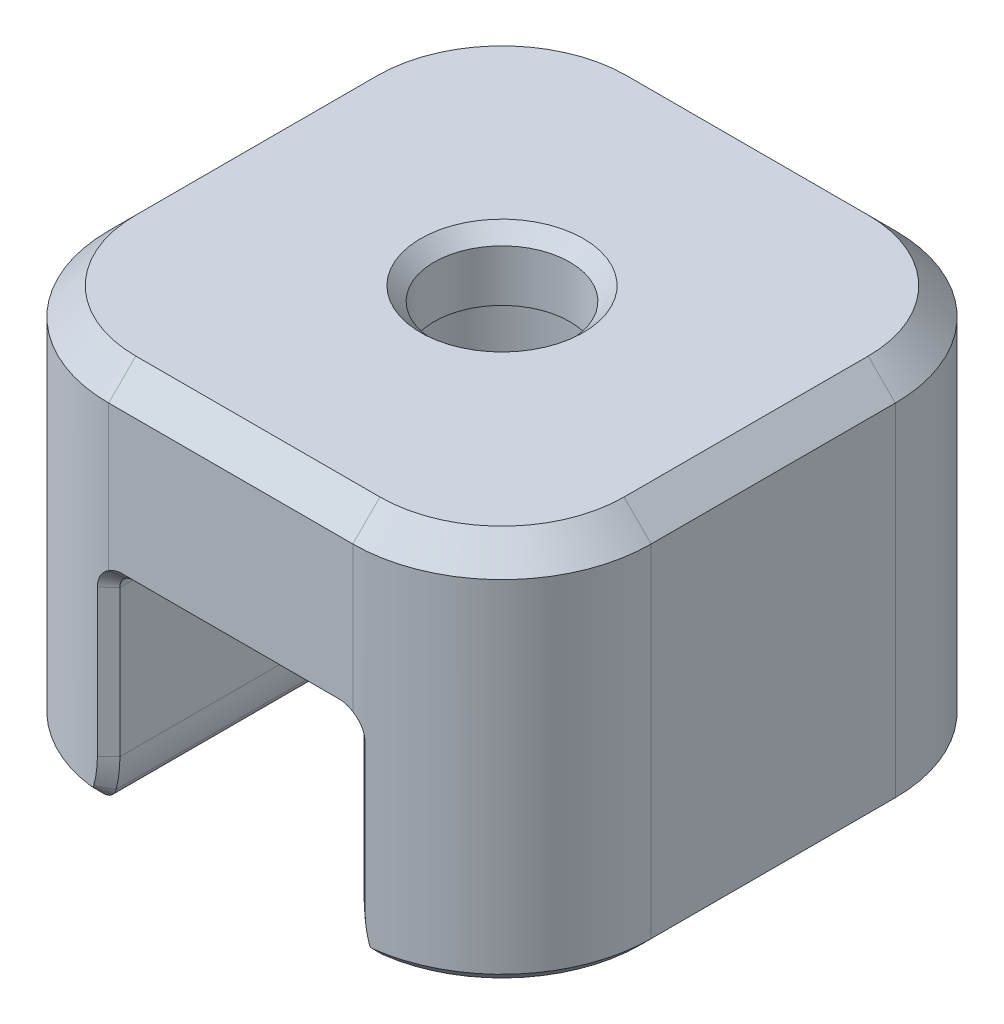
ISO-10303-21;
HEADER;
FILE_DESCRIPTION(('STEP AP214'),'2;1');
FILE_NAME('part.step','',(''),(''),'','','');
FILE_SCHEMA(('AUTOMOTIVE_DESIGN { 1 0 10303 214 1 1 1 1 }'));
ENDSEC;
DATA;
#1=APPLICATION_CONTEXT('core data for automotive mechanical design processes');
#2=APPLICATION_PROTOCOL_DEFINITION('international standard','automotive_design',2000,#1);
#3=PRODUCT_CONTEXT('',#1,'mechanical');
#4=PRODUCT('Part','Part','',(#3));
#5=PRODUCT_RELATED_PRODUCT_CATEGORY('part','',(#4));
#6=PRODUCT_DEFINITION_FORMATION('','',#4);
#7=PRODUCT_DEFINITION_CONTEXT('part definition',#1,'design');
#8=PRODUCT_DEFINITION('design','',#6,#7);
#9=PRODUCT_DEFINITION_SHAPE('','',#8);
#10=(LENGTH_UNIT() NAMED_UNIT(*) SI_UNIT(.MILLI.,.METRE.));
#11=(NAMED_UNIT(*) PLANE_ANGLE_UNIT() SI_UNIT($,.RADIAN.));
#12=(NAMED_UNIT(*) SI_UNIT($,.STERADIAN.) SOLID_ANGLE_UNIT());
#13=UNCERTAINTY_MEASURE_WITH_UNIT(LENGTH_MEASURE(1.E-05),#10,'distance_accuracy_value','');
#14=(GEOMETRIC_REPRESENTATION_CONTEXT(3) GLOBAL_UNCERTAINTY_ASSIGNED_CONTEXT((#13)) GLOBAL_UNIT_ASSIGNED_CONTEXT((#10,
#11,#12)) REPRESENTATION_CONTEXT('',''));
#15=CARTESIAN_POINT('',(0.,0.,0.));
#16=DIRECTION('',(0.,0.,1.));
#17=DIRECTION('',(1.,0.,0.));
#18=AXIS2_PLACEMENT_3D('',#15,#16,#17);
#19=CARTESIAN_POINT('',(-4.4,14.,-10.));
#20=DIRECTION('',(0.,0.,1.));
#21=DIRECTION('',(1.,0.,0.));
#22=AXIS2_PLACEMENT_3D('',#19,#20,#21);
#23=PLANE('',#22);
#24=DIRECTION('',(-1.,0.,0.));
#25=VECTOR('',#24,1.);
#26=CARTESIAN_POINT('',(-4.4,7.8,-10.));
#27=LINE('',#26,#25);
#28=CARTESIAN_POINT('',(4.,7.8,-10.));
#29=VERTEX_POINT('',#28);
#30=CARTESIAN_POINT('',(-4.,7.8,-10.));
#31=VERTEX_POINT('',#30);
#32=EDGE_CURVE('E1441',#29,#31,#27,.T.);
#33=ORIENTED_EDGE('',*,*,#32,.T.);
#34=CARTESIAN_POINT('',(-4.,6.9,-10.));
#35=DIRECTION('',(0.,0.,1.));
#36=DIRECTION('',(1.,0.,0.));
#37=AXIS2_PLACEMENT_3D('',#34,#35,#36);
#38=CIRCLE('',#37,0.900000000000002);
#39=CARTESIAN_POINT('',(-4.4,7.70622577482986,-10.));
#40=VERTEX_POINT('',#39);
#41=EDGE_CURVE('E1443',#31,#40,#38,.T.);
#42=ORIENTED_EDGE('',*,*,#41,.T.);
#43=DIRECTION('',(0.,-1.,0.));
#44=VECTOR('',#43,1.);
#45=CARTESIAN_POINT('',(-4.4,14.,-10.));
#46=LINE('',#45,#44);
#47=CARTESIAN_POINT('',(-4.4,13.,-10.));
#48=VERTEX_POINT('',#47);
#49=EDGE_CURVE('E1116',#48,#40,#46,.T.);
#50=ORIENTED_EDGE('',*,*,#49,.F.);
#51=DIRECTION('',(1.,0.,0.));
#52=VECTOR('',#51,1.);
#53=CARTESIAN_POINT('',(-4.4,13.,-10.));
#54=LINE('',#53,#52);
#55=CARTESIAN_POINT('',(4.5,13.,-10.));
#56=VERTEX_POINT('',#55);
#57=EDGE_CURVE('E322',#48,#56,#54,.T.);
#58=ORIENTED_EDGE('',*,*,#57,.T.);
#59=DIRECTION('',(0.,-1.,0.));
#60=VECTOR('',#59,1.);
#61=CARTESIAN_POINT('',(4.5,14.,-10.));
#62=LINE('',#61,#60);
#63=CARTESIAN_POINT('',(4.5,7.64833147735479,-10.));
#64=VERTEX_POINT('',#63);
#65=EDGE_CURVE('E1120',#56,#64,#62,.T.);
#66=ORIENTED_EDGE('',*,*,#65,.T.);
#67=CARTESIAN_POINT('',(4.,6.9,-10.));
#68=DIRECTION('',(0.,0.,1.));
#69=DIRECTION('',(1.,0.,0.));
#70=AXIS2_PLACEMENT_3D('',#67,#68,#69);
#71=CIRCLE('',#70,0.900000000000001);
#72=EDGE_CURVE('E1427',#64,#29,#71,.T.);
#73=ORIENTED_EDGE('',*,*,#72,.T.);
#74=EDGE_LOOP('',(#33,#42,#50,#58,#66,#73));
#75=FACE_BOUND('',#74,.T.);
#76=ADVANCED_FACE('F36',(#75),#23,.F.);
#77=CARTESIAN_POINT('',(-4.4,0.,-4.4));
#78=DIRECTION('',(0.,-1.,0.));
#79=DIRECTION('',(0.,0.,-1.));
#80=AXIS2_PLACEMENT_3D('',#77,#78,#79);
#81=PLANE('',#80);
#82=DIRECTION('',(0.,0.,1.));
#83=VECTOR('',#82,1.);
#84=CARTESIAN_POINT('',(9.6,0.,4.5));
#85=LINE('',#84,#83);
#86=CARTESIAN_POINT('',(9.6,0.,-4.5));
#87=VERTEX_POINT('',#86);
#88=CARTESIAN_POINT('',(9.6,0.,4.5));
#89=VERTEX_POINT('',#88);
#90=EDGE_CURVE('E56',#87,#89,#85,.T.);
#91=ORIENTED_EDGE('',*,*,#90,.T.);
#92=CARTESIAN_POINT('',(4.5,0.,4.5));
#93=DIRECTION('',(0.,-1.,0.));
#94=DIRECTION('',(0.,0.,-1.));
#95=AXIS2_PLACEMENT_3D('',#92,#93,#94);
#96=CIRCLE('',#95,5.1);
#97=CARTESIAN_POINT('',(5.13769737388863,0.,9.55997451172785));
#98=VERTEX_POINT('',#97);
#99=EDGE_CURVE('E48',#89,#98,#96,.T.);
#100=ORIENTED_EDGE('',*,*,#99,.T.);
#101=DIRECTION('',(0.,0.,1.));
#102=VECTOR('',#101,1.);
#103=CARTESIAN_POINT('',(5.13769737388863,0.,-10.));
#104=LINE('',#103,#102);
#105=CARTESIAN_POINT('',(5.13769737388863,0.,-9.55997451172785));
#106=VERTEX_POINT('',#105);
#107=EDGE_CURVE('E294',#98,#106,#104,.F.);
#108=ORIENTED_EDGE('',*,*,#107,.T.);
#109=CARTESIAN_POINT('',(4.5,0.,-4.5));
#110=DIRECTION('',(0.,-1.,0.));
#111=DIRECTION('',(0.,0.,-1.));
#112=AXIS2_PLACEMENT_3D('',#109,#110,#111);
#113=CIRCLE('',#112,5.1);
#114=EDGE_CURVE('E61',#106,#87,#113,.T.);
#115=ORIENTED_EDGE('',*,*,#114,.T.);
#116=EDGE_LOOP('',(#91,#100,#108,#115));
#117=FACE_BOUND('',#116,.T.);
#118=ADVANCED_FACE('F1144',(#117),#81,.T.);
#119=CARTESIAN_POINT('',(-4.4,14.,-4.4));
#120=DIRECTION('',(0.,-1.,0.));
#121=DIRECTION('',(0.,0.,-1.));
#122=AXIS2_PLACEMENT_3D('',#119,#120,#121);
#123=CYLINDRICAL_SURFACE('',#122,5.6);
#124=CARTESIAN_POINT('',(-5.19444332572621,0.400000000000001,-9.94336177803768));
#125=CARTESIAN_POINT('',(-5.18859932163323,0.400000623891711,-9.94419930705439));
#126=CARTESIAN_POINT('',(-5.18281834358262,0.400439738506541,-9.94501835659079));
#127=CARTESIAN_POINT('',(-5.17425297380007,0.401736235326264,-9.94621859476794));
#128=CARTESIAN_POINT('',(-5.17140905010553,0.402277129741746,-9.94661483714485));
#129=CARTESIAN_POINT('',(-5.16576491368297,0.403572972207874,-9.94739689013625));
#130=CARTESIAN_POINT('',(-5.16294419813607,0.404334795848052,-9.94778549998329));
#131=CARTESIAN_POINT('',(-5.15742264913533,0.406055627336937,-9.94854202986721));
#132=CARTESIAN_POINT('',(-5.15471257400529,0.407015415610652,-9.94891125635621));
#133=CARTESIAN_POINT('',(-5.14939428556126,0.4091299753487,-9.949632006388));
#134=CARTESIAN_POINT('',(-5.14678565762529,0.410284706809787,-9.94998358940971));
#135=CARTESIAN_POINT('',(-5.14166938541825,0.412788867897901,-9.95066961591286));
#136=CARTESIAN_POINT('',(-5.13916027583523,0.414139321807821,-9.95100425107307));
#137=CARTESIAN_POINT('',(-5.13425082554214,0.417034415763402,-9.95165577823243));
#138=CARTESIAN_POINT('',(-5.13183614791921,0.418589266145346,-9.9519745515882));
#139=CARTESIAN_POINT('',(-5.12716429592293,0.421869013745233,-9.95258837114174));
#140=CARTESIAN_POINT('',(-5.12491664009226,0.423585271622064,-9.95288219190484));
#141=CARTESIAN_POINT('',(-5.12058366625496,0.427174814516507,-9.95344613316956));
#142=CARTESIAN_POINT('',(-5.11849995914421,0.429046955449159,-9.95371604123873));
#143=CARTESIAN_POINT('',(-5.11249736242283,0.434893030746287,-9.95449041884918));
#144=CARTESIAN_POINT('',(-5.10881748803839,0.439105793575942,-9.95496075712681));
#145=CARTESIAN_POINT('',(-5.10217881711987,0.448136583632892,-9.95580381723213));
#146=CARTESIAN_POINT('',(-5.09930477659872,0.452833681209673,-9.95616584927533));
#147=CARTESIAN_POINT('',(-5.09439004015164,0.462616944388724,-9.95678221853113));
#148=CARTESIAN_POINT('',(-5.0923545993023,0.467696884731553,-9.95703586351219));
#149=CARTESIAN_POINT('',(-5.09075884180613,0.472972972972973,-9.95723422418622));
#150=B_SPLINE_CURVE_WITH_KNOTS('',3,(#124,#125,#126,#127,#128,#129,#130,#131,#132,#133,#134,
#135,#136,#137,#138,#139,#140,#141,#142,#143,#144,#145,#146,#147,#148,#149),.UNSPECIFIED.,.F.,
.F.,(4,2,2,2,2,2,2,2,2,2,2,2,4),(0.,1.62155261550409E-05,2.43232892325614E-05,
3.24310523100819E-05,4.05388153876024E-05,4.86465784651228E-05,5.67543415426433E-05,
6.48621046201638E-05,7.29698676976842E-05,8.10776307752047E-05,9.72931569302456E-05,
0.000113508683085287,0.000129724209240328),.UNSPECIFIED.);
#151=CARTESIAN_POINT('',(-5.09075884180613,0.472972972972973,-9.95723422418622));
#152=VERTEX_POINT('',#151);
#153=CARTESIAN_POINT('',(-5.19444332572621,0.400000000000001,-9.94336177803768));
#154=VERTEX_POINT('',#153);
#155=EDGE_CURVE('E1165',#152,#154,#150,.F.);
#156=ORIENTED_EDGE('',*,*,#155,.T.);
#157=CARTESIAN_POINT('',(-4.4,0.400000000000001,-4.4));
#158=DIRECTION('',(0.,-1.,0.));
#159=DIRECTION('',(0.,0.,-1.));
#160=AXIS2_PLACEMENT_3D('',#157,#158,#159);
#161=CIRCLE('',#160,5.6);
#162=CARTESIAN_POINT('',(-10.,0.400000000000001,-4.4));
#163=VERTEX_POINT('',#162);
#164=EDGE_CURVE('E1167',#154,#163,#161,.F.);
#165=ORIENTED_EDGE('',*,*,#164,.T.);
#166=DIRECTION('',(0.,-1.,0.));
#167=VECTOR('',#166,1.);
#168=CARTESIAN_POINT('',(-10.,14.,-4.4));
#169=LINE('',#168,#167);
#170=CARTESIAN_POINT('',(-10.,13.,-4.4));
#171=VERTEX_POINT('',#170);
#172=EDGE_CURVE('E339',#171,#163,#169,.T.);
#173=ORIENTED_EDGE('',*,*,#172,.F.);
#174=CARTESIAN_POINT('',(-4.4,13.,-4.4));
#175=DIRECTION('',(0.,-1.,0.));
#176=DIRECTION('',(0.,0.,-1.));
#177=AXIS2_PLACEMENT_3D('',#174,#175,#176);
#178=CIRCLE('',#177,5.6);
#179=EDGE_CURVE('E1633',#171,#48,#178,.T.);
#180=ORIENTED_EDGE('',*,*,#179,.T.);
#181=ORIENTED_EDGE('',*,*,#49,.T.);
#182=CARTESIAN_POINT('',(-4.93846153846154,6.9,-9.97405231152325));
#183=CARTESIAN_POINT('',(-4.93846133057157,6.92100852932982,-9.97405229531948));
#184=CARTESIAN_POINT('',(-4.9376694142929,6.94198208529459,-9.97412899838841));
#185=CARTESIAN_POINT('',(-4.93451147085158,6.98384747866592,-9.97443270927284));
#186=CARTESIAN_POINT('',(-4.93213645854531,7.00476821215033,-9.974660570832));
#187=CARTESIAN_POINT('',(-4.9227269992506,7.06680688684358,-9.97555348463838));
#188=CARTESIAN_POINT('',(-4.91343604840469,7.10737154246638,-9.97642674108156));
#189=CARTESIAN_POINT('',(-4.89506583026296,7.16709086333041,-9.97807738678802));
#190=CARTESIAN_POINT('',(-4.88820208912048,7.18680687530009,-9.97868417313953));
#191=CARTESIAN_POINT('',(-4.87298017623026,7.22585487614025,-9.97999534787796));
#192=CARTESIAN_POINT('',(-4.86462627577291,7.24517665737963,-9.98069941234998));
#193=CARTESIAN_POINT('',(-4.84637219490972,7.28346853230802,-9.98218918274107));
#194=CARTESIAN_POINT('',(-4.83648482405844,7.30238760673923,-9.98297340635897));
#195=CARTESIAN_POINT('',(-4.815503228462,7.33921783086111,-9.98457405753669));
#196=CARTESIAN_POINT('',(-4.80435682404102,7.35724086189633,-9.98539478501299));
#197=CARTESIAN_POINT('',(-4.78080773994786,7.39244862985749,-9.98704973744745));
#198=CARTESIAN_POINT('',(-4.76839956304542,7.40964490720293,-9.98788444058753));
#199=CARTESIAN_POINT('',(-4.74231944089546,7.44322554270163,-9.98954274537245));
#200=CARTESIAN_POINT('',(-4.72864751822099,7.45960991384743,-9.99036638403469));
#201=CARTESIAN_POINT('',(-4.70002494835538,7.49155822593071,-9.99197554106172));
#202=CARTESIAN_POINT('',(-4.68508820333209,7.5071085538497,-9.9927604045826));
#203=CARTESIAN_POINT('',(-4.65384638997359,7.53742256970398,-9.99426554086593));
#204=CARTESIAN_POINT('',(-4.63767806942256,7.55204978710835,-9.9949787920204));
#205=CARTESIAN_POINT('',(-4.58789994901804,7.59404392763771,-9.99694479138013));
#206=CARTESIAN_POINT('',(-4.55286237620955,7.61973168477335,-9.99803463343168));
#207=CARTESIAN_POINT('',(-4.47918424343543,7.66647721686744,-9.99956128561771));
#208=CARTESIAN_POINT('',(-4.44053444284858,7.68754798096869,-9.99999968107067));
#209=CARTESIAN_POINT('',(-4.4,7.70622577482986,-10.));
#210=B_SPLINE_CURVE_WITH_KNOTS('',3,(#182,#183,#184,#185,#186,#187,#188,#189,#190,#191,#192,
#193,#194,#195,#196,#197,#198,#199,#200,#201,#202,#203,#204,#205,#206,#207,#208,#209),
.UNSPECIFIED.,.F.,.F.,(4,2,2,2,2,2,2,2,2,2,2,2,2,4),(0.,6.21272275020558E-05,
0.000124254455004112,0.000248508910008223,0.000310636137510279,0.000372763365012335,
0.00043489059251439,0.000497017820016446,0.000559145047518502,0.000621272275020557,
0.000683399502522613,0.000745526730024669,0.00086978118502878,0.000994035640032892),.UNSPECIFIED.);
#211=CARTESIAN_POINT('',(-4.93846153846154,6.9,-9.97405231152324));
#212=VERTEX_POINT('',#211);
#213=EDGE_CURVE('E1126',#40,#212,#210,.F.);
#214=ORIENTED_EDGE('',*,*,#213,.T.);
#215=DIRECTION('',(0.,-1.,0.));
#216=VECTOR('',#215,1.);
#217=CARTESIAN_POINT('',(-4.93846153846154,14.,-9.97405231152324));
#218=LINE('',#217,#216);
#219=CARTESIAN_POINT('',(-4.93846153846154,1.5,-9.97405231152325));
#220=VERTEX_POINT('',#219);
#221=EDGE_CURVE('E1131',#212,#220,#218,.T.);
#222=ORIENTED_EDGE('',*,*,#221,.T.);
#223=CARTESIAN_POINT('',(-5.09075884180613,0.472972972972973,-9.95723422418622));
#224=CARTESIAN_POINT('',(-5.04002048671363,0.640852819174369,-9.96353076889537));
#225=CARTESIAN_POINT('',(-5.00211035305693,0.810404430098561,-9.96759458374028));
#226=CARTESIAN_POINT('',(-4.95133777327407,1.15275082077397,-9.97285232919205));
#227=CARTESIAN_POINT('',(-4.93847471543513,1.32554558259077,-9.97404175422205));
#228=CARTESIAN_POINT('',(-4.93846153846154,1.5,-9.97405231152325));
#229=B_SPLINE_CURVE_WITH_KNOTS('',3,(#223,#224,#225,#226,#227,#228),.UNSPECIFIED.,.F.,.F.,(4,2,
4),(0.,0.00051841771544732,0.00103683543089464),.UNSPECIFIED.);
#230=EDGE_CURVE('E1169',#220,#152,#229,.F.);
#231=ORIENTED_EDGE('',*,*,#230,.T.);
#232=EDGE_LOOP('',(#156,#165,#173,#180,#181,#214,#222,#231));
#233=FACE_BOUND('',#232,.T.);
#234=ADVANCED_FACE('F1133',(#233),#123,.T.);
#235=CARTESIAN_POINT('',(-10.,14.,-4.4));
#236=DIRECTION('',(1.,0.,0.));
#237=DIRECTION('',(0.,0.,-1.));
#238=AXIS2_PLACEMENT_3D('',#235,#236,#237);
#239=PLANE('',#238);
#240=ORIENTED_EDGE('',*,*,#172,.T.);
#241=DIRECTION('',(0.,0.,1.));
#242=VECTOR('',#241,1.);
#243=CARTESIAN_POINT('',(-10.,0.400000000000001,4.5));
#244=LINE('',#243,#242);
#245=CARTESIAN_POINT('',(-10.,0.400000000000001,4.5));
#246=VERTEX_POINT('',#245);
#247=EDGE_CURVE('E331',#163,#246,#244,.T.);
#248=ORIENTED_EDGE('',*,*,#247,.T.);
#249=DIRECTION('',(0.,-1.,0.));
#250=VECTOR('',#249,1.);
#251=CARTESIAN_POINT('',(-10.,14.,4.5));
#252=LINE('',#251,#250);
#253=CARTESIAN_POINT('',(-10.,13.,4.5));
#254=VERTEX_POINT('',#253);
#255=EDGE_CURVE('E1190',#254,#246,#252,.T.);
#256=ORIENTED_EDGE('',*,*,#255,.F.);
#257=DIRECTION('',(0.,0.,-1.));
#258=VECTOR('',#257,1.);
#259=CARTESIAN_POINT('',(-10.,13.,-4.4));
#260=LINE('',#259,#258);
#261=EDGE_CURVE('E1653',#254,#171,#260,.T.);
#262=ORIENTED_EDGE('',*,*,#261,.T.);
#263=EDGE_LOOP('',(#240,#248,#256,#262));
#264=FACE_BOUND('',#263,.T.);
#265=ADVANCED_FACE('F1143',(#264),#239,.F.);
#266=CARTESIAN_POINT('',(-4.5,14.,4.5));
#267=DIRECTION('',(0.,-1.,0.));
#268=DIRECTION('',(0.,0.,-1.));
#269=AXIS2_PLACEMENT_3D('',#266,#267,#268);
#270=CYLINDRICAL_SURFACE('',#269,5.5);
#271=ORIENTED_EDGE('',*,*,#255,.T.);
#272=CARTESIAN_POINT('',(-4.5,0.400000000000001,4.5));
#273=DIRECTION('',(0.,-1.,0.));
#274=DIRECTION('',(0.,0.,-1.));
#275=AXIS2_PLACEMENT_3D('',#272,#273,#274);
#276=CIRCLE('',#275,5.5);
#277=CARTESIAN_POINT('',(-5.18771285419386,0.400000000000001,9.95683525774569));
#278=VERTEX_POINT('',#277);
#279=EDGE_CURVE('E1183',#246,#278,#276,.F.);
#280=ORIENTED_EDGE('',*,*,#279,.T.);
#281=CARTESIAN_POINT('',(-5.0838831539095,0.472972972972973,9.96891949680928));
#282=CARTESIAN_POINT('',(-5.08547933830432,0.467702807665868,9.96874907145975));
#283=CARTESIAN_POINT('',(-5.08752177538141,0.462611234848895,9.96853035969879));
#284=CARTESIAN_POINT('',(-5.09122479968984,0.455251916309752,9.96813083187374));
#285=CARTESIAN_POINT('',(-5.09257074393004,0.452839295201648,9.96798519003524));
#286=CARTESIAN_POINT('',(-5.0954781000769,0.448109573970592,9.96766933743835));
#287=CARTESIAN_POINT('',(-5.09704773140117,0.445783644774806,9.96749821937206));
#288=CARTESIAN_POINT('',(-5.10035045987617,0.441306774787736,9.96713655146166));
#289=CARTESIAN_POINT('',(-5.10209326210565,0.439139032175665,9.96694495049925));
#290=CARTESIAN_POINT('',(-5.10575198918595,0.434951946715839,9.966540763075));
#291=CARTESIAN_POINT('',(-5.10766890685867,0.432930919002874,9.96632806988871));
#292=CARTESIAN_POINT('',(-5.11167749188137,0.429033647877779,9.96588096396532));
#293=CARTESIAN_POINT('',(-5.1137710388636,0.427156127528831,9.96564633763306));
#294=CARTESIAN_POINT('',(-5.11812843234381,0.423553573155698,9.96515526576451));
#295=CARTESIAN_POINT('',(-5.12041063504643,0.421816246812,9.96489672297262));
#296=CARTESIAN_POINT('',(-5.12508169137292,0.418547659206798,9.96436440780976));
#297=CARTESIAN_POINT('',(-5.12747485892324,0.417010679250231,9.96409016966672));
#298=CARTESIAN_POINT('',(-5.13237403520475,0.4141274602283,9.96352534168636));
#299=CARTESIAN_POINT('',(-5.13487996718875,0.412781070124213,9.96323476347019));
#300=CARTESIAN_POINT('',(-5.14000383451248,0.410277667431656,9.96263688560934));
#301=CARTESIAN_POINT('',(-5.14262293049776,0.409120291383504,9.9623294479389));
#302=CARTESIAN_POINT('',(-5.14796999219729,0.406999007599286,9.96169773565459));
#303=CARTESIAN_POINT('',(-5.15071050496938,0.406031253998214,9.961371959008));
#304=CARTESIAN_POINT('',(-5.15626594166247,0.404307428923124,9.96070717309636));
#305=CARTESIAN_POINT('',(-5.15905774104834,0.403557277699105,9.96037095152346));
#306=CARTESIAN_POINT('',(-5.16468541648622,0.402269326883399,9.95968875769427));
#307=CARTESIAN_POINT('',(-5.16751845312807,0.401732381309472,9.95934312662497));
#308=CARTESIAN_POINT('',(-5.17607458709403,0.400439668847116,9.95829242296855));
#309=CARTESIAN_POINT('',(-5.18185445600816,0.400000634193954,9.95757357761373));
#310=CARTESIAN_POINT('',(-5.18771285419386,0.400000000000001,9.95683525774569));
#311=B_SPLINE_CURVE_WITH_KNOTS('',3,(#281,#282,#283,#284,#285,#286,#287,#288,#289,#290,#291,
#292,#293,#294,#295,#296,#297,#298,#299,#300,#301,#302,#303,#304,#305,#306,#307,#308,#309,#310),
.UNSPECIFIED.,.F.,.F.,(4,2,2,2,2,2,2,2,2,2,2,2,2,2,4),(0.,1.61941344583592E-05,
2.42912016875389E-05,3.23882689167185E-05,4.04853361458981E-05,4.85824033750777E-05,
5.66794706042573E-05,6.4776537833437E-05,7.28736050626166E-05,8.09706722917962E-05,
8.90677395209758E-05,9.71648067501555E-05,0.000105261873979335,0.000113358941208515,
0.000129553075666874),.UNSPECIFIED.);
#312=CARTESIAN_POINT('',(-5.0838831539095,0.472972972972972,9.96891949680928));
#313=VERTEX_POINT('',#312);
#314=EDGE_CURVE('E1187',#278,#313,#311,.F.);
#315=ORIENTED_EDGE('',*,*,#314,.T.);
#316=CARTESIAN_POINT('',(-4.93137254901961,1.5,9.98305733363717));
#317=CARTESIAN_POINT('',(-4.93138574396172,1.32555724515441,9.98304686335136));
#318=CARTESIAN_POINT('',(-4.9442650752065,1.15276850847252,9.982087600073));
#319=CARTESIAN_POINT('',(-4.9951069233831,0.810422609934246,9.9777290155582));
#320=CARTESIAN_POINT('',(-5.03306993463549,0.640865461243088,9.97433419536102));
#321=CARTESIAN_POINT('',(-5.0838831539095,0.472972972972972,9.96891949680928));
#322=B_SPLINE_CURVE_WITH_KNOTS('',3,(#316,#317,#318,#319,#320,#321),.UNSPECIFIED.,.F.,.F.,(4,2,
4),(0.,0.000518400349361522,0.00103680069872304),.UNSPECIFIED.);
#323=CARTESIAN_POINT('',(-4.93137254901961,1.5,9.98305733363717));
#324=VERTEX_POINT('',#323);
#325=EDGE_CURVE('E1241',#313,#324,#322,.F.);
#326=ORIENTED_EDGE('',*,*,#325,.T.);
#327=DIRECTION('',(0.,-1.,0.));
#328=VECTOR('',#327,1.);
#329=CARTESIAN_POINT('',(-4.9313725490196,14.,9.98305733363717));
#330=LINE('',#329,#328);
#331=CARTESIAN_POINT('',(-4.93137254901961,6.9,9.98305733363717));
#332=VERTEX_POINT('',#331);
#333=EDGE_CURVE('E1213',#324,#332,#330,.F.);
#334=ORIENTED_EDGE('',*,*,#333,.T.);
#335=CARTESIAN_POINT('',(-4.5,7.64833147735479,10.));
#336=CARTESIAN_POINT('',(-4.56666861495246,7.60699048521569,9.99999684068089));
#337=CARTESIAN_POINT('',(-4.62653598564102,7.55898132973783,9.99880099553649));
#338=CARTESIAN_POINT('',(-4.69311059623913,7.49094654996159,9.99662530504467));
#339=CARTESIAN_POINT('',(-4.70600816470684,7.47690889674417,9.99615462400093));
#340=CARTESIAN_POINT('',(-4.73093713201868,7.4480375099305,9.99516371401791));
#341=CARTESIAN_POINT('',(-4.74301543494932,7.43312560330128,9.99464067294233));
#342=CARTESIAN_POINT('',(-4.76596436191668,7.4028882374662,9.99357754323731));
#343=CARTESIAN_POINT('',(-4.77689943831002,7.38749355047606,9.99303512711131));
#344=CARTESIAN_POINT('',(-4.79767730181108,7.35619963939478,9.99194833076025));
#345=CARTESIAN_POINT('',(-4.80752588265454,7.34029411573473,9.99140370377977));
#346=CARTESIAN_POINT('',(-4.835464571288,7.29180784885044,9.98979161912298));
#347=CARTESIAN_POINT('',(-4.85195740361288,7.2584316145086,9.98874582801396));
#348=CARTESIAN_POINT('',(-4.88057845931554,7.18970732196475,9.98683576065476));
#349=CARTESIAN_POINT('',(-4.89276342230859,7.15402458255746,9.98596677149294));
#350=CARTESIAN_POINT('',(-4.91201321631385,7.08257582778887,9.98455439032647));
#351=CARTESIAN_POINT('',(-4.91924780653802,7.04647436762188,9.98399988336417));
#352=CARTESIAN_POINT('',(-4.92891945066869,6.97370909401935,9.98325192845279));
#353=CARTESIAN_POINT('',(-4.9313705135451,6.93701468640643,9.98305715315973));
#354=CARTESIAN_POINT('',(-4.93137254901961,6.9,9.98305733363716));
#355=B_SPLINE_CURVE_WITH_KNOTS('',3,(#335,#336,#337,#338,#339,#340,#341,#342,#343,#344,#345,
#346,#347,#348,#349,#350,#351,#352,#353,#354),.UNSPECIFIED.,.F.,.F.,(4,2,2,2,2,2,2,2,2,4),(0.,
0.000219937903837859,0.000274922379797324,0.000329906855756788,0.000384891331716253,
0.000439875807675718,0.000549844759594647,0.000659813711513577,0.000769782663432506,
0.000879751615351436),.UNSPECIFIED.);
#356=CARTESIAN_POINT('',(-4.5,7.64833147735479,10.));
#357=VERTEX_POINT('',#356);
#358=EDGE_CURVE('E1170',#332,#357,#355,.F.);
#359=ORIENTED_EDGE('',*,*,#358,.T.);
#360=DIRECTION('',(0.,-1.,0.));
#361=VECTOR('',#360,1.);
#362=CARTESIAN_POINT('',(-4.5,14.,10.));
#363=LINE('',#362,#361);
#364=CARTESIAN_POINT('',(-4.5,13.,10.));
#365=VERTEX_POINT('',#364);
#366=EDGE_CURVE('E1196',#365,#357,#363,.T.);
#367=ORIENTED_EDGE('',*,*,#366,.F.);
#368=CARTESIAN_POINT('',(-4.5,13.,4.5));
#369=DIRECTION('',(0.,-1.,0.));
#370=DIRECTION('',(0.,0.,-1.));
#371=AXIS2_PLACEMENT_3D('',#368,#369,#370);
#372=CIRCLE('',#371,5.5);
#373=EDGE_CURVE('E1195',#365,#254,#372,.T.);
#374=ORIENTED_EDGE('',*,*,#373,.T.);
#375=EDGE_LOOP('',(#271,#280,#315,#326,#334,#359,#367,#374));
#376=FACE_BOUND('',#375,.T.);
#377=ADVANCED_FACE('F1192',(#376),#270,.T.);
#378=CARTESIAN_POINT('',(-4.5,14.,10.));
#379=DIRECTION('',(0.,0.,-1.));
#380=DIRECTION('',(-1.,0.,0.));
#381=AXIS2_PLACEMENT_3D('',#378,#379,#380);
#382=PLANE('',#381);
#383=ORIENTED_EDGE('',*,*,#366,.T.);
#384=CARTESIAN_POINT('',(-4.,6.9,10.));
#385=DIRECTION('',(0.,0.,-1.));
#386=DIRECTION('',(-1.,0.,0.));
#387=AXIS2_PLACEMENT_3D('',#384,#385,#386);
#388=CIRCLE('',#387,0.900000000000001);
#389=CARTESIAN_POINT('',(-4.,7.8,10.));
#390=VERTEX_POINT('',#389);
#391=EDGE_CURVE('E1338',#357,#390,#388,.T.);
#392=ORIENTED_EDGE('',*,*,#391,.T.);
#393=DIRECTION('',(1.,0.,0.));
#394=VECTOR('',#393,1.);
#395=CARTESIAN_POINT('',(-4.5,7.8,10.));
#396=LINE('',#395,#394);
#397=CARTESIAN_POINT('',(4.,7.8,10.));
#398=VERTEX_POINT('',#397);
#399=EDGE_CURVE('E1445',#390,#398,#396,.T.);
#400=ORIENTED_EDGE('',*,*,#399,.T.);
#401=CARTESIAN_POINT('',(4.,6.9,10.));
#402=DIRECTION('',(0.,0.,-1.));
#403=DIRECTION('',(-1.,0.,0.));
#404=AXIS2_PLACEMENT_3D('',#401,#402,#403);
#405=CIRCLE('',#404,0.899999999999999);
#406=CARTESIAN_POINT('',(4.5,7.64833147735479,10.));
#407=VERTEX_POINT('',#406);
#408=EDGE_CURVE('E1344',#398,#407,#405,.T.);
#409=ORIENTED_EDGE('',*,*,#408,.T.);
#410=DIRECTION('',(0.,-1.,0.));
#411=VECTOR('',#410,1.);
#412=CARTESIAN_POINT('',(4.5,14.,10.));
#413=LINE('',#412,#411);
#414=CARTESIAN_POINT('',(4.5,13.,10.));
#415=VERTEX_POINT('',#414);
#416=EDGE_CURVE('E1198',#415,#407,#413,.T.);
#417=ORIENTED_EDGE('',*,*,#416,.F.);
#418=DIRECTION('',(-1.,0.,0.));
#419=VECTOR('',#418,1.);
#420=CARTESIAN_POINT('',(-4.5,13.,10.));
#421=LINE('',#420,#419);
#422=EDGE_CURVE('E1650',#415,#365,#421,.T.);
#423=ORIENTED_EDGE('',*,*,#422,.T.);
#424=EDGE_LOOP('',(#383,#392,#400,#409,#417,#423));
#425=FACE_BOUND('',#424,.T.);
#426=ADVANCED_FACE('F1223',(#425),#382,.F.);
#427=CARTESIAN_POINT('',(4.5,14.,4.5));
#428=DIRECTION('',(0.,-1.,0.));
#429=DIRECTION('',(0.,0.,-1.));
#430=AXIS2_PLACEMENT_3D('',#427,#428,#429);
#431=CYLINDRICAL_SURFACE('',#430,5.5);
#432=ORIENTED_EDGE('',*,*,#416,.T.);
#433=CARTESIAN_POINT('',(4.93137254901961,6.9,9.98305733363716));
#434=CARTESIAN_POINT('',(4.93134060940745,6.97436676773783,9.98305448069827));
#435=CARTESIAN_POINT('',(4.92155061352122,7.04720226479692,9.98385454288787));
#436=CARTESIAN_POINT('',(4.89752719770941,7.13633620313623,9.98561726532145));
#437=CARTESIAN_POINT('',(4.892104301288,7.15408057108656,9.98600860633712));
#438=CARTESIAN_POINT('',(4.88006331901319,7.18934354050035,9.98685597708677));
#439=CARTESIAN_POINT('',(4.87340108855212,7.20694197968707,9.98731479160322));
#440=CARTESIAN_POINT('',(4.85903494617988,7.24143673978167,9.98827345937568));
#441=CARTESIAN_POINT('',(4.85130477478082,7.25842122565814,9.9887752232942));
#442=CARTESIAN_POINT('',(4.83478541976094,7.29182764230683,9.98980757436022));
#443=CARTESIAN_POINT('',(4.82599381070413,7.30825753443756,9.99033835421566));
#444=CARTESIAN_POINT('',(4.79803654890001,7.35673477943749,9.99195071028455));
#445=CARTESIAN_POINT('',(4.77727073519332,7.38799163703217,9.99305369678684));
#446=CARTESIAN_POINT('',(4.73154860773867,7.44823356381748,9.99517195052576));
#447=CARTESIAN_POINT('',(4.70632348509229,7.47744876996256,9.99619401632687));
#448=CARTESIAN_POINT('',(4.6529534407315,7.53197969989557,9.99793714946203));
#449=CARTESIAN_POINT('',(4.62460276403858,7.55761181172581,9.99866993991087));
#450=CARTESIAN_POINT('',(4.56473082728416,7.60549110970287,9.99970052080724));
#451=CARTESIAN_POINT('',(4.53319001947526,7.6277659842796,9.99999978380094));
#452=CARTESIAN_POINT('',(4.50000000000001,7.64833147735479,10.));
#453=B_SPLINE_CURVE_WITH_KNOTS('',3,(#433,#434,#435,#436,#437,#438,#439,#440,#441,#442,#443,
#444,#445,#446,#447,#448,#449,#450,#451,#452),.UNSPECIFIED.,.F.,.F.,(4,2,2,2,2,2,2,2,2,4),(0.,
0.000219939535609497,0.000274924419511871,0.000329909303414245,0.00038489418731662,
0.000439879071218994,0.000549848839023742,0.000659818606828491,0.000769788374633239,
0.000879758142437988),.UNSPECIFIED.);
#454=CARTESIAN_POINT('',(4.9313725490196,6.9,9.98305733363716));
#455=VERTEX_POINT('',#454);
#456=EDGE_CURVE('E1402',#407,#455,#453,.F.);
#457=ORIENTED_EDGE('',*,*,#456,.T.);
#458=DIRECTION('',(0.,-1.,0.));
#459=VECTOR('',#458,1.);
#460=CARTESIAN_POINT('',(4.9313725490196,14.,9.98305733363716));
#461=LINE('',#460,#459);
#462=CARTESIAN_POINT('',(4.93137254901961,1.5,9.98305733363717));
#463=VERTEX_POINT('',#462);
#464=EDGE_CURVE('E1554',#455,#463,#461,.T.);
#465=ORIENTED_EDGE('',*,*,#464,.T.);
#466=CARTESIAN_POINT('',(5.0838831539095,0.472972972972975,9.96891949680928));
#467=CARTESIAN_POINT('',(5.03306993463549,0.640865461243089,9.97433419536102));
#468=CARTESIAN_POINT('',(4.9951069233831,0.81042260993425,9.9777290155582));
#469=CARTESIAN_POINT('',(4.94426507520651,1.15276850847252,9.982087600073));
#470=CARTESIAN_POINT('',(4.93138574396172,1.32555724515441,9.98304686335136));
#471=CARTESIAN_POINT('',(4.93137254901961,1.5,9.98305733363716));
#472=B_SPLINE_CURVE_WITH_KNOTS('',3,(#466,#467,#468,#469,#470,#471),.UNSPECIFIED.,.F.,.F.,(4,2,
4),(0.,0.000518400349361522,0.00103680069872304),.UNSPECIFIED.);
#473=CARTESIAN_POINT('',(5.0838831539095,0.472972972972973,9.96891949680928));
#474=VERTEX_POINT('',#473);
#475=EDGE_CURVE('E1561',#463,#474,#472,.F.);
#476=ORIENTED_EDGE('',*,*,#475,.T.);
#477=CARTESIAN_POINT('',(5.18771285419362,0.400000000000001,9.95683525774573));
#478=CARTESIAN_POINT('',(5.18185469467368,0.40000062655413,9.95757354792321));
#479=CARTESIAN_POINT('',(5.17605978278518,0.400440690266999,9.95829426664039));
#480=CARTESIAN_POINT('',(5.16747467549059,0.4017396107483,9.95934848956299));
#481=CARTESIAN_POINT('',(5.16462413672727,0.402281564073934,9.95969622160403));
#482=CARTESIAN_POINT('',(5.158966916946,0.403579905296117,9.9603819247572));
#483=CARTESIAN_POINT('',(5.15613992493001,0.404343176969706,9.96072231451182));
#484=CARTESIAN_POINT('',(5.15060893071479,0.40606626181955,9.96138404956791));
#485=CARTESIAN_POINT('',(5.14789388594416,0.407027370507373,9.961706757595));
#486=CARTESIAN_POINT('',(5.14256658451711,0.409144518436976,9.96233607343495));
#487=CARTESIAN_POINT('',(5.13995367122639,0.410300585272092,9.96264276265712));
#488=CARTESIAN_POINT('',(5.13482924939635,0.412807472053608,9.96324065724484));
#489=CARTESIAN_POINT('',(5.13231618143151,0.414159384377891,9.96353203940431));
#490=CARTESIAN_POINT('',(5.12739960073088,0.417057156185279,9.96409881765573));
#491=CARTESIAN_POINT('',(5.12498099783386,0.418613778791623,9.96437593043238));
#492=CARTESIAN_POINT('',(5.12030501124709,0.421894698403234,9.96490871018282));
#493=CARTESIAN_POINT('',(5.11805518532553,0.42361163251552,9.965163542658));
#494=CARTESIAN_POINT('',(5.11371867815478,0.427201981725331,9.96565221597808));
#495=CARTESIAN_POINT('',(5.11163354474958,0.429074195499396,9.96588588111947));
#496=CARTESIAN_POINT('',(5.10762888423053,0.432972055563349,9.96633251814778));
#497=CARTESIAN_POINT('',(5.10570894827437,0.434998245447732,9.96654553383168));
#498=CARTESIAN_POINT('',(5.10203893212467,0.43920424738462,9.96695093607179));
#499=CARTESIAN_POINT('',(5.10028348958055,0.44139135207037,9.96714390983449));
#500=CARTESIAN_POINT('',(5.09696543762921,0.445901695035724,9.96750720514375));
#501=CARTESIAN_POINT('',(5.09541875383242,0.448201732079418,9.96767579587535));
#502=CARTESIAN_POINT('',(5.09253597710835,0.452900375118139,9.96798895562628));
#503=CARTESIAN_POINT('',(5.09120127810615,0.455297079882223,9.96813337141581));
#504=CARTESIAN_POINT('',(5.087514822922,0.462628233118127,9.96853110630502));
#505=CARTESIAN_POINT('',(5.08547926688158,0.467703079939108,9.96874907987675));
#506=CARTESIAN_POINT('',(5.0838831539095,0.472972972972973,9.96891949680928));
#507=B_SPLINE_CURVE_WITH_KNOTS('',3,(#477,#478,#479,#480,#481,#482,#483,#484,#485,#486,#487,
#488,#489,#490,#491,#492,#493,#494,#495,#496,#497,#498,#499,#500,#501,#502,#503,#504,#505,#506),
.UNSPECIFIED.,.F.,.F.,(4,2,2,2,2,2,2,2,2,2,2,2,2,2,4),(0.,1.61944253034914E-05,
2.42916379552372E-05,3.23888506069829E-05,4.04860632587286E-05,4.85832759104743E-05,
5.668048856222E-05,6.47777012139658E-05,7.28749138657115E-05,8.09721265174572E-05,
8.90693391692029E-05,9.71665518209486E-05,0.000105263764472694,0.00011336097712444,
0.000129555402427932),.UNSPECIFIED.);
#508=CARTESIAN_POINT('',(5.18771285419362,0.400000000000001,9.95683525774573));
#509=VERTEX_POINT('',#508);
#510=EDGE_CURVE('E1531',#474,#509,#507,.F.);
#511=ORIENTED_EDGE('',*,*,#510,.T.);
#512=CARTESIAN_POINT('',(4.5,0.400000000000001,4.5));
#513=DIRECTION('',(0.,-1.,0.));
#514=DIRECTION('',(0.,0.,-1.));
#515=AXIS2_PLACEMENT_3D('',#512,#513,#514);
#516=CIRCLE('',#515,5.5);
#517=CARTESIAN_POINT('',(10.,0.400000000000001,4.5));
#518=VERTEX_POINT('',#517);
#519=EDGE_CURVE('E1526',#509,#518,#516,.F.);
#520=ORIENTED_EDGE('',*,*,#519,.T.);
#521=DIRECTION('',(0.,-1.,0.));
#522=VECTOR('',#521,1.);
#523=CARTESIAN_POINT('',(10.,14.,4.5));
#524=LINE('',#523,#522);
#525=CARTESIAN_POINT('',(10.,13.,4.5));
#526=VERTEX_POINT('',#525);
#527=EDGE_CURVE('E1661',#526,#518,#524,.T.);
#528=ORIENTED_EDGE('',*,*,#527,.F.);
#529=CARTESIAN_POINT('',(4.5,13.,4.5));
#530=DIRECTION('',(0.,-1.,0.));
#531=DIRECTION('',(0.,0.,-1.));
#532=AXIS2_PLACEMENT_3D('',#529,#530,#531);
#533=CIRCLE('',#532,5.5);
#534=EDGE_CURVE('E1660',#526,#415,#533,.T.);
#535=ORIENTED_EDGE('',*,*,#534,.T.);
#536=EDGE_LOOP('',(#432,#457,#465,#476,#511,#520,#528,#535));
#537=FACE_BOUND('',#536,.T.);
#538=ADVANCED_FACE('F1536',(#537),#431,.T.);
#539=CARTESIAN_POINT('',(10.,14.,-4.5));
#540=DIRECTION('',(-1.,0.,0.));
#541=DIRECTION('',(0.,0.,1.));
#542=AXIS2_PLACEMENT_3D('',#539,#540,#541);
#543=PLANE('',#542);
#544=ORIENTED_EDGE('',*,*,#527,.T.);
#545=DIRECTION('',(0.,0.,-1.));
#546=VECTOR('',#545,1.);
#547=CARTESIAN_POINT('',(10.,0.400000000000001,-4.5));
#548=LINE('',#547,#546);
#549=CARTESIAN_POINT('',(10.,0.400000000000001,-4.5));
#550=VERTEX_POINT('',#549);
#551=EDGE_CURVE('E11',#518,#550,#548,.T.);
#552=ORIENTED_EDGE('',*,*,#551,.T.);
#553=DIRECTION('',(0.,-1.,0.));
#554=VECTOR('',#553,1.);
#555=CARTESIAN_POINT('',(10.,14.,-4.5));
#556=LINE('',#555,#554);
#557=CARTESIAN_POINT('',(10.,13.,-4.5));
#558=VERTEX_POINT('',#557);
#559=EDGE_CURVE('E1430',#558,#550,#556,.T.);
#560=ORIENTED_EDGE('',*,*,#559,.F.);
#561=DIRECTION('',(0.,0.,1.));
#562=VECTOR('',#561,1.);
#563=CARTESIAN_POINT('',(10.,13.,-4.5));
#564=LINE('',#563,#562);
#565=EDGE_CURVE('E1643',#558,#526,#564,.T.);
#566=ORIENTED_EDGE('',*,*,#565,.T.);
#567=EDGE_LOOP('',(#544,#552,#560,#566));
#568=FACE_BOUND('',#567,.T.);
#569=ADVANCED_FACE('F1383',(#568),#543,.F.);
#570=CARTESIAN_POINT('',(4.5,14.,-4.5));
#571=DIRECTION('',(0.,-1.,0.));
#572=DIRECTION('',(0.,0.,-1.));
#573=AXIS2_PLACEMENT_3D('',#570,#571,#572);
#574=CYLINDRICAL_SURFACE('',#573,5.5);
#575=DIRECTION('',(0.,-1.,0.));
#576=VECTOR('',#575,1.);
#577=CARTESIAN_POINT('',(4.9313725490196,14.,-9.98305733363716));
#578=LINE('',#577,#576);
#579=CARTESIAN_POINT('',(4.93137254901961,1.5,-9.98305733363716));
#580=VERTEX_POINT('',#579);
#581=CARTESIAN_POINT('',(4.93137254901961,6.9,-9.98305733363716));
#582=VERTEX_POINT('',#581);
#583=EDGE_CURVE('E1408',#580,#582,#578,.F.);
#584=ORIENTED_EDGE('',*,*,#583,.T.);
#585=CARTESIAN_POINT('',(4.5,7.64833147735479,-10.));
#586=CARTESIAN_POINT('',(4.53319001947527,7.6277659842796,-9.99999978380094));
#587=CARTESIAN_POINT('',(4.56473082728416,7.60549110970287,-9.99970052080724));
#588=CARTESIAN_POINT('',(4.62460276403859,7.55761181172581,-9.99866993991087));
#589=CARTESIAN_POINT('',(4.6529534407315,7.53197969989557,-9.99793714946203));
#590=CARTESIAN_POINT('',(4.70632348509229,7.47744876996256,-9.99619401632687));
#591=CARTESIAN_POINT('',(4.73154860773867,7.44823356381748,-9.99517195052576));
#592=CARTESIAN_POINT('',(4.77727073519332,7.38799163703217,-9.99305369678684));
#593=CARTESIAN_POINT('',(4.79803654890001,7.35673477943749,-9.99195071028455));
#594=CARTESIAN_POINT('',(4.82599381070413,7.30825753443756,-9.99033835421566));
#595=CARTESIAN_POINT('',(4.83478541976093,7.29182764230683,-9.98980757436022));
#596=CARTESIAN_POINT('',(4.85130477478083,7.25842122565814,-9.9887752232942));
#597=CARTESIAN_POINT('',(4.85903494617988,7.24143673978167,-9.98827345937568));
#598=CARTESIAN_POINT('',(4.87340108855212,7.20694197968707,-9.98731479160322));
#599=CARTESIAN_POINT('',(4.88006331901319,7.18934354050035,-9.98685597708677));
#600=CARTESIAN_POINT('',(4.892104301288,7.15408057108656,-9.98600860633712));
#601=CARTESIAN_POINT('',(4.89752719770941,7.13633620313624,-9.98561726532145));
#602=CARTESIAN_POINT('',(4.92155061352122,7.04720226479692,-9.98385454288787));
#603=CARTESIAN_POINT('',(4.93134060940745,6.97436676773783,-9.98305448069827));
#604=CARTESIAN_POINT('',(4.93137254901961,6.9,-9.98305733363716));
#605=B_SPLINE_CURVE_WITH_KNOTS('',3,(#585,#586,#587,#588,#589,#590,#591,#592,#593,#594,#595,
#596,#597,#598,#599,#600,#601,#602,#603,#604),.UNSPECIFIED.,.F.,.F.,(4,2,2,2,2,2,2,2,2,4),(0.,
0.000109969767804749,0.000219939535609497,0.000329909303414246,0.000439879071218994,
0.000494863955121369,0.000549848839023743,0.000604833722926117,0.000659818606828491,
0.000879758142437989),.UNSPECIFIED.);
#606=EDGE_CURVE('E1415',#582,#64,#605,.F.);
#607=ORIENTED_EDGE('',*,*,#606,.T.);
#608=ORIENTED_EDGE('',*,*,#65,.F.);
#609=CARTESIAN_POINT('',(4.5,13.,-4.5));
#610=DIRECTION('',(0.,-1.,0.));
#611=DIRECTION('',(0.,0.,-1.));
#612=AXIS2_PLACEMENT_3D('',#609,#610,#611);
#613=CIRCLE('',#612,5.5);
#614=EDGE_CURVE('E297',#56,#558,#613,.T.);
#615=ORIENTED_EDGE('',*,*,#614,.T.);
#616=ORIENTED_EDGE('',*,*,#559,.T.);
#617=CARTESIAN_POINT('',(4.5,0.400000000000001,-4.5));
#618=DIRECTION('',(0.,-1.,0.));
#619=DIRECTION('',(0.,0.,-1.));
#620=AXIS2_PLACEMENT_3D('',#617,#618,#619);
#621=CIRCLE('',#620,5.5);
#622=CARTESIAN_POINT('',(5.18771285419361,0.400000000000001,-9.95683525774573));
#623=VERTEX_POINT('',#622);
#624=EDGE_CURVE('E1394',#550,#623,#621,.F.);
#625=ORIENTED_EDGE('',*,*,#624,.T.);
#626=CARTESIAN_POINT('',(5.0838831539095,0.472972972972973,-9.96891949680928));
#627=CARTESIAN_POINT('',(5.08547933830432,0.467702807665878,-9.96874907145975));
#628=CARTESIAN_POINT('',(5.08752177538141,0.462611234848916,-9.96853035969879));
#629=CARTESIAN_POINT('',(5.09122479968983,0.45525191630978,-9.96813083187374));
#630=CARTESIAN_POINT('',(5.09257074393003,0.452839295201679,-9.96798519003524));
#631=CARTESIAN_POINT('',(5.09547810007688,0.44810957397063,-9.96766933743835));
#632=CARTESIAN_POINT('',(5.09704773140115,0.445783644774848,-9.96749821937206));
#633=CARTESIAN_POINT('',(5.10035045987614,0.441306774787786,-9.96713655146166));
#634=CARTESIAN_POINT('',(5.10209326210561,0.439139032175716,-9.96694495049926));
#635=CARTESIAN_POINT('',(5.1057519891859,0.434951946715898,-9.966540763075));
#636=CARTESIAN_POINT('',(5.10766890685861,0.432930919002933,-9.96632806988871));
#637=CARTESIAN_POINT('',(5.11167749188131,0.429033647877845,-9.96588096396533));
#638=CARTESIAN_POINT('',(5.11377103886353,0.427156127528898,-9.96564633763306));
#639=CARTESIAN_POINT('',(5.11812843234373,0.423553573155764,-9.96515526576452));
#640=CARTESIAN_POINT('',(5.12041063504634,0.421816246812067,-9.96489672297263));
#641=CARTESIAN_POINT('',(5.12508169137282,0.418547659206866,-9.96436440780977));
#642=CARTESIAN_POINT('',(5.12747485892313,0.417010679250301,-9.96409016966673));
#643=CARTESIAN_POINT('',(5.13237403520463,0.41412746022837,-9.96352534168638));
#644=CARTESIAN_POINT('',(5.13487996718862,0.41278107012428,-9.9632347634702));
#645=CARTESIAN_POINT('',(5.14000383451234,0.410277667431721,-9.96263688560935));
#646=CARTESIAN_POINT('',(5.14262293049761,0.40912029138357,-9.96232944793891));
#647=CARTESIAN_POINT('',(5.14796999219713,0.406999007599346,-9.96169773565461));
#648=CARTESIAN_POINT('',(5.15071050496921,0.406031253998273,-9.96137195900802));
#649=CARTESIAN_POINT('',(5.1562659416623,0.404307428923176,-9.96070717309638));
#650=CARTESIAN_POINT('',(5.15905774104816,0.403557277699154,-9.96037095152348));
#651=CARTESIAN_POINT('',(5.16468541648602,0.402269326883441,-9.95968875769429));
#652=CARTESIAN_POINT('',(5.16751845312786,0.401732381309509,-9.95934312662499));
#653=CARTESIAN_POINT('',(5.17607458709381,0.400439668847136,-9.95829242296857));
#654=CARTESIAN_POINT('',(5.18185445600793,0.400000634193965,-9.95757357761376));
#655=CARTESIAN_POINT('',(5.18771285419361,0.400000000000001,-9.95683525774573));
#656=B_SPLINE_CURVE_WITH_KNOTS('',3,(#626,#627,#628,#629,#630,#631,#632,#633,#634,#635,#636,
#637,#638,#639,#640,#641,#642,#643,#644,#645,#646,#647,#648,#649,#650,#651,#652,#653,#654,#655),
.UNSPECIFIED.,.F.,.F.,(4,2,2,2,2,2,2,2,2,2,2,2,2,2,4),(0.,1.61941344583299E-05,
2.42912016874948E-05,3.23882689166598E-05,4.04853361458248E-05,4.85824033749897E-05,
5.66794706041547E-05,6.47765378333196E-05,7.28736050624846E-05,8.09706722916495E-05,
8.90677395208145E-05,9.71648067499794E-05,0.000105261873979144,0.000113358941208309,
0.000129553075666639),.UNSPECIFIED.);
#657=CARTESIAN_POINT('',(5.0838831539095,0.472972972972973,-9.96891949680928));
#658=VERTEX_POINT('',#657);
#659=EDGE_CURVE('E1401',#623,#658,#656,.F.);
#660=ORIENTED_EDGE('',*,*,#659,.T.);
#661=CARTESIAN_POINT('',(4.93137254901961,1.5,-9.98305733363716));
#662=CARTESIAN_POINT('',(4.93138574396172,1.32555724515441,-9.98304686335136));
#663=CARTESIAN_POINT('',(4.94426507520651,1.15276850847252,-9.982087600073));
#664=CARTESIAN_POINT('',(4.9951069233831,0.810422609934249,-9.9777290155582));
#665=CARTESIAN_POINT('',(5.03306993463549,0.64086546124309,-9.97433419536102));
#666=CARTESIAN_POINT('',(5.0838831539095,0.472972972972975,-9.96891949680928));
#667=B_SPLINE_CURVE_WITH_KNOTS('',3,(#661,#662,#663,#664,#665,#666),.UNSPECIFIED.,.F.,.F.,(4,2,
4),(0.,0.000518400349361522,0.00103680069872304),.UNSPECIFIED.);
#668=EDGE_CURVE('E986',#658,#580,#667,.F.);
#669=ORIENTED_EDGE('',*,*,#668,.T.);
#670=EDGE_LOOP('',(#584,#607,#608,#615,#616,#625,#660,#669));
#671=FACE_BOUND('',#670,.T.);
#672=ADVANCED_FACE('F1374',(#671),#574,.T.);
#673=CARTESIAN_POINT('',(-4.4,14.,-4.4));
#674=DIRECTION('',(0.,-1.,0.));
#675=DIRECTION('',(0.,0.,-1.));
#676=AXIS2_PLACEMENT_3D('',#673,#674,#675);
#677=PLANE('',#676);
#678=CARTESIAN_POINT('',(0.,14.,0.));
#679=DIRECTION('',(0.,-1.,0.));
#680=DIRECTION('',(0.,0.,-1.));
#681=AXIS2_PLACEMENT_3D('',#678,#679,#680);
#682=CIRCLE('',#681,3.0005);
#683=CARTESIAN_POINT('',(0.,14.,-3.0005));
#684=VERTEX_POINT('',#683);
#685=EDGE_CURVE('E318',#684,#684,#682,.T.);
#686=ORIENTED_EDGE('',*,*,#685,.T.);
#687=EDGE_LOOP('',(#686));
#688=FACE_BOUND('',#687,.T.);
#689=CARTESIAN_POINT('',(-4.5,14.,4.5));
#690=DIRECTION('',(0.,-1.,0.));
#691=DIRECTION('',(0.,0.,-1.));
#692=AXIS2_PLACEMENT_3D('',#689,#690,#691);
#693=CIRCLE('',#692,4.5);
#694=CARTESIAN_POINT('',(-9.,14.,4.5));
#695=VERTEX_POINT('',#694);
#696=CARTESIAN_POINT('',(-4.5,14.,9.));
#697=VERTEX_POINT('',#696);
#698=EDGE_CURVE('E1674',#695,#697,#693,.F.);
#699=ORIENTED_EDGE('',*,*,#698,.T.);
#700=DIRECTION('',(1.,0.,0.));
#701=VECTOR('',#700,1.);
#702=CARTESIAN_POINT('',(-4.4,14.,9.));
#703=LINE('',#702,#701);
#704=CARTESIAN_POINT('',(4.5,14.,9.));
#705=VERTEX_POINT('',#704);
#706=EDGE_CURVE('E1651',#697,#705,#703,.T.);
#707=ORIENTED_EDGE('',*,*,#706,.T.);
#708=CARTESIAN_POINT('',(4.5,14.,4.5));
#709=DIRECTION('',(0.,-1.,0.));
#710=DIRECTION('',(0.,0.,-1.));
#711=AXIS2_PLACEMENT_3D('',#708,#709,#710);
#712=CIRCLE('',#711,4.5);
#713=CARTESIAN_POINT('',(9.00000000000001,14.,4.5));
#714=VERTEX_POINT('',#713);
#715=EDGE_CURVE('E1655',#705,#714,#712,.F.);
#716=ORIENTED_EDGE('',*,*,#715,.T.);
#717=DIRECTION('',(0.,0.,-1.));
#718=VECTOR('',#717,1.);
#719=CARTESIAN_POINT('',(9.00000000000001,14.,-4.4));
#720=LINE('',#719,#718);
#721=CARTESIAN_POINT('',(9.,14.,-4.5));
#722=VERTEX_POINT('',#721);
#723=EDGE_CURVE('E278',#714,#722,#720,.T.);
#724=ORIENTED_EDGE('',*,*,#723,.T.);
#725=CARTESIAN_POINT('',(4.5,14.,-4.5));
#726=DIRECTION('',(0.,-1.,0.));
#727=DIRECTION('',(0.,0.,-1.));
#728=AXIS2_PLACEMENT_3D('',#725,#726,#727);
#729=CIRCLE('',#728,4.5);
#730=CARTESIAN_POINT('',(4.5,14.,-9.));
#731=VERTEX_POINT('',#730);
#732=EDGE_CURVE('E272',#722,#731,#729,.F.);
#733=ORIENTED_EDGE('',*,*,#732,.T.);
#734=DIRECTION('',(-1.,0.,0.));
#735=VECTOR('',#734,1.);
#736=CARTESIAN_POINT('',(-4.4,14.,-9.));
#737=LINE('',#736,#735);
#738=CARTESIAN_POINT('',(-4.4,14.,-9.));
#739=VERTEX_POINT('',#738);
#740=EDGE_CURVE('E275',#731,#739,#737,.T.);
#741=ORIENTED_EDGE('',*,*,#740,.T.);
#742=CARTESIAN_POINT('',(-4.4,14.,-4.4));
#743=DIRECTION('',(0.,-1.,0.));
#744=DIRECTION('',(0.,0.,-1.));
#745=AXIS2_PLACEMENT_3D('',#742,#743,#744);
#746=CIRCLE('',#745,4.6);
#747=CARTESIAN_POINT('',(-9.,14.,-4.4));
#748=VERTEX_POINT('',#747);
#749=EDGE_CURVE('E283',#739,#748,#746,.F.);
#750=ORIENTED_EDGE('',*,*,#749,.T.);
#751=DIRECTION('',(0.,0.,1.));
#752=VECTOR('',#751,1.);
#753=CARTESIAN_POINT('',(-9.,14.,-4.4));
#754=LINE('',#753,#752);
#755=EDGE_CURVE('E282',#748,#695,#754,.T.);
#756=ORIENTED_EDGE('',*,*,#755,.T.);
#757=EDGE_LOOP('',(#699,#707,#716,#724,#733,#741,#750,#756));
#758=FACE_BOUND('',#757,.T.);
#759=ADVANCED_FACE('F274',(#688,#758),#677,.F.);
#760=DIRECTION('',(0.,0.,-1.));
#761=VECTOR('',#760,1.);
#762=CARTESIAN_POINT('',(-9.6,0.,-4.4));
#763=LINE('',#762,#761);
#764=CARTESIAN_POINT('',(-9.6,0.,4.5));
#765=VERTEX_POINT('',#764);
#766=CARTESIAN_POINT('',(-9.6,0.,-4.4));
#767=VERTEX_POINT('',#766);
#768=EDGE_CURVE('E1172',#765,#767,#763,.T.);
#769=ORIENTED_EDGE('',*,*,#768,.T.);
#770=CARTESIAN_POINT('',(-4.4,0.,-4.4));
#771=DIRECTION('',(0.,-1.,0.));
#772=DIRECTION('',(0.,0.,-1.));
#773=AXIS2_PLACEMENT_3D('',#770,#771,#772);
#774=CIRCLE('',#773,5.2);
#775=CARTESIAN_POINT('',(-5.13769737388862,0.,-9.5474073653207));
#776=VERTEX_POINT('',#775);
#777=EDGE_CURVE('E1171',#767,#776,#774,.T.);
#778=ORIENTED_EDGE('',*,*,#777,.T.);
#779=DIRECTION('',(0.,0.,1.));
#780=VECTOR('',#779,1.);
#781=CARTESIAN_POINT('',(-5.13769737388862,0.,-10.));
#782=LINE('',#781,#780);
#783=CARTESIAN_POINT('',(-5.13769737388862,0.,9.55997451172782));
#784=VERTEX_POINT('',#783);
#785=EDGE_CURVE('E335',#784,#776,#782,.F.);
#786=ORIENTED_EDGE('',*,*,#785,.F.);
#787=CARTESIAN_POINT('',(-4.5,0.,4.5));
#788=DIRECTION('',(0.,-1.,0.));
#789=DIRECTION('',(0.,0.,-1.));
#790=AXIS2_PLACEMENT_3D('',#787,#788,#789);
#791=CIRCLE('',#790,5.1);
#792=EDGE_CURVE('E334',#784,#765,#791,.T.);
#793=ORIENTED_EDGE('',*,*,#792,.T.);
#794=EDGE_LOOP('',(#769,#778,#786,#793));
#795=FACE_BOUND('',#794,.T.);
#796=ADVANCED_FACE('F1093',(#795),#81,.T.);
#797=CARTESIAN_POINT('',(-8.7,1.5,-10.));
#798=DIRECTION('',(0.,0.,1.));
#799=DIRECTION('',(1.,0.,0.));
#800=AXIS2_PLACEMENT_3D('',#797,#798,#799);
#801=CYLINDRICAL_SURFACE('',#800,4.2);
#802=DIRECTION('',(0.,0.,1.));
#803=VECTOR('',#802,1.);
#804=CARTESIAN_POINT('',(-4.65630512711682,0.364864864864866,-10.));
#805=LINE('',#804,#803);
#806=CARTESIAN_POINT('',(-4.65630512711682,0.364864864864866,-9.56028892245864));
#807=VERTEX_POINT('',#806);
#808=CARTESIAN_POINT('',(-4.65630512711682,0.364864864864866,9.57117989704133));
#809=VERTEX_POINT('',#808);
#810=EDGE_CURVE('E1022',#807,#809,#805,.T.);
#811=ORIENTED_EDGE('',*,*,#810,.F.);
#812=CARTESIAN_POINT('',(-4.5,1.5,-9.57590571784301));
#813=CARTESIAN_POINT('',(-4.50001352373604,1.30718195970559,-9.57589591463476));
#814=CARTESIAN_POINT('',(-4.51321508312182,1.11619827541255,-9.57479144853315));
#815=CARTESIAN_POINT('',(-4.56532378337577,0.737815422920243,-9.56990925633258));
#816=CARTESIAN_POINT('',(-4.60423155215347,0.550416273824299,-9.56613571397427));
#817=CARTESIAN_POINT('',(-4.65630512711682,0.364864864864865,-9.56028892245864));
#818=B_SPLINE_CURVE_WITH_KNOTS('',3,(#812,#813,#814,#815,#816,#817),.UNSPECIFIED.,.F.,.F.,(4,2,
4),(0.,0.00051841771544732,0.00103683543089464),.UNSPECIFIED.);
#819=CARTESIAN_POINT('',(-4.5,1.5,-9.57590571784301));
#820=VERTEX_POINT('',#819);
#821=EDGE_CURVE('E2141',#807,#820,#818,.F.);
#822=ORIENTED_EDGE('',*,*,#821,.T.);
#823=DIRECTION('',(0.,0.,1.));
#824=VECTOR('',#823,1.);
#825=CARTESIAN_POINT('',(-4.5,1.5,-10.));
#826=LINE('',#825,#824);
#827=CARTESIAN_POINT('',(-4.5,1.5,9.58428952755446));
#828=VERTEX_POINT('',#827);
#829=EDGE_CURVE('E1027',#820,#828,#826,.T.);
#830=ORIENTED_EDGE('',*,*,#829,.T.);
#831=CARTESIAN_POINT('',(-4.65630512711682,0.364864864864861,9.57117989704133));
#832=CARTESIAN_POINT('',(-4.60422765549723,0.550430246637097,9.57620079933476));
#833=CARTESIAN_POINT('',(-4.56532010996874,0.73783551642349,9.57934872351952));
#834=CARTESIAN_POINT('',(-4.5132132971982,1.11621782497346,9.58339032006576));
#835=CARTESIAN_POINT('',(-4.50001352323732,1.3071948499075,9.58427981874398));
#836=CARTESIAN_POINT('',(-4.5,1.5,9.58428952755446));
#837=B_SPLINE_CURVE_WITH_KNOTS('',3,(#831,#832,#833,#834,#835,#836),.UNSPECIFIED.,.F.,.F.,(4,2,
4),(0.,0.000518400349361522,0.00103680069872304),.UNSPECIFIED.);
#838=EDGE_CURVE('E1078',#828,#809,#837,.F.);
#839=ORIENTED_EDGE('',*,*,#838,.T.);
#840=EDGE_LOOP('',(#811,#822,#830,#839));
#841=FACE_BOUND('',#840,.T.);
#842=ADVANCED_FACE('F1083',(#841),#801,.T.);
#843=CARTESIAN_POINT('',(-4.5,1.5,-10.));
#844=DIRECTION('',(-1.,0.,0.));
#845=DIRECTION('',(0.,-1.,0.));
#846=AXIS2_PLACEMENT_3D('',#843,#844,#845);
#847=PLANE('',#846);
#848=ORIENTED_EDGE('',*,*,#829,.F.);
#849=DIRECTION('',(0.,1.,0.));
#850=VECTOR('',#849,1.);
#851=CARTESIAN_POINT('',(-4.5,1.5,-9.57590571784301));
#852=LINE('',#851,#850);
#853=CARTESIAN_POINT('',(-4.5,6.9,-9.57590571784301));
#854=VERTEX_POINT('',#853);
#855=EDGE_CURVE('E1348',#820,#854,#852,.T.);
#856=ORIENTED_EDGE('',*,*,#855,.T.);
#857=DIRECTION('',(0.,0.,1.));
#858=VECTOR('',#857,1.);
#859=CARTESIAN_POINT('',(-4.5,6.9,-10.));
#860=LINE('',#859,#858);
#861=CARTESIAN_POINT('',(-4.5,6.9,9.58428952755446));
#862=VERTEX_POINT('',#861);
#863=EDGE_CURVE('E1074',#854,#862,#860,.T.);
#864=ORIENTED_EDGE('',*,*,#863,.T.);
#865=DIRECTION('',(0.,-1.,0.));
#866=VECTOR('',#865,1.);
#867=CARTESIAN_POINT('',(-4.5,1.5,9.58428952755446));
#868=LINE('',#867,#866);
#869=EDGE_CURVE('E1107',#862,#828,#868,.T.);
#870=ORIENTED_EDGE('',*,*,#869,.T.);
#871=EDGE_LOOP('',(#848,#856,#864,#870));
#872=FACE_BOUND('',#871,.T.);
#873=ADVANCED_FACE('F1092',(#872),#847,.F.);
#874=CARTESIAN_POINT('',(-4.,6.9,-10.));
#875=DIRECTION('',(0.,0.,1.));
#876=DIRECTION('',(1.,0.,0.));
#877=AXIS2_PLACEMENT_3D('',#874,#875,#876);
#878=CYLINDRICAL_SURFACE('',#877,0.5);
#879=DIRECTION('',(0.,0.,1.));
#880=VECTOR('',#879,1.);
#881=CARTESIAN_POINT('',(-4.,7.4,-10.));
#882=LINE('',#881,#880);
#883=CARTESIAN_POINT('',(-4.,7.4,-9.6));
#884=VERTEX_POINT('',#883);
#885=CARTESIAN_POINT('',(-4.,7.4,9.6));
#886=VERTEX_POINT('',#885);
#887=EDGE_CURVE('E1121',#884,#886,#882,.T.);
#888=ORIENTED_EDGE('',*,*,#887,.T.);
#889=CARTESIAN_POINT('',(-4.,6.9,9.6));
#890=DIRECTION('',(0.,0.,-1.));
#891=DIRECTION('',(-1.,0.,0.));
#892=AXIS2_PLACEMENT_3D('',#889,#890,#891);
#893=CIRCLE('',#892,0.5);
#894=CARTESIAN_POINT('',(-4.27777777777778,7.31573970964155,9.6));
#895=VERTEX_POINT('',#894);
#896=EDGE_CURVE('E1337',#886,#895,#893,.F.);
#897=ORIENTED_EDGE('',*,*,#896,.T.);
#898=CARTESIAN_POINT('',(-4.5,6.9,9.58428952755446));
#899=CARTESIAN_POINT('',(-4.49999895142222,6.92056371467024,9.58428936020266));
#900=CARTESIAN_POINT('',(-4.49873628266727,6.94094949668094,9.58446997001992));
#901=CARTESIAN_POINT('',(-4.49375392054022,6.98137464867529,9.58516352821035));
#902=CARTESIAN_POINT('',(-4.49002701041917,7.00143101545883,9.58567770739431));
#903=CARTESIAN_POINT('',(-4.48011044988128,7.04112476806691,9.58698736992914));
#904=CARTESIAN_POINT('',(-4.4738333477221,7.06094851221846,9.5877931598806));
#905=CARTESIAN_POINT('',(-4.45908916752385,7.09912867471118,9.58956431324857));
#906=CARTESIAN_POINT('',(-4.45059285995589,7.11767102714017,9.59053404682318));
#907=CARTESIAN_POINT('',(-4.43620020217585,7.14460784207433,9.59202888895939));
#908=CARTESIAN_POINT('',(-4.43112669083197,7.15344424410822,9.59253390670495));
#909=CARTESIAN_POINT('',(-4.42042294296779,7.17082975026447,9.59354166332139));
#910=CARTESIAN_POINT('',(-4.41478972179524,7.17938235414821,9.59404463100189));
#911=CARTESIAN_POINT('',(-4.40296754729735,7.19618089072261,9.59503044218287));
#912=CARTESIAN_POINT('',(-4.39674539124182,7.20446528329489,9.59551544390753));
#913=CARTESIAN_POINT('',(-4.38390319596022,7.22050494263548,9.59643428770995));
#914=CARTESIAN_POINT('',(-4.37725899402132,7.22830363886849,9.59687073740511));
#915=CARTESIAN_POINT('',(-4.34296298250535,7.26610073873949,9.59888819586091));
#916=CARTESIAN_POINT('',(-4.31212221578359,7.2927724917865,9.59999707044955));
#917=CARTESIAN_POINT('',(-4.27777777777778,7.31573970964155,9.6));
#918=B_SPLINE_CURVE_WITH_KNOTS('',3,(#898,#899,#900,#901,#902,#903,#904,#905,#906,#907,#908,
#909,#910,#911,#912,#913,#914,#915,#916,#917),.UNSPECIFIED.,.F.,.F.,(4,2,2,2,2,2,2,2,2,4),(0.,
0.00010996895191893,0.000219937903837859,0.000329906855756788,0.000439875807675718,
0.000494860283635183,0.000549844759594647,0.000604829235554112,0.000659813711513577,
0.000879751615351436),.UNSPECIFIED.);
#919=EDGE_CURVE('E1339',#895,#862,#918,.F.);
#920=ORIENTED_EDGE('',*,*,#919,.T.);
#921=ORIENTED_EDGE('',*,*,#863,.F.);
#922=CARTESIAN_POINT('',(-4.22222222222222,7.34790320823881,-9.6));
#923=CARTESIAN_POINT('',(-4.24313284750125,7.33752665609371,-9.59999970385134));
#924=CARTESIAN_POINT('',(-4.26307123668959,7.32582067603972,-9.59959262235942));
#925=CARTESIAN_POINT('',(-4.30107979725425,7.29985093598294,-9.59817501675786));
#926=CARTESIAN_POINT('',(-4.31915473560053,7.28557995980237,-9.59716302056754));
#927=CARTESIAN_POINT('',(-4.34483392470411,7.26224988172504,-9.59533744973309));
#928=CARTESIAN_POINT('',(-4.35317472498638,7.25412364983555,-9.59467514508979));
#929=CARTESIAN_POINT('',(-4.36929153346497,7.2372825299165,-9.59327751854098));
#930=CARTESIAN_POINT('',(-4.37699699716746,7.2286434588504,-9.59254871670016));
#931=CARTESIAN_POINT('',(-4.39176260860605,7.2108943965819,-9.59105449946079));
#932=CARTESIAN_POINT('',(-4.39881558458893,7.20179196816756,-9.59028969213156));
#933=CARTESIAN_POINT('',(-4.41226961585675,7.1831360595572,-9.58874983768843));
#934=CARTESIAN_POINT('',(-4.41867065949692,7.17358257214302,-9.58797475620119));
#935=CARTESIAN_POINT('',(-4.43081899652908,7.15402270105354,-9.58643801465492));
#936=CARTESIAN_POINT('',(-4.43656912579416,7.14400990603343,-9.58567591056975));
#937=CARTESIAN_POINT('',(-4.44739296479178,7.1235486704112,-9.58418959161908));
#938=CARTESIAN_POINT('',(-4.45249359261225,7.11303807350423,-9.58346138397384));
#939=CARTESIAN_POINT('',(-4.46191038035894,7.09176480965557,-9.58207802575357));
#940=CARTESIAN_POINT('',(-4.46621993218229,7.08103048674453,-9.58142425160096));
#941=CARTESIAN_POINT('',(-4.47407250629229,7.05933715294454,-9.580206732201));
#942=CARTESIAN_POINT('',(-4.47761332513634,7.04838381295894,-9.57964328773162));
#943=CARTESIAN_POINT('',(-4.48709002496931,7.01520641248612,-9.57811054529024));
#944=CARTESIAN_POINT('',(-4.49188297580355,6.9926704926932,-9.57729966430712));
#945=CARTESIAN_POINT('',(-4.49673706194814,6.95820456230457,-9.57647053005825));
#946=CARTESIAN_POINT('',(-4.49796226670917,6.94658193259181,-9.57625894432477));
#947=CARTESIAN_POINT('',(-4.49959136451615,6.92332338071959,-9.57597692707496));
#948=CARTESIAN_POINT('',(-4.49999989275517,6.91167140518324,-9.57590570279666));
#949=CARTESIAN_POINT('',(-4.5,6.9,-9.57590571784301));
#950=B_SPLINE_CURVE_WITH_KNOTS('',3,(#922,#923,#924,#925,#926,#927,#928,#929,#930,#931,#932,
#933,#934,#935,#936,#937,#938,#939,#940,#941,#942,#943,#944,#945,#946,#947,#948,#949),
.UNSPECIFIED.,.F.,.F.,(4,2,2,2,2,2,2,2,2,2,2,2,2,4),(0.,0.000124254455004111,
0.000248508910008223,0.000310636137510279,0.000372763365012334,0.00043489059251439,
0.000497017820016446,0.000559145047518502,0.000621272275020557,0.000683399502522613,
0.000745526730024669,0.00086978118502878,0.000931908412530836,0.000994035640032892),.UNSPECIFIED.);
#951=CARTESIAN_POINT('',(-4.22222222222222,7.34790320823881,-9.6));
#952=VERTEX_POINT('',#951);
#953=EDGE_CURVE('E1300',#854,#952,#950,.F.);
#954=ORIENTED_EDGE('',*,*,#953,.T.);
#955=CARTESIAN_POINT('',(-4.,6.9,-9.6));
#956=DIRECTION('',(0.,0.,1.));
#957=DIRECTION('',(1.,0.,0.));
#958=AXIS2_PLACEMENT_3D('',#955,#956,#957);
#959=CIRCLE('',#958,0.5);
#960=EDGE_CURVE('E1346',#952,#884,#959,.F.);
#961=ORIENTED_EDGE('',*,*,#960,.T.);
#962=EDGE_LOOP('',(#888,#897,#920,#921,#954,#961));
#963=FACE_BOUND('',#962,.T.);
#964=ADVANCED_FACE('F1362',(#963),#878,.F.);
#965=CARTESIAN_POINT('',(8.7,1.5,-10.));
#966=DIRECTION('',(0.,0.,1.));
#967=DIRECTION('',(1.,0.,0.));
#968=AXIS2_PLACEMENT_3D('',#965,#966,#967);
#969=CYLINDRICAL_SURFACE('',#968,4.2);
#970=DIRECTION('',(0.,0.,1.));
#971=VECTOR('',#970,1.);
#972=CARTESIAN_POINT('',(4.65630512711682,0.364864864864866,-10.));
#973=LINE('',#972,#971);
#974=CARTESIAN_POINT('',(4.65630512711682,0.364864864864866,-9.57117989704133));
#975=VERTEX_POINT('',#974);
#976=CARTESIAN_POINT('',(4.65630512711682,0.364864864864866,9.57117989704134));
#977=VERTEX_POINT('',#976);
#978=EDGE_CURVE('E1016',#975,#977,#973,.T.);
#979=ORIENTED_EDGE('',*,*,#978,.T.);
#980=CARTESIAN_POINT('',(4.5,1.5,9.58428952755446));
#981=CARTESIAN_POINT('',(4.50001352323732,1.30719484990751,9.58427981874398));
#982=CARTESIAN_POINT('',(4.51321329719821,1.11621782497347,9.58339032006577));
#983=CARTESIAN_POINT('',(4.56532010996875,0.737835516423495,9.57934872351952));
#984=CARTESIAN_POINT('',(4.60422765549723,0.5504302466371,9.57620079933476));
#985=CARTESIAN_POINT('',(4.65630512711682,0.364864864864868,9.57117989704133));
#986=B_SPLINE_CURVE_WITH_KNOTS('',3,(#980,#981,#982,#983,#984,#985),.UNSPECIFIED.,.F.,.F.,(4,2,
4),(0.,0.000518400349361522,0.00103680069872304),.UNSPECIFIED.);
#987=CARTESIAN_POINT('',(4.5,1.5,9.58428952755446));
#988=VERTEX_POINT('',#987);
#989=EDGE_CURVE('E979',#977,#988,#986,.F.);
#990=ORIENTED_EDGE('',*,*,#989,.T.);
#991=DIRECTION('',(0.,0.,1.));
#992=VECTOR('',#991,1.);
#993=CARTESIAN_POINT('',(4.5,1.5,-10.));
#994=LINE('',#993,#992);
#995=CARTESIAN_POINT('',(4.5,1.5,-9.58428952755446));
#996=VERTEX_POINT('',#995);
#997=EDGE_CURVE('E1021',#996,#988,#994,.T.);
#998=ORIENTED_EDGE('',*,*,#997,.F.);
#999=CARTESIAN_POINT('',(4.65630512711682,0.364864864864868,-9.57117989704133));
#1000=CARTESIAN_POINT('',(4.60422765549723,0.5504302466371,-9.57620079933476));
#1001=CARTESIAN_POINT('',(4.56532010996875,0.737835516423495,-9.57934872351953));
#1002=CARTESIAN_POINT('',(4.51321329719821,1.11621782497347,-9.58339032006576));
#1003=CARTESIAN_POINT('',(4.50001352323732,1.30719484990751,-9.58427981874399));
#1004=CARTESIAN_POINT('',(4.5,1.5,-9.58428952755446));
#1005=B_SPLINE_CURVE_WITH_KNOTS('',3,(#999,#1000,#1001,#1002,#1003,#1004),.UNSPECIFIED.,.F.,.F.,
(4,2,4),(0.,0.000518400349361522,0.00103680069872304),.UNSPECIFIED.);
#1006=EDGE_CURVE('E984',#996,#975,#1005,.F.);
#1007=ORIENTED_EDGE('',*,*,#1006,.T.);
#1008=EDGE_LOOP('',(#979,#990,#998,#1007));
#1009=FACE_BOUND('',#1008,.T.);
#1010=ADVANCED_FACE('F375',(#1009),#969,.T.);
#1011=CARTESIAN_POINT('',(5.13769737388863,0.5,-10.));
#1012=DIRECTION('',(0.,0.,1.));
#1013=DIRECTION('',(1.,0.,0.));
#1014=AXIS2_PLACEMENT_3D('',#1011,#1012,#1013);
#1015=CYLINDRICAL_SURFACE('',#1014,0.499999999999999);
#1016=ORIENTED_EDGE('',*,*,#107,.F.);
#1017=CARTESIAN_POINT('',(4.65630512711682,0.364864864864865,9.57117989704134));
#1018=CARTESIAN_POINT('',(4.66370528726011,0.338515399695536,9.57102187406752));
#1019=CARTESIAN_POINT('',(4.6731428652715,0.313141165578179,9.5708197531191));
#1020=CARTESIAN_POINT('',(4.69023461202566,0.27648539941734,9.57045094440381));
#1021=CARTESIAN_POINT('',(4.69642276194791,0.264501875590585,9.57031703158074));
#1022=CARTESIAN_POINT('',(4.70978836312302,0.241008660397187,9.5700266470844));
#1023=CARTESIAN_POINT('',(4.71695935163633,0.22950847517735,9.56987031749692));
#1024=CARTESIAN_POINT('',(4.73234304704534,0.206956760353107,9.56953344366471));
#1025=CARTESIAN_POINT('',(4.7404819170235,0.196021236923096,9.56935450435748));
#1026=CARTESIAN_POINT('',(4.75749744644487,0.174991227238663,9.56897858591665));
#1027=CARTESIAN_POINT('',(4.76639896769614,0.164860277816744,9.56878106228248));
#1028=CARTESIAN_POINT('',(4.78496603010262,0.145370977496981,9.56836690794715));
#1029=CARTESIAN_POINT('',(4.79463346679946,0.136009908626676,9.5681502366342));
#1030=CARTESIAN_POINT('',(4.81473909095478,0.118058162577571,9.56769710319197));
#1031=CARTESIAN_POINT('',(4.82517010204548,0.109473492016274,9.56746080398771));
#1032=CARTESIAN_POINT('',(4.84684967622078,0.0930688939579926,9.56696677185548));
#1033=CARTESIAN_POINT('',(4.85806319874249,0.0852857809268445,9.56670981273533));
#1034=CARTESIAN_POINT('',(4.88085825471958,0.0707969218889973,9.56618425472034));
#1035=CARTESIAN_POINT('',(4.89250975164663,0.0640373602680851,9.56591406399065));
#1036=CARTESIAN_POINT('',(4.91626843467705,0.0515029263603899,9.56535965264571));
#1037=CARTESIAN_POINT('',(4.92838285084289,0.0457225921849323,9.56507526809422));
#1038=CARTESIAN_POINT('',(4.95308215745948,0.0351368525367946,9.56449172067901));
#1039=CARTESIAN_POINT('',(4.9656700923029,0.0303313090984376,9.56419248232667));
#1040=CARTESIAN_POINT('',(4.99131379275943,0.021715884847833,9.56357887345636));
#1041=CARTESIAN_POINT('',(5.00442075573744,0.0178995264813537,9.56326323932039));
#1042=CARTESIAN_POINT('',(5.03064968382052,0.0114078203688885,9.56262740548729));
#1043=CARTESIAN_POINT('',(5.04386581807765,0.00869805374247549,9.56230496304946));
#1044=CARTESIAN_POINT('',(5.08366949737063,0.00220345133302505,9.56132741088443));
#1045=CARTESIAN_POINT('',(5.11053681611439,3.1327706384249E-06,9.56065910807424));
#1046=CARTESIAN_POINT('',(5.13769737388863,0.,9.55997451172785));
#1047=B_SPLINE_CURVE_WITH_KNOTS('',3,(#1017,#1018,#1019,#1020,#1021,#1022,#1023,#1024,#1025,
#1026,#1027,#1028,#1029,#1030,#1031,#1032,#1033,#1034,#1035,#1036,#1037,#1038,#1039,#1040,#1041,
#1042,#1043,#1044,#1045,#1046),.UNSPECIFIED.,.F.,.F.,(4,2,2,2,2,2,2,2,2,2,2,2,2,2,4),(0.,
1.61944253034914E-05,2.42916379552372E-05,3.23888506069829E-05,4.04860632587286E-05,
4.85832759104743E-05,5.668048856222E-05,6.47777012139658E-05,7.28749138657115E-05,
8.09721265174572E-05,8.90693391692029E-05,9.71665518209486E-05,0.000105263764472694,
0.00011336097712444,0.000129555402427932),.UNSPECIFIED.);
#1048=EDGE_CURVE('E390',#98,#977,#1047,.F.);
#1049=ORIENTED_EDGE('',*,*,#1048,.T.);
#1050=ORIENTED_EDGE('',*,*,#978,.F.);
#1051=CARTESIAN_POINT('',(5.13769737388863,0.,-9.55997451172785));
#1052=CARTESIAN_POINT('',(5.11053570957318,3.17096981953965E-06,-9.56065913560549));
#1053=CARTESIAN_POINT('',(5.0837381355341,0.00219834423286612,-9.5613257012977));
#1054=CARTESIAN_POINT('',(5.04406878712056,0.00866190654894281,-9.56229999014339));
#1055=CARTESIAN_POINT('',(5.0309337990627,0.0113466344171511,-9.56262048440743));
#1056=CARTESIAN_POINT('',(5.00484184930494,0.01778638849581,-9.56325306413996));
#1057=CARTESIAN_POINT('',(4.99189805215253,0.0215371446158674,-9.56356483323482));
#1058=CARTESIAN_POINT('',(4.96614102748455,0.0301562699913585,-9.56418127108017));
#1059=CARTESIAN_POINT('',(4.95343501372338,0.0349950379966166,-9.56448335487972));
#1060=CARTESIAN_POINT('',(4.92864409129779,0.0456014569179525,-9.56506912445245));
#1061=CARTESIAN_POINT('',(4.91650100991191,0.0513883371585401,-9.56535420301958));
#1062=CARTESIAN_POINT('',(4.89274489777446,0.0639053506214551,-9.56590859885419));
#1063=CARTESIAN_POINT('',(4.88112648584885,0.0706373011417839,-9.56617804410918));
#1064=CARTESIAN_POINT('',(4.85841212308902,0.0850533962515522,-9.56670179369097));
#1065=CARTESIAN_POINT('',(4.8473165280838,0.092738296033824,-9.56695608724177));
#1066=CARTESIAN_POINT('',(4.82565981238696,0.109081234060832,-9.56744968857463));
#1067=CARTESIAN_POINT('',(4.81507869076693,0.117767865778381,-9.56768942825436));
#1068=CARTESIAN_POINT('',(4.794876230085,0.135780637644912,-9.56814478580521));
#1069=CARTESIAN_POINT('',(4.7851697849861,0.145168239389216,-9.56836234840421));
#1070=CARTESIAN_POINT('',(4.76658452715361,0.164654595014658,-9.56877693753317));
#1071=CARTESIAN_POINT('',(4.75769699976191,0.174759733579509,-9.56897416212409));
#1072=CARTESIAN_POINT('',(4.74073381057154,0.195695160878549,-9.56934895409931));
#1073=CARTESIAN_POINT('',(4.73265354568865,0.206533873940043,-9.56952662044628));
#1074=CARTESIAN_POINT('',(4.71734089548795,0.228918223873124,-9.5698619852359));
#1075=CARTESIAN_POINT('',(4.71006351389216,0.240547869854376,-9.57002065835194));
#1076=CARTESIAN_POINT('',(4.69658395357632,0.26419647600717,-9.57031353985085));
#1077=CARTESIAN_POINT('',(4.69034366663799,0.276259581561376,-9.57044858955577));
#1078=CARTESIAN_POINT('',(4.67317509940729,0.313056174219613,-9.57081906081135));
#1079=CARTESIAN_POINT('',(4.6637056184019,0.338514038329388,-9.57102186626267));
#1080=CARTESIAN_POINT('',(4.65630512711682,0.364864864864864,-9.57117989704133));
#1081=B_SPLINE_CURVE_WITH_KNOTS('',3,(#1051,#1052,#1053,#1054,#1055,#1056,#1057,#1058,#1059,
#1060,#1061,#1062,#1063,#1064,#1065,#1066,#1067,#1068,#1069,#1070,#1071,#1072,#1073,#1074,#1075,
#1076,#1077,#1078,#1079,#1080),.UNSPECIFIED.,.F.,.F.,(4,2,2,2,2,2,2,2,2,2,2,2,2,2,4),(0.,
1.61941344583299E-05,2.42912016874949E-05,3.23882689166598E-05,4.04853361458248E-05,
4.85824033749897E-05,5.66794706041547E-05,6.47765378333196E-05,7.28736050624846E-05,
8.09706722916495E-05,8.90677395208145E-05,9.71648067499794E-05,0.000105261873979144,
0.000113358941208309,0.000129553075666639),.UNSPECIFIED.);
#1082=EDGE_CURVE('E359',#975,#106,#1081,.F.);
#1083=ORIENTED_EDGE('',*,*,#1082,.T.);
#1084=EDGE_LOOP('',(#1016,#1049,#1050,#1083));
#1085=FACE_BOUND('',#1084,.T.);
#1086=ADVANCED_FACE('F365',(#1085),#1015,.T.);
#1087=CARTESIAN_POINT('',(-5.13769737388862,0.5,-10.));
#1088=DIRECTION('',(0.,0.,1.));
#1089=DIRECTION('',(1.,0.,0.));
#1090=AXIS2_PLACEMENT_3D('',#1087,#1088,#1089);
#1091=CYLINDRICAL_SURFACE('',#1090,0.499999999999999);
#1092=ORIENTED_EDGE('',*,*,#785,.T.);
#1093=CARTESIAN_POINT('',(-4.65630512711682,0.364864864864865,-9.56028892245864));
#1094=CARTESIAN_POINT('',(-4.6637140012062,0.338484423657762,-9.56010473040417));
#1095=CARTESIAN_POINT('',(-4.67316426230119,0.313084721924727,-9.55986920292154));
#1096=CARTESIAN_POINT('',(-4.6959826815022,0.264168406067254,-9.5592968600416));
#1097=CARTESIAN_POINT('',(-4.70932644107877,0.240682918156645,-9.55896068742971));
#1098=CARTESIAN_POINT('',(-4.7401488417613,0.195528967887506,-9.5581778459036));
#1099=CARTESIAN_POINT('',(-4.75723397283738,0.174465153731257,-9.55774110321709));
#1100=CARTESIAN_POINT('',(-4.78510317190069,0.14523477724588,-9.55702203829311));
#1101=CARTESIAN_POINT('',(-4.79477752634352,0.13587407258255,-9.55677140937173));
#1102=CARTESIAN_POINT('',(-4.81489490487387,0.117926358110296,-9.55624774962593));
#1103=CARTESIAN_POINT('',(-4.82533044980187,0.109345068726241,-9.55597491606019));
#1104=CARTESIAN_POINT('',(-4.84702119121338,0.0929463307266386,-9.55540494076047));
#1105=CARTESIAN_POINT('',(-4.85823219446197,0.0851720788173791,-9.55510893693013));
#1106=CARTESIAN_POINT('',(-4.88102607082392,0.0706966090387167,-9.55450394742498));
#1107=CARTESIAN_POINT('',(-4.89267550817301,0.0639443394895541,-9.55419321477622));
#1108=CARTESIAN_POINT('',(-4.91642962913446,0.0514235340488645,-9.55355619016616));
#1109=CARTESIAN_POINT('',(-4.92854111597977,0.0456498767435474,-9.55322972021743));
#1110=CARTESIAN_POINT('',(-4.95323316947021,0.0350770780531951,-9.55256045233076));
#1111=CARTESIAN_POINT('',(-4.96581566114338,0.0302781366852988,-9.55221759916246));
#1112=CARTESIAN_POINT('',(-4.99145142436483,0.021673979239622,-9.55151510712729));
#1113=CARTESIAN_POINT('',(-5.00454760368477,0.0178648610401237,-9.55115425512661));
#1114=CARTESIAN_POINT('',(-5.03075252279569,0.0113856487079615,-9.55042806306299));
#1115=CARTESIAN_POINT('',(-5.04395645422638,0.00868117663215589,-9.55006012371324));
#1116=CARTESIAN_POINT('',(-5.08372424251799,0.00219869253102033,-9.54894561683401));
#1117=CARTESIAN_POINT('',(-5.11056449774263,3.11945855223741E-06,-9.54818507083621));
#1118=CARTESIAN_POINT('',(-5.13769737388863,0.,-9.5474073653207));
#1119=B_SPLINE_CURVE_WITH_KNOTS('',3,(#1093,#1094,#1095,#1096,#1097,#1098,#1099,#1100,#1101,
#1102,#1103,#1104,#1105,#1106,#1107,#1108,#1109,#1110,#1111,#1112,#1113,#1114,#1115,#1116,#1117,
#1118),.UNSPECIFIED.,.F.,.F.,(4,2,2,2,2,2,2,2,2,2,2,2,4),(0.,1.62155261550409E-05,
3.24310523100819E-05,4.86465784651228E-05,5.67543415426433E-05,6.48621046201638E-05,
7.29698676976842E-05,8.10776307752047E-05,8.91853938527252E-05,9.72931569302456E-05,
0.000105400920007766,0.000113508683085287,0.000129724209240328),.UNSPECIFIED.);
#1120=EDGE_CURVE('E1062',#776,#807,#1119,.F.);
#1121=ORIENTED_EDGE('',*,*,#1120,.T.);
#1122=ORIENTED_EDGE('',*,*,#810,.T.);
#1123=CARTESIAN_POINT('',(-5.13769737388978,0.,9.55997451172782));
#1124=CARTESIAN_POINT('',(-5.11053570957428,3.17096975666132E-06,9.56065913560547));
#1125=CARTESIAN_POINT('',(-5.08373813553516,0.00219834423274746,9.56132570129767));
#1126=CARTESIAN_POINT('',(-5.04406878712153,0.0086619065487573,9.56229999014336));
#1127=CARTESIAN_POINT('',(-5.03093379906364,0.0113466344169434,9.5626204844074));
#1128=CARTESIAN_POINT('',(-5.00484184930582,0.0177863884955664,9.56325306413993));
#1129=CARTESIAN_POINT('',(-4.99189805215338,0.021537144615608,9.5635648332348));
#1130=CARTESIAN_POINT('',(-4.96614102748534,0.0301562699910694,9.56418127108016));
#1131=CARTESIAN_POINT('',(-4.95343501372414,0.0349950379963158,9.5644833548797));
#1132=CARTESIAN_POINT('',(-4.9286440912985,0.0456014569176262,9.56506912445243));
#1133=CARTESIAN_POINT('',(-4.91650100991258,0.0513883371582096,9.56535420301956));
#1134=CARTESIAN_POINT('',(-4.89274489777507,0.0639053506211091,9.56590859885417));
#1135=CARTESIAN_POINT('',(-4.88112648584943,0.0706373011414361,9.56617804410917));
#1136=CARTESIAN_POINT('',(-4.85841212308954,0.0850533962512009,9.56670179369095));
#1137=CARTESIAN_POINT('',(-4.84731652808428,0.0927382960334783,9.56695608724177));
#1138=CARTESIAN_POINT('',(-4.82565981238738,0.109081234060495,9.56744968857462));
#1139=CARTESIAN_POINT('',(-4.81507869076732,0.117767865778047,9.56768942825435));
#1140=CARTESIAN_POINT('',(-4.79487623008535,0.13578063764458,9.56814478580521));
#1141=CARTESIAN_POINT('',(-4.78516978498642,0.145168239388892,9.56836234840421));
#1142=CARTESIAN_POINT('',(-4.76658452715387,0.164654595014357,9.56877693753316));
#1143=CARTESIAN_POINT('',(-4.75769699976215,0.174759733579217,9.56897416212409));
#1144=CARTESIAN_POINT('',(-4.74073381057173,0.195695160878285,9.56934895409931));
#1145=CARTESIAN_POINT('',(-4.73265354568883,0.206533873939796,9.56952662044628));
#1146=CARTESIAN_POINT('',(-4.71734089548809,0.228918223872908,9.5698619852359));
#1147=CARTESIAN_POINT('',(-4.71006351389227,0.240547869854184,9.57002065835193));
#1148=CARTESIAN_POINT('',(-4.6965839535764,0.264196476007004,9.57031353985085));
#1149=CARTESIAN_POINT('',(-4.69034366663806,0.27625958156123,9.57044858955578));
#1150=CARTESIAN_POINT('',(-4.67317509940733,0.313056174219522,9.57081906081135));
#1151=CARTESIAN_POINT('',(-4.66370561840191,0.338514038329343,9.57102186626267));
#1152=CARTESIAN_POINT('',(-4.65630512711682,0.364864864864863,9.57117989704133));
#1153=B_SPLINE_CURVE_WITH_KNOTS('',3,(#1123,#1124,#1125,#1126,#1127,#1128,#1129,#1130,#1131,
#1132,#1133,#1134,#1135,#1136,#1137,#1138,#1139,#1140,#1141,#1142,#1143,#1144,#1145,#1146,#1147,
#1148,#1149,#1150,#1151,#1152),.UNSPECIFIED.,.F.,.F.,(4,2,2,2,2,2,2,2,2,2,2,2,2,2,4),(0.,
1.61941344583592E-05,2.42912016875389E-05,3.23882689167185E-05,4.04853361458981E-05,
4.85824033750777E-05,5.66794706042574E-05,6.4776537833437E-05,7.28736050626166E-05,
8.09706722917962E-05,8.90677395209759E-05,9.71648067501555E-05,0.000105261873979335,
0.000113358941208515,0.000129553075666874),.UNSPECIFIED.);
#1154=EDGE_CURVE('E1051',#809,#784,#1153,.F.);
#1155=ORIENTED_EDGE('',*,*,#1154,.T.);
#1156=EDGE_LOOP('',(#1092,#1121,#1122,#1155));
#1157=FACE_BOUND('',#1156,.T.);
#1158=ADVANCED_FACE('F374',(#1157),#1091,.T.);
#1159=CARTESIAN_POINT('',(-4.,7.4,-10.));
#1160=DIRECTION('',(0.,1.,0.));
#1161=DIRECTION('',(0.,0.,1.));
#1162=AXIS2_PLACEMENT_3D('',#1159,#1160,#1161);
#1163=PLANE('',#1162);
#1164=CARTESIAN_POINT('',(0.,7.4,0.));
#1165=DIRECTION('',(0.,1.,0.));
#1166=DIRECTION('',(0.,0.,1.));
#1167=AXIS2_PLACEMENT_3D('',#1164,#1165,#1166);
#1168=CIRCLE('',#1167,3.7);
#1169=CARTESIAN_POINT('',(0.,7.4,3.7));
#1170=VERTEX_POINT('',#1169);
#1171=EDGE_CURVE('E328',#1170,#1170,#1168,.T.);
#1172=ORIENTED_EDGE('',*,*,#1171,.T.);
#1173=EDGE_LOOP('',(#1172));
#1174=FACE_BOUND('',#1173,.T.);
#1175=DIRECTION('',(0.,0.,1.));
#1176=VECTOR('',#1175,1.);
#1177=CARTESIAN_POINT('',(4.,7.4,-10.));
#1178=LINE('',#1177,#1176);
#1179=CARTESIAN_POINT('',(4.,7.4,-9.6));
#1180=VERTEX_POINT('',#1179);
#1181=CARTESIAN_POINT('',(4.,7.4,9.6));
#1182=VERTEX_POINT('',#1181);
#1183=EDGE_CURVE('E1460',#1180,#1182,#1178,.T.);
#1184=ORIENTED_EDGE('',*,*,#1183,.T.);
#1185=DIRECTION('',(-1.,0.,0.));
#1186=VECTOR('',#1185,1.);
#1187=CARTESIAN_POINT('',(-3.99999999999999,7.4,9.6));
#1188=LINE('',#1187,#1186);
#1189=EDGE_CURVE('E1456',#1182,#886,#1188,.T.);
#1190=ORIENTED_EDGE('',*,*,#1189,.T.);
#1191=ORIENTED_EDGE('',*,*,#887,.F.);
#1192=DIRECTION('',(1.,0.,0.));
#1193=VECTOR('',#1192,1.);
#1194=CARTESIAN_POINT('',(-4.,7.4,-9.6));
#1195=LINE('',#1194,#1193);
#1196=EDGE_CURVE('E1452',#884,#1180,#1195,.T.);
#1197=ORIENTED_EDGE('',*,*,#1196,.T.);
#1198=EDGE_LOOP('',(#1184,#1190,#1191,#1197));
#1199=FACE_BOUND('',#1198,.T.);
#1200=ADVANCED_FACE('F1492',(#1174,#1199),#1163,.F.);
#1201=CARTESIAN_POINT('',(4.,6.9,-10.));
#1202=DIRECTION('',(0.,0.,1.));
#1203=DIRECTION('',(1.,0.,0.));
#1204=AXIS2_PLACEMENT_3D('',#1201,#1202,#1203);
#1205=CYLINDRICAL_SURFACE('',#1204,0.5);
#1206=CARTESIAN_POINT('',(4.27777777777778,7.31573970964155,9.6));
#1207=CARTESIAN_POINT('',(4.29487566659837,7.30431443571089,9.59999979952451));
#1208=CARTESIAN_POINT('',(4.31112396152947,7.29193950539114,9.59972230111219));
#1209=CARTESIAN_POINT('',(4.34196708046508,7.26533989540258,9.59876667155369));
#1210=CARTESIAN_POINT('',(4.35657197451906,7.25109983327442,9.59808717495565));
#1211=CARTESIAN_POINT('',(4.3840656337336,7.22080487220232,9.59647081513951));
#1212=CARTESIAN_POINT('',(4.39706039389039,7.20457420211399,9.59552308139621));
#1213=CARTESIAN_POINT('',(4.42061421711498,7.17110646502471,9.59355888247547));
#1214=CARTESIAN_POINT('',(4.43131175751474,7.15374154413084,9.59253611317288));
#1215=CARTESIAN_POINT('',(4.44571398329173,7.12680974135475,9.59104101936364));
#1216=CARTESIAN_POINT('',(4.45024299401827,7.11768202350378,9.59054884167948));
#1217=CARTESIAN_POINT('',(4.45875296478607,7.09912290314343,9.58959157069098));
#1218=CARTESIAN_POINT('',(4.462735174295,7.08968707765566,9.58912629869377));
#1219=CARTESIAN_POINT('',(4.47013591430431,7.0705233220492,9.58823735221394));
#1220=CARTESIAN_POINT('',(4.47356797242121,7.0607464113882,9.58781190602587));
#1221=CARTESIAN_POINT('',(4.47977090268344,7.04115587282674,9.58702616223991));
#1222=CARTESIAN_POINT('',(4.48256451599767,7.03129789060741,9.58666328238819));
#1223=CARTESIAN_POINT('',(4.49494021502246,6.98177903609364,9.58502875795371));
#1224=CARTESIAN_POINT('',(4.49998354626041,6.94131487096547,9.58428688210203));
#1225=CARTESIAN_POINT('',(4.5,6.9,9.58428952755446));
#1226=B_SPLINE_CURVE_WITH_KNOTS('',3,(#1206,#1207,#1208,#1209,#1210,#1211,#1212,#1213,#1214,
#1215,#1216,#1217,#1218,#1219,#1220,#1221,#1222,#1223,#1224,#1225),.UNSPECIFIED.,.F.,.F.,(4,2,2,
2,2,2,2,2,2,4),(0.,0.000109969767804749,0.000219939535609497,0.000329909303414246,
0.000439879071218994,0.000494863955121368,0.000549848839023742,0.000604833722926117,
0.000659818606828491,0.000879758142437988),.UNSPECIFIED.);
#1227=CARTESIAN_POINT('',(4.5,6.9,9.58428952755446));
#1228=VERTEX_POINT('',#1227);
#1229=CARTESIAN_POINT('',(4.27777777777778,7.31573970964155,9.6));
#1230=VERTEX_POINT('',#1229);
#1231=EDGE_CURVE('E1518',#1228,#1230,#1226,.F.);
#1232=ORIENTED_EDGE('',*,*,#1231,.T.);
#1233=CARTESIAN_POINT('',(4.,6.9,9.6));
#1234=DIRECTION('',(0.,0.,-1.));
#1235=DIRECTION('',(-1.,0.,0.));
#1236=AXIS2_PLACEMENT_3D('',#1233,#1234,#1235);
#1237=CIRCLE('',#1236,0.5);
#1238=EDGE_CURVE('E1510',#1230,#1182,#1237,.F.);
#1239=ORIENTED_EDGE('',*,*,#1238,.T.);
#1240=ORIENTED_EDGE('',*,*,#1183,.F.);
#1241=CARTESIAN_POINT('',(4.,6.9,-9.6));
#1242=DIRECTION('',(0.,0.,1.));
#1243=DIRECTION('',(1.,0.,0.));
#1244=AXIS2_PLACEMENT_3D('',#1241,#1242,#1243);
#1245=CIRCLE('',#1244,0.5);
#1246=CARTESIAN_POINT('',(4.27777777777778,7.31573970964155,-9.6));
#1247=VERTEX_POINT('',#1246);
#1248=EDGE_CURVE('E1628',#1180,#1247,#1245,.F.);
#1249=ORIENTED_EDGE('',*,*,#1248,.T.);
#1250=CARTESIAN_POINT('',(4.5,6.9,-9.58428952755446));
#1251=CARTESIAN_POINT('',(4.49998354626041,6.94131487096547,-9.58428688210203));
#1252=CARTESIAN_POINT('',(4.49494021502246,6.98177903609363,-9.58502875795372));
#1253=CARTESIAN_POINT('',(4.48256451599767,7.03129789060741,-9.58666328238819));
#1254=CARTESIAN_POINT('',(4.47977090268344,7.04115587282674,-9.58702616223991));
#1255=CARTESIAN_POINT('',(4.47356797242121,7.0607464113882,-9.58781190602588));
#1256=CARTESIAN_POINT('',(4.47013591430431,7.0705233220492,-9.58823735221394));
#1257=CARTESIAN_POINT('',(4.462735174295,7.08968707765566,-9.58912629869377));
#1258=CARTESIAN_POINT('',(4.45875296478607,7.09912290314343,-9.58959157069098));
#1259=CARTESIAN_POINT('',(4.45024299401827,7.11768202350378,-9.59054884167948));
#1260=CARTESIAN_POINT('',(4.44571398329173,7.12680974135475,-9.59104101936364));
#1261=CARTESIAN_POINT('',(4.43131175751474,7.15374154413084,-9.59253611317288));
#1262=CARTESIAN_POINT('',(4.42061421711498,7.17110646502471,-9.59355888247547));
#1263=CARTESIAN_POINT('',(4.39706039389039,7.20457420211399,-9.59552308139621));
#1264=CARTESIAN_POINT('',(4.3840656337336,7.22080487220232,-9.59647081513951));
#1265=CARTESIAN_POINT('',(4.35657197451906,7.25109983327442,-9.59808717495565));
#1266=CARTESIAN_POINT('',(4.34196708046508,7.26533989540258,-9.5987666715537));
#1267=CARTESIAN_POINT('',(4.31112396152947,7.29193950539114,-9.59972230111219));
#1268=CARTESIAN_POINT('',(4.29487566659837,7.30431443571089,-9.59999979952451));
#1269=CARTESIAN_POINT('',(4.27777777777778,7.31573970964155,-9.6));
#1270=B_SPLINE_CURVE_WITH_KNOTS('',3,(#1250,#1251,#1252,#1253,#1254,#1255,#1256,#1257,#1258,
#1259,#1260,#1261,#1262,#1263,#1264,#1265,#1266,#1267,#1268,#1269),.UNSPECIFIED.,.F.,.F.,(4,2,2,
2,2,2,2,2,2,4),(0.,0.000219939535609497,0.000274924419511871,0.000329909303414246,
0.00038489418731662,0.000439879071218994,0.000549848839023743,0.000659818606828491,
0.00076978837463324,0.000879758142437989),.UNSPECIFIED.);
#1271=CARTESIAN_POINT('',(4.5,6.9,-9.58428952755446));
#1272=VERTEX_POINT('',#1271);
#1273=EDGE_CURVE('E1435',#1247,#1272,#1270,.F.);
#1274=ORIENTED_EDGE('',*,*,#1273,.T.);
#1275=DIRECTION('',(0.,0.,1.));
#1276=VECTOR('',#1275,1.);
#1277=CARTESIAN_POINT('',(4.5,6.9,-10.));
#1278=LINE('',#1277,#1276);
#1279=EDGE_CURVE('E1024',#1272,#1228,#1278,.T.);
#1280=ORIENTED_EDGE('',*,*,#1279,.T.);
#1281=EDGE_LOOP('',(#1232,#1239,#1240,#1249,#1274,#1280));
#1282=FACE_BOUND('',#1281,.T.);
#1283=ADVANCED_FACE('F1495',(#1282),#1205,.F.);
#1284=CARTESIAN_POINT('',(4.5,1.5,-10.));
#1285=DIRECTION('',(1.,0.,0.));
#1286=DIRECTION('',(0.,1.,0.));
#1287=AXIS2_PLACEMENT_3D('',#1284,#1285,#1286);
#1288=PLANE('',#1287);
#1289=ORIENTED_EDGE('',*,*,#997,.T.);
#1290=DIRECTION('',(0.,1.,0.));
#1291=VECTOR('',#1290,1.);
#1292=CARTESIAN_POINT('',(4.5,1.5,9.58428952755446));
#1293=LINE('',#1292,#1291);
#1294=EDGE_CURVE('E1522',#988,#1228,#1293,.T.);
#1295=ORIENTED_EDGE('',*,*,#1294,.T.);
#1296=ORIENTED_EDGE('',*,*,#1279,.F.);
#1297=DIRECTION('',(0.,-1.,0.));
#1298=VECTOR('',#1297,1.);
#1299=CARTESIAN_POINT('',(4.5,1.5,-9.58428952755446));
#1300=LINE('',#1299,#1298);
#1301=EDGE_CURVE('E1517',#1272,#996,#1300,.T.);
#1302=ORIENTED_EDGE('',*,*,#1301,.T.);
#1303=EDGE_LOOP('',(#1289,#1295,#1296,#1302));
#1304=FACE_BOUND('',#1303,.T.);
#1305=ADVANCED_FACE('F1478',(#1304),#1288,.F.);
#1306=CARTESIAN_POINT('',(2.5,11.6,0.));
#1307=DIRECTION('',(0.,1.,0.));
#1308=DIRECTION('',(0.,0.,1.));
#1309=AXIS2_PLACEMENT_3D('',#1306,#1307,#1308);
#1310=PLANE('',#1309);
#1311=CARTESIAN_POINT('',(0.,11.6,0.));
#1312=DIRECTION('',(0.,-1.,0.));
#1313=DIRECTION('',(0.,0.,-1.));
#1314=AXIS2_PLACEMENT_3D('',#1311,#1312,#1313);
#1315=CIRCLE('',#1314,2.5005);
#1316=CARTESIAN_POINT('',(0.,11.6,-2.5005));
#1317=VERTEX_POINT('',#1316);
#1318=EDGE_CURVE('E317',#1317,#1317,#1315,.T.);
#1319=ORIENTED_EDGE('',*,*,#1318,.F.);
#1320=EDGE_LOOP('',(#1319));
#1321=FACE_BOUND('',#1320,.T.);
#1322=CARTESIAN_POINT('',(0.,11.6,0.));
#1323=DIRECTION('',(0.,-1.,0.));
#1324=DIRECTION('',(0.,0.,-1.));
#1325=AXIS2_PLACEMENT_3D('',#1322,#1323,#1324);
#1326=CIRCLE('',#1325,3.6);
#1327=CARTESIAN_POINT('',(0.,11.6,-3.6));
#1328=VERTEX_POINT('',#1327);
#1329=EDGE_CURVE('E1106',#1328,#1328,#1326,.T.);
#1330=ORIENTED_EDGE('',*,*,#1329,.T.);
#1331=EDGE_LOOP('',(#1330));
#1332=FACE_BOUND('',#1331,.T.);
#1333=ADVANCED_FACE('F1474',(#1321,#1332),#1310,.F.);
#1334=CARTESIAN_POINT('',(0.,7.4,0.));
#1335=DIRECTION('',(0.,-1.,0.));
#1336=DIRECTION('',(0.,0.,-1.));
#1337=AXIS2_PLACEMENT_3D('',#1334,#1335,#1336);
#1338=CYLINDRICAL_SURFACE('',#1337,3.6);
#1339=CARTESIAN_POINT('',(0.,7.5,0.));
#1340=DIRECTION('',(0.,1.,0.));
#1341=DIRECTION('',(0.,0.,1.));
#1342=AXIS2_PLACEMENT_3D('',#1339,#1340,#1341);
#1343=CIRCLE('',#1342,3.6);
#1344=CARTESIAN_POINT('',(0.,7.5,3.6));
#1345=VERTEX_POINT('',#1344);
#1346=EDGE_CURVE('E325',#1345,#1345,#1343,.F.);
#1347=ORIENTED_EDGE('',*,*,#1346,.T.);
#1348=EDGE_LOOP('',(#1347));
#1349=FACE_BOUND('',#1348,.T.);
#1350=ORIENTED_EDGE('',*,*,#1329,.F.);
#1351=EDGE_LOOP('',(#1350));
#1352=FACE_BOUND('',#1351,.T.);
#1353=ADVANCED_FACE('F1477',(#1349,#1352),#1338,.F.);
#1354=CARTESIAN_POINT('',(0.,11.6,0.));
#1355=DIRECTION('',(0.,-1.,0.));
#1356=DIRECTION('',(0.,0.,-1.));
#1357=AXIS2_PLACEMENT_3D('',#1354,#1355,#1356);
#1358=CYLINDRICAL_SURFACE('',#1357,2.5005);
#1359=CARTESIAN_POINT('',(0.,13.5,0.));
#1360=DIRECTION('',(0.,-1.,0.));
#1361=DIRECTION('',(0.,0.,-1.));
#1362=AXIS2_PLACEMENT_3D('',#1359,#1360,#1361);
#1363=CIRCLE('',#1362,2.5005);
#1364=CARTESIAN_POINT('',(0.,13.5,-2.5005));
#1365=VERTEX_POINT('',#1364);
#1366=EDGE_CURVE('E321',#1365,#1365,#1363,.F.);
#1367=ORIENTED_EDGE('',*,*,#1366,.T.);
#1368=EDGE_LOOP('',(#1367));
#1369=FACE_BOUND('',#1368,.T.);
#1370=ORIENTED_EDGE('',*,*,#1318,.T.);
#1371=EDGE_LOOP('',(#1370));
#1372=FACE_BOUND('',#1371,.T.);
#1373=ADVANCED_FACE('F1472',(#1369,#1372),#1358,.F.);
#1374=CARTESIAN_POINT('',(-9.,14.,-4.4));
#1375=DIRECTION('',(0.707106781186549,-0.707106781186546,0.));
#1376=DIRECTION('',(0.,0.,1.));
#1377=AXIS2_PLACEMENT_3D('',#1374,#1375,#1376);
#1378=PLANE('',#1377);
#1379=DIRECTION('',(0.707106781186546,0.707106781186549,0.));
#1380=VECTOR('',#1379,1.);
#1381=CARTESIAN_POINT('',(-10.,13.,-4.4));
#1382=LINE('',#1381,#1380);
#1383=EDGE_CURVE('E311',#171,#748,#1382,.T.);
#1384=ORIENTED_EDGE('',*,*,#1383,.F.);
#1385=ORIENTED_EDGE('',*,*,#261,.F.);
#1386=DIRECTION('',(-0.707106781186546,-0.707106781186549,0.));
#1387=VECTOR('',#1386,1.);
#1388=CARTESIAN_POINT('',(-9.,14.,4.5));
#1389=LINE('',#1388,#1387);
#1390=EDGE_CURVE('E314',#695,#254,#1389,.T.);
#1391=ORIENTED_EDGE('',*,*,#1390,.F.);
#1392=ORIENTED_EDGE('',*,*,#755,.F.);
#1393=EDGE_LOOP('',(#1384,#1385,#1391,#1392));
#1394=FACE_BOUND('',#1393,.T.);
#1395=ADVANCED_FACE('F1488',(#1394),#1378,.F.);
#1396=CARTESIAN_POINT('',(-4.5,14.,4.5));
#1397=DIRECTION('',(0.,-1.,0.));
#1398=DIRECTION('',(0.,0.,-1.));
#1399=AXIS2_PLACEMENT_3D('',#1396,#1397,#1398);
#1400=CONICAL_SURFACE('',#1399,4.5,0.785398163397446);
#1401=ORIENTED_EDGE('',*,*,#1390,.T.);
#1402=ORIENTED_EDGE('',*,*,#373,.F.);
#1403=DIRECTION('',(0.,-0.707106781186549,0.707106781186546));
#1404=VECTOR('',#1403,1.);
#1405=CARTESIAN_POINT('',(-4.5,14.,9.));
#1406=LINE('',#1405,#1404);
#1407=EDGE_CURVE('E308',#697,#365,#1406,.T.);
#1408=ORIENTED_EDGE('',*,*,#1407,.F.);
#1409=ORIENTED_EDGE('',*,*,#698,.F.);
#1410=EDGE_LOOP('',(#1401,#1402,#1408,#1409));
#1411=FACE_BOUND('',#1410,.T.);
#1412=ADVANCED_FACE('F1684',(#1411),#1400,.T.);
#1413=CARTESIAN_POINT('',(-4.4,14.,-4.4));
#1414=DIRECTION('',(0.,-1.,0.));
#1415=DIRECTION('',(0.,0.,-1.));
#1416=AXIS2_PLACEMENT_3D('',#1413,#1414,#1415);
#1417=CONICAL_SURFACE('',#1416,4.6,0.785398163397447);
#1418=ORIENTED_EDGE('',*,*,#1383,.T.);
#1419=ORIENTED_EDGE('',*,*,#749,.F.);
#1420=DIRECTION('',(0.,0.707106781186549,0.707106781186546));
#1421=VECTOR('',#1420,1.);
#1422=CARTESIAN_POINT('',(-4.4,13.,-10.));
#1423=LINE('',#1422,#1421);
#1424=EDGE_CURVE('E293',#48,#739,#1423,.T.);
#1425=ORIENTED_EDGE('',*,*,#1424,.F.);
#1426=ORIENTED_EDGE('',*,*,#179,.F.);
#1427=EDGE_LOOP('',(#1418,#1419,#1425,#1426));
#1428=FACE_BOUND('',#1427,.T.);
#1429=ADVANCED_FACE('F1682',(#1428),#1417,.T.);
#1430=CARTESIAN_POINT('',(-4.4,14.,9.));
#1431=DIRECTION('',(0.,-0.707106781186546,-0.707106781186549));
#1432=DIRECTION('',(1.,0.,0.));
#1433=AXIS2_PLACEMENT_3D('',#1430,#1431,#1432);
#1434=PLANE('',#1433);
#1435=ORIENTED_EDGE('',*,*,#1407,.T.);
#1436=ORIENTED_EDGE('',*,*,#422,.F.);
#1437=DIRECTION('',(0.,-0.707106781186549,0.707106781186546));
#1438=VECTOR('',#1437,1.);
#1439=CARTESIAN_POINT('',(4.5,14.,9.));
#1440=LINE('',#1439,#1438);
#1441=EDGE_CURVE('E298',#705,#415,#1440,.T.);
#1442=ORIENTED_EDGE('',*,*,#1441,.F.);
#1443=ORIENTED_EDGE('',*,*,#706,.F.);
#1444=EDGE_LOOP('',(#1435,#1436,#1442,#1443));
#1445=FACE_BOUND('',#1444,.T.);
#1446=ADVANCED_FACE('F1669',(#1445),#1434,.F.);
#1447=CARTESIAN_POINT('',(-4.4,14.,-9.));
#1448=DIRECTION('',(0.,-0.707106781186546,0.707106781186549));
#1449=DIRECTION('',(-1.,0.,0.));
#1450=AXIS2_PLACEMENT_3D('',#1447,#1448,#1449);
#1451=PLANE('',#1450);
#1452=ORIENTED_EDGE('',*,*,#1424,.T.);
#1453=ORIENTED_EDGE('',*,*,#740,.F.);
#1454=DIRECTION('',(0.,0.707106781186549,0.707106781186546));
#1455=VECTOR('',#1454,1.);
#1456=CARTESIAN_POINT('',(4.5,13.,-10.));
#1457=LINE('',#1456,#1455);
#1458=EDGE_CURVE('E290',#56,#731,#1457,.T.);
#1459=ORIENTED_EDGE('',*,*,#1458,.F.);
#1460=ORIENTED_EDGE('',*,*,#57,.F.);
#1461=EDGE_LOOP('',(#1452,#1453,#1459,#1460));
#1462=FACE_BOUND('',#1461,.T.);
#1463=ADVANCED_FACE('F288',(#1462),#1451,.F.);
#1464=CARTESIAN_POINT('',(4.5,14.,4.5));
#1465=DIRECTION('',(0.,-1.,0.));
#1466=DIRECTION('',(0.,0.,-1.));
#1467=AXIS2_PLACEMENT_3D('',#1464,#1465,#1466);
#1468=CONICAL_SURFACE('',#1467,4.5,0.785398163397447);
#1469=ORIENTED_EDGE('',*,*,#1441,.T.);
#1470=ORIENTED_EDGE('',*,*,#534,.F.);
#1471=DIRECTION('',(0.707106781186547,-0.707106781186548,0.));
#1472=VECTOR('',#1471,1.);
#1473=CARTESIAN_POINT('',(9.,14.,4.5));
#1474=LINE('',#1473,#1472);
#1475=EDGE_CURVE('E299',#714,#526,#1474,.T.);
#1476=ORIENTED_EDGE('',*,*,#1475,.F.);
#1477=ORIENTED_EDGE('',*,*,#715,.F.);
#1478=EDGE_LOOP('',(#1469,#1470,#1476,#1477));
#1479=FACE_BOUND('',#1478,.T.);
#1480=ADVANCED_FACE('F1673',(#1479),#1468,.T.);
#1481=CARTESIAN_POINT('',(4.5,14.,-4.5));
#1482=DIRECTION('',(0.,-1.,0.));
#1483=DIRECTION('',(0.,0.,-1.));
#1484=AXIS2_PLACEMENT_3D('',#1481,#1482,#1483);
#1485=CONICAL_SURFACE('',#1484,4.5,0.785398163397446);
#1486=ORIENTED_EDGE('',*,*,#1458,.T.);
#1487=ORIENTED_EDGE('',*,*,#732,.F.);
#1488=DIRECTION('',(-0.707106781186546,0.707106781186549,0.));
#1489=VECTOR('',#1488,1.);
#1490=CARTESIAN_POINT('',(10.,13.,-4.5));
#1491=LINE('',#1490,#1489);
#1492=EDGE_CURVE('E303',#558,#722,#1491,.T.);
#1493=ORIENTED_EDGE('',*,*,#1492,.F.);
#1494=ORIENTED_EDGE('',*,*,#614,.F.);
#1495=EDGE_LOOP('',(#1486,#1487,#1493,#1494));
#1496=FACE_BOUND('',#1495,.T.);
#1497=ADVANCED_FACE('F296',(#1496),#1485,.T.);
#1498=CARTESIAN_POINT('',(9.00000000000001,14.,-4.4));
#1499=DIRECTION('',(-0.707106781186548,-0.707106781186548,0.));
#1500=DIRECTION('',(0.,0.,-1.));
#1501=AXIS2_PLACEMENT_3D('',#1498,#1499,#1500);
#1502=PLANE('',#1501);
#1503=ORIENTED_EDGE('',*,*,#1475,.T.);
#1504=ORIENTED_EDGE('',*,*,#565,.F.);
#1505=ORIENTED_EDGE('',*,*,#1492,.T.);
#1506=ORIENTED_EDGE('',*,*,#723,.F.);
#1507=EDGE_LOOP('',(#1503,#1504,#1505,#1506));
#1508=FACE_BOUND('',#1507,.T.);
#1509=ADVANCED_FACE('F1147',(#1508),#1502,.F.);
#1510=CARTESIAN_POINT('',(0.,14.,0.));
#1511=DIRECTION('',(0.,1.,0.));
#1512=DIRECTION('',(0.,0.,1.));
#1513=AXIS2_PLACEMENT_3D('',#1510,#1511,#1512);
#1514=CONICAL_SURFACE('',#1513,3.0005,0.785398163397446);
#1515=ORIENTED_EDGE('',*,*,#1366,.F.);
#1516=EDGE_LOOP('',(#1515));
#1517=FACE_BOUND('',#1516,.T.);
#1518=ORIENTED_EDGE('',*,*,#685,.F.);
#1519=EDGE_LOOP('',(#1518));
#1520=FACE_BOUND('',#1519,.T.);
#1521=ADVANCED_FACE('F1708',(#1517,#1520),#1514,.F.);
#1522=CARTESIAN_POINT('',(0.,7.5,0.));
#1523=DIRECTION('',(0.,-1.,0.));
#1524=DIRECTION('',(0.,0.,-1.));
#1525=AXIS2_PLACEMENT_3D('',#1522,#1523,#1524);
#1526=CONICAL_SURFACE('',#1525,3.6,0.785398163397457);
#1527=ORIENTED_EDGE('',*,*,#1171,.F.);
#1528=EDGE_LOOP('',(#1527));
#1529=FACE_BOUND('',#1528,.T.);
#1530=ORIENTED_EDGE('',*,*,#1346,.F.);
#1531=EDGE_LOOP('',(#1530));
#1532=FACE_BOUND('',#1531,.T.);
#1533=ADVANCED_FACE('F1713',(#1529,#1532),#1526,.F.);
#1534=CARTESIAN_POINT('',(10.,0.400000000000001,-4.5));
#1535=DIRECTION('',(0.707106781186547,-0.707106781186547,0.));
#1536=DIRECTION('',(0.,0.,1.));
#1537=AXIS2_PLACEMENT_3D('',#1534,#1535,#1536);
#1538=PLANE('',#1537);
#1539=DIRECTION('',(0.707106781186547,0.707106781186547,0.));
#1540=VECTOR('',#1539,1.);
#1541=CARTESIAN_POINT('',(9.6,0.,4.5));
#1542=LINE('',#1541,#1540);
#1543=EDGE_CURVE('E416',#89,#518,#1542,.T.);
#1544=ORIENTED_EDGE('',*,*,#1543,.F.);
#1545=ORIENTED_EDGE('',*,*,#90,.F.);
#1546=DIRECTION('',(-0.707106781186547,-0.707106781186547,0.));
#1547=VECTOR('',#1546,1.);
#1548=CARTESIAN_POINT('',(10.,0.400000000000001,-4.5));
#1549=LINE('',#1548,#1547);
#1550=EDGE_CURVE('E419',#550,#87,#1549,.T.);
#1551=ORIENTED_EDGE('',*,*,#1550,.F.);
#1552=ORIENTED_EDGE('',*,*,#551,.F.);
#1553=EDGE_LOOP('',(#1544,#1545,#1551,#1552));
#1554=FACE_BOUND('',#1553,.T.);
#1555=ADVANCED_FACE('F39',(#1554),#1538,.T.);
#1556=CARTESIAN_POINT('',(4.5,0.400000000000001,-4.5));
#1557=DIRECTION('',(0.,1.,0.));
#1558=DIRECTION('',(0.,0.,1.));
#1559=AXIS2_PLACEMENT_3D('',#1556,#1557,#1558);
#1560=CONICAL_SURFACE('',#1559,5.5,0.785398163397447);
#1561=ORIENTED_EDGE('',*,*,#1550,.T.);
#1562=ORIENTED_EDGE('',*,*,#114,.F.);
#1563=CARTESIAN_POINT('',(5.18771285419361,0.400000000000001,-9.95683525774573));
#1564=CARTESIAN_POINT('',(5.13769737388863,0.,-9.55997451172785));
#1565=B_SPLINE_CURVE_WITH_KNOTS('',1,(#1563,#1564),.UNSPECIFIED.,.F.,.F.,(2,2),(0.,1.),.UNSPECIFIED.);
#1566=EDGE_CURVE('E420',#623,#106,#1565,.T.);
#1567=ORIENTED_EDGE('',*,*,#1566,.F.);
#1568=ORIENTED_EDGE('',*,*,#624,.F.);
#1569=EDGE_LOOP('',(#1561,#1562,#1567,#1568));
#1570=FACE_BOUND('',#1569,.T.);
#1571=ADVANCED_FACE('F953',(#1570),#1560,.T.);
#1572=CARTESIAN_POINT('',(4.5,0.400000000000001,4.5));
#1573=DIRECTION('',(0.,1.,0.));
#1574=DIRECTION('',(0.,0.,1.));
#1575=AXIS2_PLACEMENT_3D('',#1572,#1573,#1574);
#1576=CONICAL_SURFACE('',#1575,5.5,0.785398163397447);
#1577=ORIENTED_EDGE('',*,*,#1543,.T.);
#1578=ORIENTED_EDGE('',*,*,#519,.F.);
#1579=CARTESIAN_POINT('',(5.13769737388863,0.,9.55997451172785));
#1580=CARTESIAN_POINT('',(5.18771285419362,0.400000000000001,9.95683525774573));
#1581=B_SPLINE_CURVE_WITH_KNOTS('',1,(#1579,#1580),.UNSPECIFIED.,.F.,.F.,(2,2),(0.,1.),.UNSPECIFIED.);
#1582=EDGE_CURVE('E937',#98,#509,#1581,.T.);
#1583=ORIENTED_EDGE('',*,*,#1582,.F.);
#1584=ORIENTED_EDGE('',*,*,#99,.F.);
#1585=EDGE_LOOP('',(#1577,#1578,#1583,#1584));
#1586=FACE_BOUND('',#1585,.T.);
#1587=ADVANCED_FACE('F942',(#1586),#1576,.T.);
#1588=CARTESIAN_POINT('',(5.18771285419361,0.400000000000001,-9.95683525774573));
#1589=CARTESIAN_POINT('',(5.18185445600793,0.400000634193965,-9.95757357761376));
#1590=CARTESIAN_POINT('',(5.17607458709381,0.400439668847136,-9.95829242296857));
#1591=CARTESIAN_POINT('',(5.16751845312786,0.401732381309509,-9.95934312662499));
#1592=CARTESIAN_POINT('',(5.16468541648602,0.402269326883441,-9.95968875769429));
#1593=CARTESIAN_POINT('',(5.15905774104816,0.403557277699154,-9.96037095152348));
#1594=CARTESIAN_POINT('',(5.1562659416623,0.404307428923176,-9.96070717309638));
#1595=CARTESIAN_POINT('',(5.15071050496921,0.406031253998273,-9.96137195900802));
#1596=CARTESIAN_POINT('',(5.14796999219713,0.406999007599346,-9.96169773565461));
#1597=CARTESIAN_POINT('',(5.14262293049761,0.40912029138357,-9.96232944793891));
#1598=CARTESIAN_POINT('',(5.14000383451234,0.410277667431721,-9.96263688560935));
#1599=CARTESIAN_POINT('',(5.13487996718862,0.41278107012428,-9.9632347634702));
#1600=CARTESIAN_POINT('',(5.13237403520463,0.41412746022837,-9.96352534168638));
#1601=CARTESIAN_POINT('',(5.12747485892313,0.417010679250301,-9.96409016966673));
#1602=CARTESIAN_POINT('',(5.12508169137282,0.418547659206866,-9.96436440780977));
#1603=CARTESIAN_POINT('',(5.12041063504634,0.421816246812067,-9.96489672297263));
#1604=CARTESIAN_POINT('',(5.11812843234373,0.423553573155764,-9.96515526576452));
#1605=CARTESIAN_POINT('',(5.11377103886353,0.427156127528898,-9.96564633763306));
#1606=CARTESIAN_POINT('',(5.11167749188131,0.429033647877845,-9.96588096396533));
#1607=CARTESIAN_POINT('',(5.10766890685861,0.432930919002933,-9.96632806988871));
#1608=CARTESIAN_POINT('',(5.1057519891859,0.434951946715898,-9.966540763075));
#1609=CARTESIAN_POINT('',(5.10209326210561,0.439139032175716,-9.96694495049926));
#1610=CARTESIAN_POINT('',(5.10035045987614,0.441306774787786,-9.96713655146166));
#1611=CARTESIAN_POINT('',(5.09704773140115,0.445783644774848,-9.96749821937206));
#1612=CARTESIAN_POINT('',(5.09547810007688,0.44810957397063,-9.96766933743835));
#1613=CARTESIAN_POINT('',(5.09257074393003,0.452839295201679,-9.96798519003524));
#1614=CARTESIAN_POINT('',(5.09122479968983,0.45525191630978,-9.96813083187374));
#1615=CARTESIAN_POINT('',(5.08752177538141,0.462611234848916,-9.96853035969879));
#1616=CARTESIAN_POINT('',(5.08547933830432,0.467702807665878,-9.96874907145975));
#1617=CARTESIAN_POINT('',(5.0838831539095,0.472972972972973,-9.96891949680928));
#1618=CARTESIAN_POINT('',(5.13769737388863,0.,-9.55997451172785));
#1619=CARTESIAN_POINT('',(5.11053570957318,3.17096981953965E-06,-9.56065913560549));
#1620=CARTESIAN_POINT('',(5.0837381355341,0.00219834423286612,-9.5613257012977));
#1621=CARTESIAN_POINT('',(5.04406878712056,0.00866190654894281,-9.56229999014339));
#1622=CARTESIAN_POINT('',(5.0309337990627,0.0113466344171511,-9.56262048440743));
#1623=CARTESIAN_POINT('',(5.00484184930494,0.01778638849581,-9.56325306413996));
#1624=CARTESIAN_POINT('',(4.99189805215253,0.0215371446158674,-9.56356483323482));
#1625=CARTESIAN_POINT('',(4.96614102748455,0.0301562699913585,-9.56418127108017));
#1626=CARTESIAN_POINT('',(4.95343501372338,0.0349950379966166,-9.56448335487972));
#1627=CARTESIAN_POINT('',(4.92864409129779,0.0456014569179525,-9.56506912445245));
#1628=CARTESIAN_POINT('',(4.91650100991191,0.0513883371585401,-9.56535420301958));
#1629=CARTESIAN_POINT('',(4.89274489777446,0.0639053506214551,-9.56590859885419));
#1630=CARTESIAN_POINT('',(4.88112648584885,0.0706373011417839,-9.56617804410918));
#1631=CARTESIAN_POINT('',(4.85841212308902,0.0850533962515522,-9.56670179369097));
#1632=CARTESIAN_POINT('',(4.8473165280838,0.092738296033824,-9.56695608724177));
#1633=CARTESIAN_POINT('',(4.82565981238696,0.109081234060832,-9.56744968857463));
#1634=CARTESIAN_POINT('',(4.81507869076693,0.117767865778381,-9.56768942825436));
#1635=CARTESIAN_POINT('',(4.794876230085,0.135780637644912,-9.56814478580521));
#1636=CARTESIAN_POINT('',(4.7851697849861,0.145168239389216,-9.56836234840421));
#1637=CARTESIAN_POINT('',(4.76658452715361,0.164654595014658,-9.56877693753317));
#1638=CARTESIAN_POINT('',(4.75769699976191,0.174759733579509,-9.56897416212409));
#1639=CARTESIAN_POINT('',(4.74073381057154,0.195695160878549,-9.56934895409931));
#1640=CARTESIAN_POINT('',(4.73265354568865,0.206533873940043,-9.56952662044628));
#1641=CARTESIAN_POINT('',(4.71734089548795,0.228918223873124,-9.5698619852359));
#1642=CARTESIAN_POINT('',(4.71006351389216,0.240547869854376,-9.57002065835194));
#1643=CARTESIAN_POINT('',(4.69658395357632,0.26419647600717,-9.57031353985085));
#1644=CARTESIAN_POINT('',(4.69034366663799,0.276259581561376,-9.57044858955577));
#1645=CARTESIAN_POINT('',(4.67317509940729,0.313056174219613,-9.57081906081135));
#1646=CARTESIAN_POINT('',(4.6637056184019,0.338514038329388,-9.57102186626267));
#1647=CARTESIAN_POINT('',(4.65630512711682,0.364864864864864,-9.57117989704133));
#1648=B_SPLINE_SURFACE_WITH_KNOTS('',1,3,((#1588,#1589,#1590,#1591,#1592,#1593,#1594,#1595,
#1596,#1597,#1598,#1599,#1600,#1601,#1602,#1603,#1604,#1605,#1606,#1607,#1608,#1609,#1610,#1611,
#1612,#1613,#1614,#1615,#1616,#1617),(#1618,#1619,#1620,#1621,#1622,#1623,#1624,#1625,#1626,
#1627,#1628,#1629,#1630,#1631,#1632,#1633,#1634,#1635,#1636,#1637,#1638,#1639,#1640,#1641,#1642,
#1643,#1644,#1645,#1646,#1647)),.UNSPECIFIED.,.F.,.F.,.F.,(2,2),(4,2,2,2,2,2,2,2,2,2,2,2,2,2,4),
(0.,1.),(0.,1.61941344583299E-05,2.42912016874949E-05,3.23882689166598E-05,4.04853361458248E-05,
4.85824033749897E-05,5.66794706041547E-05,6.47765378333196E-05,7.28736050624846E-05,
8.09706722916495E-05,8.90677395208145E-05,9.71648067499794E-05,0.000105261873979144,
0.000113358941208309,0.000129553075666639),.UNSPECIFIED.);
#1649=CARTESIAN_POINT('',(5.0838831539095,0.472972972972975,-9.96891949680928));
#1650=CARTESIAN_POINT('',(4.65630512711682,0.364864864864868,-9.57117989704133));
#1651=B_SPLINE_CURVE_WITH_KNOTS('',1,(#1649,#1650),.UNSPECIFIED.,.F.,.F.,(2,2),(0.,1.),.UNSPECIFIED.);
#1652=EDGE_CURVE('E975',#658,#975,#1651,.T.);
#1653=ORIENTED_EDGE('',*,*,#1566,.T.);
#1654=ORIENTED_EDGE('',*,*,#1082,.F.);
#1655=ORIENTED_EDGE('',*,*,#1652,.F.);
#1656=ORIENTED_EDGE('',*,*,#659,.F.);
#1657=EDGE_LOOP('',(#1653,#1654,#1655,#1656));
#1658=FACE_BOUND('',#1657,.T.);
#1659=ADVANCED_FACE('F903',(#1658),#1648,.T.);
#1660=CARTESIAN_POINT('',(5.0838831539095,0.472972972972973,9.96891949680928));
#1661=CARTESIAN_POINT('',(5.08547926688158,0.467703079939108,9.96874907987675));
#1662=CARTESIAN_POINT('',(5.087514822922,0.462628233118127,9.96853110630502));
#1663=CARTESIAN_POINT('',(5.09120127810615,0.455297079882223,9.96813337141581));
#1664=CARTESIAN_POINT('',(5.09253597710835,0.452900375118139,9.96798895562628));
#1665=CARTESIAN_POINT('',(5.09541875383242,0.448201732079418,9.96767579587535));
#1666=CARTESIAN_POINT('',(5.09696543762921,0.445901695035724,9.96750720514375));
#1667=CARTESIAN_POINT('',(5.10028348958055,0.44139135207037,9.96714390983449));
#1668=CARTESIAN_POINT('',(5.10203893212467,0.43920424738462,9.96695093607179));
#1669=CARTESIAN_POINT('',(5.10570894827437,0.434998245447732,9.96654553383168));
#1670=CARTESIAN_POINT('',(5.10762888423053,0.432972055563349,9.96633251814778));
#1671=CARTESIAN_POINT('',(5.11163354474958,0.429074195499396,9.96588588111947));
#1672=CARTESIAN_POINT('',(5.11371867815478,0.427201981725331,9.96565221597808));
#1673=CARTESIAN_POINT('',(5.11805518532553,0.42361163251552,9.965163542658));
#1674=CARTESIAN_POINT('',(5.12030501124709,0.421894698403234,9.96490871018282));
#1675=CARTESIAN_POINT('',(5.12498099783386,0.418613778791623,9.96437593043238));
#1676=CARTESIAN_POINT('',(5.12739960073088,0.417057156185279,9.96409881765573));
#1677=CARTESIAN_POINT('',(5.13231618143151,0.414159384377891,9.96353203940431));
#1678=CARTESIAN_POINT('',(5.13482924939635,0.412807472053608,9.96324065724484));
#1679=CARTESIAN_POINT('',(5.13995367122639,0.410300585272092,9.96264276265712));
#1680=CARTESIAN_POINT('',(5.14256658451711,0.409144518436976,9.96233607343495));
#1681=CARTESIAN_POINT('',(5.14789388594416,0.407027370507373,9.961706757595));
#1682=CARTESIAN_POINT('',(5.15060893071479,0.40606626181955,9.96138404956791));
#1683=CARTESIAN_POINT('',(5.15613992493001,0.404343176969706,9.96072231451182));
#1684=CARTESIAN_POINT('',(5.158966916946,0.403579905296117,9.9603819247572));
#1685=CARTESIAN_POINT('',(5.16462413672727,0.402281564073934,9.95969622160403));
#1686=CARTESIAN_POINT('',(5.16747467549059,0.4017396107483,9.95934848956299));
#1687=CARTESIAN_POINT('',(5.17605978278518,0.400440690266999,9.95829426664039));
#1688=CARTESIAN_POINT('',(5.18185469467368,0.40000062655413,9.95757354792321));
#1689=CARTESIAN_POINT('',(5.18771285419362,0.400000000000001,9.95683525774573));
#1690=CARTESIAN_POINT('',(4.65630512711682,0.364864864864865,9.57117989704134));
#1691=CARTESIAN_POINT('',(4.66370528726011,0.338515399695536,9.57102187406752));
#1692=CARTESIAN_POINT('',(4.6731428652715,0.313141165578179,9.5708197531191));
#1693=CARTESIAN_POINT('',(4.69023461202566,0.27648539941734,9.57045094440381));
#1694=CARTESIAN_POINT('',(4.69642276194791,0.264501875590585,9.57031703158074));
#1695=CARTESIAN_POINT('',(4.70978836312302,0.241008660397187,9.5700266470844));
#1696=CARTESIAN_POINT('',(4.71695935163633,0.22950847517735,9.56987031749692));
#1697=CARTESIAN_POINT('',(4.73234304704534,0.206956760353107,9.56953344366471));
#1698=CARTESIAN_POINT('',(4.7404819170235,0.196021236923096,9.56935450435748));
#1699=CARTESIAN_POINT('',(4.75749744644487,0.174991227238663,9.56897858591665));
#1700=CARTESIAN_POINT('',(4.76639896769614,0.164860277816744,9.56878106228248));
#1701=CARTESIAN_POINT('',(4.78496603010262,0.145370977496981,9.56836690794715));
#1702=CARTESIAN_POINT('',(4.79463346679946,0.136009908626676,9.5681502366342));
#1703=CARTESIAN_POINT('',(4.81473909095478,0.118058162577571,9.56769710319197));
#1704=CARTESIAN_POINT('',(4.82517010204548,0.109473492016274,9.56746080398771));
#1705=CARTESIAN_POINT('',(4.84684967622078,0.0930688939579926,9.56696677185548));
#1706=CARTESIAN_POINT('',(4.85806319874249,0.0852857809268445,9.56670981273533));
#1707=CARTESIAN_POINT('',(4.88085825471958,0.0707969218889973,9.56618425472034));
#1708=CARTESIAN_POINT('',(4.89250975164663,0.0640373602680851,9.56591406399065));
#1709=CARTESIAN_POINT('',(4.91626843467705,0.0515029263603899,9.56535965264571));
#1710=CARTESIAN_POINT('',(4.92838285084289,0.0457225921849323,9.56507526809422));
#1711=CARTESIAN_POINT('',(4.95308215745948,0.0351368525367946,9.56449172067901));
#1712=CARTESIAN_POINT('',(4.9656700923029,0.0303313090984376,9.56419248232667));
#1713=CARTESIAN_POINT('',(4.99131379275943,0.021715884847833,9.56357887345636));
#1714=CARTESIAN_POINT('',(5.00442075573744,0.0178995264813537,9.56326323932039));
#1715=CARTESIAN_POINT('',(5.03064968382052,0.0114078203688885,9.56262740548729));
#1716=CARTESIAN_POINT('',(5.04386581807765,0.00869805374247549,9.56230496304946));
#1717=CARTESIAN_POINT('',(5.08366949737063,0.00220345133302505,9.56132741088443));
#1718=CARTESIAN_POINT('',(5.11053681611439,3.1327706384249E-06,9.56065910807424));
#1719=CARTESIAN_POINT('',(5.13769737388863,0.,9.55997451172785));
#1720=B_SPLINE_SURFACE_WITH_KNOTS('',1,3,((#1660,#1661,#1662,#1663,#1664,#1665,#1666,#1667,
#1668,#1669,#1670,#1671,#1672,#1673,#1674,#1675,#1676,#1677,#1678,#1679,#1680,#1681,#1682,#1683,
#1684,#1685,#1686,#1687,#1688,#1689),(#1690,#1691,#1692,#1693,#1694,#1695,#1696,#1697,#1698,
#1699,#1700,#1701,#1702,#1703,#1704,#1705,#1706,#1707,#1708,#1709,#1710,#1711,#1712,#1713,#1714,
#1715,#1716,#1717,#1718,#1719)),.UNSPECIFIED.,.F.,.F.,.F.,(2,2),(4,2,2,2,2,2,2,2,2,2,2,2,2,2,4),
(0.,1.),(0.,1.61944253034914E-05,2.42916379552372E-05,3.23888506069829E-05,4.04860632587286E-05,
4.85832759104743E-05,5.668048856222E-05,6.47777012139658E-05,7.28749138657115E-05,
8.09721265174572E-05,8.90693391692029E-05,9.71665518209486E-05,0.000105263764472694,
0.00011336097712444,0.000129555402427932),.UNSPECIFIED.);
#1721=CARTESIAN_POINT('',(4.65630512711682,0.364864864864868,9.57117989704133));
#1722=CARTESIAN_POINT('',(5.0838831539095,0.472972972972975,9.96891949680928));
#1723=B_SPLINE_CURVE_WITH_KNOTS('',1,(#1721,#1722),.UNSPECIFIED.,.F.,.F.,(2,2),(0.,1.),.UNSPECIFIED.);
#1724=EDGE_CURVE('E885',#977,#474,#1723,.T.);
#1725=ORIENTED_EDGE('',*,*,#1582,.T.);
#1726=ORIENTED_EDGE('',*,*,#510,.F.);
#1727=ORIENTED_EDGE('',*,*,#1724,.F.);
#1728=ORIENTED_EDGE('',*,*,#1048,.F.);
#1729=EDGE_LOOP('',(#1725,#1726,#1727,#1728));
#1730=FACE_BOUND('',#1729,.T.);
#1731=ADVANCED_FACE('F890',(#1730),#1720,.T.);
#1732=CARTESIAN_POINT('',(5.0838831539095,0.472972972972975,-9.96891949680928));
#1733=CARTESIAN_POINT('',(5.03306993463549,0.64086546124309,-9.97433419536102));
#1734=CARTESIAN_POINT('',(4.9951069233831,0.810422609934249,-9.9777290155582));
#1735=CARTESIAN_POINT('',(4.94426507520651,1.15276850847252,-9.982087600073));
#1736=CARTESIAN_POINT('',(4.93138574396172,1.32555724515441,-9.98304686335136));
#1737=CARTESIAN_POINT('',(4.93137254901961,1.5,-9.98305733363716));
#1738=CARTESIAN_POINT('',(4.65630512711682,0.364864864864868,-9.57117989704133));
#1739=CARTESIAN_POINT('',(4.60422765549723,0.5504302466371,-9.57620079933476));
#1740=CARTESIAN_POINT('',(4.56532010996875,0.737835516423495,-9.57934872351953));
#1741=CARTESIAN_POINT('',(4.51321329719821,1.11621782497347,-9.58339032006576));
#1742=CARTESIAN_POINT('',(4.50001352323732,1.30719484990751,-9.58427981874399));
#1743=CARTESIAN_POINT('',(4.5,1.5,-9.58428952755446));
#1744=B_SPLINE_SURFACE_WITH_KNOTS('',1,3,((#1732,#1733,#1734,#1735,#1736,#1737),(#1738,#1739,
#1740,#1741,#1742,#1743)),.UNSPECIFIED.,.F.,.F.,.F.,(2,2),(4,2,4),(0.,1.),(0.,
0.000518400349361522,0.00103680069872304),.UNSPECIFIED.);
#1745=CARTESIAN_POINT('',(4.5,1.5,-9.58428952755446));
#1746=CARTESIAN_POINT('',(4.93137254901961,1.5,-9.98305733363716));
#1747=B_SPLINE_CURVE_WITH_KNOTS('',1,(#1745,#1746),.UNSPECIFIED.,.F.,.F.,(2,2),(0.,1.),.UNSPECIFIED.);
#1748=EDGE_CURVE('E1567',#580,#996,#1747,.F.);
#1749=ORIENTED_EDGE('',*,*,#1652,.T.);
#1750=ORIENTED_EDGE('',*,*,#1006,.F.);
#1751=ORIENTED_EDGE('',*,*,#1748,.F.);
#1752=ORIENTED_EDGE('',*,*,#668,.F.);
#1753=EDGE_LOOP('',(#1749,#1750,#1751,#1752));
#1754=FACE_BOUND('',#1753,.T.);
#1755=ADVANCED_FACE('F851',(#1754),#1744,.T.);
#1756=CARTESIAN_POINT('',(4.93137254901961,1.5,9.98305733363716));
#1757=CARTESIAN_POINT('',(4.93138574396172,1.32555724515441,9.98304686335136));
#1758=CARTESIAN_POINT('',(4.94426507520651,1.15276850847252,9.982087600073));
#1759=CARTESIAN_POINT('',(4.9951069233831,0.81042260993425,9.9777290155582));
#1760=CARTESIAN_POINT('',(5.03306993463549,0.640865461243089,9.97433419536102));
#1761=CARTESIAN_POINT('',(5.0838831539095,0.472972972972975,9.96891949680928));
#1762=CARTESIAN_POINT('',(4.5,1.5,9.58428952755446));
#1763=CARTESIAN_POINT('',(4.50001352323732,1.30719484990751,9.58427981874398));
#1764=CARTESIAN_POINT('',(4.51321329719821,1.11621782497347,9.58339032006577));
#1765=CARTESIAN_POINT('',(4.56532010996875,0.737835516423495,9.57934872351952));
#1766=CARTESIAN_POINT('',(4.60422765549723,0.5504302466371,9.57620079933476));
#1767=CARTESIAN_POINT('',(4.65630512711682,0.364864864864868,9.57117989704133));
#1768=B_SPLINE_SURFACE_WITH_KNOTS('',1,3,((#1756,#1757,#1758,#1759,#1760,#1761),(#1762,#1763,
#1764,#1765,#1766,#1767)),.UNSPECIFIED.,.F.,.F.,.F.,(2,2),(4,2,4),(0.,1.),(0.,
0.000518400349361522,0.00103680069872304),.UNSPECIFIED.);
#1769=CARTESIAN_POINT('',(4.93137254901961,1.5,9.98305733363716));
#1770=CARTESIAN_POINT('',(4.5,1.5,9.58428952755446));
#1771=B_SPLINE_CURVE_WITH_KNOTS('',1,(#1769,#1770),.UNSPECIFIED.,.F.,.F.,(2,2),(0.,1.),.UNSPECIFIED.);
#1772=EDGE_CURVE('E830',#988,#463,#1771,.F.);
#1773=ORIENTED_EDGE('',*,*,#1724,.T.);
#1774=ORIENTED_EDGE('',*,*,#475,.F.);
#1775=ORIENTED_EDGE('',*,*,#1772,.F.);
#1776=ORIENTED_EDGE('',*,*,#989,.F.);
#1777=EDGE_LOOP('',(#1773,#1774,#1775,#1776));
#1778=FACE_BOUND('',#1777,.T.);
#1779=ADVANCED_FACE('F837',(#1778),#1768,.T.);
#1780=CARTESIAN_POINT('',(4.93137254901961,14.,-9.98305733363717));
#1781=DIRECTION('',(-0.678810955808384,0.,-0.734313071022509));
#1782=DIRECTION('',(0.,-1.,0.));
#1783=AXIS2_PLACEMENT_3D('',#1780,#1781,#1782);
#1784=PLANE('',#1783);
#1785=ORIENTED_EDGE('',*,*,#1748,.T.);
#1786=ORIENTED_EDGE('',*,*,#1301,.F.);
#1787=CARTESIAN_POINT('',(4.93137254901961,6.9,-9.98305733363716));
#1788=CARTESIAN_POINT('',(4.5,6.9,-9.58428952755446));
#1789=B_SPLINE_CURVE_WITH_KNOTS('',1,(#1787,#1788),.UNSPECIFIED.,.F.,.F.,(2,2),(0.,1.),.UNSPECIFIED.);
#1790=EDGE_CURVE('E1565',#582,#1272,#1789,.T.);
#1791=ORIENTED_EDGE('',*,*,#1790,.F.);
#1792=ORIENTED_EDGE('',*,*,#583,.F.);
#1793=EDGE_LOOP('',(#1785,#1786,#1791,#1792));
#1794=FACE_BOUND('',#1793,.T.);
#1795=ADVANCED_FACE('F809',(#1794),#1784,.T.);
#1796=CARTESIAN_POINT('',(4.5,14.,9.58428952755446));
#1797=DIRECTION('',(-0.678810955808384,0.,0.734313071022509));
#1798=DIRECTION('',(0.,-1.,0.));
#1799=AXIS2_PLACEMENT_3D('',#1796,#1797,#1798);
#1800=PLANE('',#1799);
#1801=ORIENTED_EDGE('',*,*,#1772,.T.);
#1802=ORIENTED_EDGE('',*,*,#464,.F.);
#1803=CARTESIAN_POINT('',(4.5,6.9,9.58428952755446));
#1804=CARTESIAN_POINT('',(4.93137254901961,6.9,9.98305733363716));
#1805=B_SPLINE_CURVE_WITH_KNOTS('',1,(#1803,#1804),.UNSPECIFIED.,.F.,.F.,(2,2),(0.,1.),.UNSPECIFIED.);
#1806=EDGE_CURVE('E792',#1228,#455,#1805,.T.);
#1807=ORIENTED_EDGE('',*,*,#1806,.F.);
#1808=ORIENTED_EDGE('',*,*,#1294,.F.);
#1809=EDGE_LOOP('',(#1801,#1802,#1807,#1808));
#1810=FACE_BOUND('',#1809,.T.);
#1811=ADVANCED_FACE('F797',(#1810),#1800,.T.);
#1812=CARTESIAN_POINT('',(4.93137254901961,6.9,-9.98305733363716));
#1813=CARTESIAN_POINT('',(4.93134060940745,6.97436676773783,-9.98305448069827));
#1814=CARTESIAN_POINT('',(4.92155061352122,7.04720226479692,-9.98385454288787));
#1815=CARTESIAN_POINT('',(4.89752719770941,7.13633620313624,-9.98561726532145));
#1816=CARTESIAN_POINT('',(4.892104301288,7.15408057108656,-9.98600860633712));
#1817=CARTESIAN_POINT('',(4.88006331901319,7.18934354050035,-9.98685597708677));
#1818=CARTESIAN_POINT('',(4.87340108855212,7.20694197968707,-9.98731479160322));
#1819=CARTESIAN_POINT('',(4.85903494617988,7.24143673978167,-9.98827345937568));
#1820=CARTESIAN_POINT('',(4.85130477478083,7.25842122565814,-9.9887752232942));
#1821=CARTESIAN_POINT('',(4.83478541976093,7.29182764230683,-9.98980757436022));
#1822=CARTESIAN_POINT('',(4.82599381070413,7.30825753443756,-9.99033835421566));
#1823=CARTESIAN_POINT('',(4.79803654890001,7.35673477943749,-9.99195071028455));
#1824=CARTESIAN_POINT('',(4.77727073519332,7.38799163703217,-9.99305369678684));
#1825=CARTESIAN_POINT('',(4.73154860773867,7.44823356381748,-9.99517195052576));
#1826=CARTESIAN_POINT('',(4.70632348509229,7.47744876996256,-9.99619401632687));
#1827=CARTESIAN_POINT('',(4.6529534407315,7.53197969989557,-9.99793714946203));
#1828=CARTESIAN_POINT('',(4.62460276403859,7.55761181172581,-9.99866993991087));
#1829=CARTESIAN_POINT('',(4.56473082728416,7.60549110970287,-9.99970052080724));
#1830=CARTESIAN_POINT('',(4.53319001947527,7.6277659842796,-9.99999978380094));
#1831=CARTESIAN_POINT('',(4.5,7.64833147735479,-10.));
#1832=CARTESIAN_POINT('',(4.5,6.9,-9.58428952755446));
#1833=CARTESIAN_POINT('',(4.49998354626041,6.94131487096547,-9.58428688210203));
#1834=CARTESIAN_POINT('',(4.49494021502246,6.98177903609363,-9.58502875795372));
#1835=CARTESIAN_POINT('',(4.48256451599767,7.03129789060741,-9.58666328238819));
#1836=CARTESIAN_POINT('',(4.47977090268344,7.04115587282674,-9.58702616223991));
#1837=CARTESIAN_POINT('',(4.47356797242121,7.0607464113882,-9.58781190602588));
#1838=CARTESIAN_POINT('',(4.47013591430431,7.0705233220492,-9.58823735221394));
#1839=CARTESIAN_POINT('',(4.462735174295,7.08968707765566,-9.58912629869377));
#1840=CARTESIAN_POINT('',(4.45875296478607,7.09912290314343,-9.58959157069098));
#1841=CARTESIAN_POINT('',(4.45024299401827,7.11768202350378,-9.59054884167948));
#1842=CARTESIAN_POINT('',(4.44571398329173,7.12680974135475,-9.59104101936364));
#1843=CARTESIAN_POINT('',(4.43131175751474,7.15374154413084,-9.59253611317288));
#1844=CARTESIAN_POINT('',(4.42061421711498,7.17110646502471,-9.59355888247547));
#1845=CARTESIAN_POINT('',(4.39706039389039,7.20457420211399,-9.59552308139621));
#1846=CARTESIAN_POINT('',(4.3840656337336,7.22080487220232,-9.59647081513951));
#1847=CARTESIAN_POINT('',(4.35657197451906,7.25109983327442,-9.59808717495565));
#1848=CARTESIAN_POINT('',(4.34196708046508,7.26533989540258,-9.5987666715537));
#1849=CARTESIAN_POINT('',(4.31112396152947,7.29193950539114,-9.59972230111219));
#1850=CARTESIAN_POINT('',(4.29487566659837,7.30431443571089,-9.59999979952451));
#1851=CARTESIAN_POINT('',(4.27777777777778,7.31573970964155,-9.6));
#1852=B_SPLINE_SURFACE_WITH_KNOTS('',1,3,((#1812,#1813,#1814,#1815,#1816,#1817,#1818,#1819,
#1820,#1821,#1822,#1823,#1824,#1825,#1826,#1827,#1828,#1829,#1830,#1831),(#1832,#1833,#1834,
#1835,#1836,#1837,#1838,#1839,#1840,#1841,#1842,#1843,#1844,#1845,#1846,#1847,#1848,#1849,#1850,
#1851)),.UNSPECIFIED.,.F.,.F.,.F.,(2,2),(4,2,2,2,2,2,2,2,2,4),(0.,1.),(0.,0.000219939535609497,
0.000274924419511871,0.000329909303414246,0.00038489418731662,0.000439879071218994,
0.000549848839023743,0.000659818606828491,0.00076978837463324,0.000879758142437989),.UNSPECIFIED.);
#1853=CARTESIAN_POINT('',(4.27777777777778,7.31573970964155,-9.6));
#1854=CARTESIAN_POINT('',(4.5,7.64833147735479,-10.));
#1855=B_SPLINE_CURVE_WITH_KNOTS('',1,(#1853,#1854),.UNSPECIFIED.,.F.,.F.,(2,2),(0.,1.),.UNSPECIFIED.);
#1856=EDGE_CURVE('E1433',#64,#1247,#1855,.F.);
#1857=ORIENTED_EDGE('',*,*,#1790,.T.);
#1858=ORIENTED_EDGE('',*,*,#1273,.F.);
#1859=ORIENTED_EDGE('',*,*,#1856,.F.);
#1860=ORIENTED_EDGE('',*,*,#606,.F.);
#1861=EDGE_LOOP('',(#1857,#1858,#1859,#1860));
#1862=FACE_BOUND('',#1861,.T.);
#1863=ADVANCED_FACE('F758',(#1862),#1852,.T.);
#1864=CARTESIAN_POINT('',(4.5,6.9,9.58428952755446));
#1865=CARTESIAN_POINT('',(4.49998354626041,6.94131487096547,9.58428688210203));
#1866=CARTESIAN_POINT('',(4.49494021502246,6.98177903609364,9.58502875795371));
#1867=CARTESIAN_POINT('',(4.48256451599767,7.03129789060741,9.58666328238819));
#1868=CARTESIAN_POINT('',(4.47977090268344,7.04115587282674,9.58702616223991));
#1869=CARTESIAN_POINT('',(4.47356797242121,7.0607464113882,9.58781190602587));
#1870=CARTESIAN_POINT('',(4.47013591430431,7.0705233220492,9.58823735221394));
#1871=CARTESIAN_POINT('',(4.462735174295,7.08968707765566,9.58912629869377));
#1872=CARTESIAN_POINT('',(4.45875296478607,7.09912290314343,9.58959157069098));
#1873=CARTESIAN_POINT('',(4.45024299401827,7.11768202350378,9.59054884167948));
#1874=CARTESIAN_POINT('',(4.44571398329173,7.12680974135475,9.59104101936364));
#1875=CARTESIAN_POINT('',(4.43131175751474,7.15374154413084,9.59253611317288));
#1876=CARTESIAN_POINT('',(4.42061421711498,7.17110646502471,9.59355888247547));
#1877=CARTESIAN_POINT('',(4.39706039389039,7.20457420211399,9.59552308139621));
#1878=CARTESIAN_POINT('',(4.3840656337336,7.22080487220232,9.59647081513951));
#1879=CARTESIAN_POINT('',(4.35657197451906,7.25109983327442,9.59808717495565));
#1880=CARTESIAN_POINT('',(4.34196708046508,7.26533989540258,9.59876667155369));
#1881=CARTESIAN_POINT('',(4.31112396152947,7.29193950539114,9.59972230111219));
#1882=CARTESIAN_POINT('',(4.29487566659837,7.30431443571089,9.59999979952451));
#1883=CARTESIAN_POINT('',(4.27777777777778,7.31573970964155,9.6));
#1884=CARTESIAN_POINT('',(4.93137254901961,6.9,9.98305733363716));
#1885=CARTESIAN_POINT('',(4.93134060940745,6.97436676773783,9.98305448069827));
#1886=CARTESIAN_POINT('',(4.92155061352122,7.04720226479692,9.98385454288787));
#1887=CARTESIAN_POINT('',(4.89752719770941,7.13633620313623,9.98561726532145));
#1888=CARTESIAN_POINT('',(4.892104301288,7.15408057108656,9.98600860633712));
#1889=CARTESIAN_POINT('',(4.88006331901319,7.18934354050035,9.98685597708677));
#1890=CARTESIAN_POINT('',(4.87340108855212,7.20694197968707,9.98731479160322));
#1891=CARTESIAN_POINT('',(4.85903494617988,7.24143673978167,9.98827345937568));
#1892=CARTESIAN_POINT('',(4.85130477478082,7.25842122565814,9.9887752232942));
#1893=CARTESIAN_POINT('',(4.83478541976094,7.29182764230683,9.98980757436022));
#1894=CARTESIAN_POINT('',(4.82599381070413,7.30825753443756,9.99033835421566));
#1895=CARTESIAN_POINT('',(4.79803654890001,7.35673477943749,9.99195071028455));
#1896=CARTESIAN_POINT('',(4.77727073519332,7.38799163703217,9.99305369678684));
#1897=CARTESIAN_POINT('',(4.73154860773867,7.44823356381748,9.99517195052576));
#1898=CARTESIAN_POINT('',(4.70632348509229,7.47744876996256,9.99619401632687));
#1899=CARTESIAN_POINT('',(4.6529534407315,7.53197969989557,9.99793714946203));
#1900=CARTESIAN_POINT('',(4.62460276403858,7.55761181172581,9.99866993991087));
#1901=CARTESIAN_POINT('',(4.56473082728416,7.60549110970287,9.99970052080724));
#1902=CARTESIAN_POINT('',(4.53319001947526,7.6277659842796,9.99999978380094));
#1903=CARTESIAN_POINT('',(4.50000000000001,7.64833147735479,10.));
#1904=B_SPLINE_SURFACE_WITH_KNOTS('',1,3,((#1864,#1865,#1866,#1867,#1868,#1869,#1870,#1871,
#1872,#1873,#1874,#1875,#1876,#1877,#1878,#1879,#1880,#1881,#1882,#1883),(#1884,#1885,#1886,
#1887,#1888,#1889,#1890,#1891,#1892,#1893,#1894,#1895,#1896,#1897,#1898,#1899,#1900,#1901,#1902,
#1903)),.UNSPECIFIED.,.F.,.F.,.F.,(2,2),(4,2,2,2,2,2,2,2,2,4),(0.,1.),(0.,0.000219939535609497,
0.000274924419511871,0.000329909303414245,0.00038489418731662,0.000439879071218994,
0.000549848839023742,0.000659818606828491,0.000769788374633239,0.000879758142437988),.UNSPECIFIED.);
#1905=CARTESIAN_POINT('',(4.50000000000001,7.64833147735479,10.));
#1906=CARTESIAN_POINT('',(4.27777777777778,7.31573970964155,9.6));
#1907=B_SPLINE_CURVE_WITH_KNOTS('',1,(#1905,#1906),.UNSPECIFIED.,.F.,.F.,(2,2),(0.,1.),.UNSPECIFIED.);
#1908=EDGE_CURVE('E415',#1230,#407,#1907,.F.);
#1909=ORIENTED_EDGE('',*,*,#1806,.T.);
#1910=ORIENTED_EDGE('',*,*,#456,.F.);
#1911=ORIENTED_EDGE('',*,*,#1908,.F.);
#1912=ORIENTED_EDGE('',*,*,#1231,.F.);
#1913=EDGE_LOOP('',(#1909,#1910,#1911,#1912));
#1914=FACE_BOUND('',#1913,.T.);
#1915=ADVANCED_FACE('F744',(#1914),#1904,.T.);
#1916=CARTESIAN_POINT('',(4.,6.9,-10.));
#1917=DIRECTION('',(0.,0.,-1.));
#1918=DIRECTION('',(-1.,0.,0.));
#1919=AXIS2_PLACEMENT_3D('',#1916,#1917,#1918);
#1920=CONICAL_SURFACE('',#1919,0.900000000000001,0.785398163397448);
#1921=ORIENTED_EDGE('',*,*,#1856,.T.);
#1922=ORIENTED_EDGE('',*,*,#1248,.F.);
#1923=DIRECTION('',(0.,-0.707106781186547,0.707106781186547));
#1924=VECTOR('',#1923,1.);
#1925=CARTESIAN_POINT('',(4.,7.8,-10.));
#1926=LINE('',#1925,#1924);
#1927=EDGE_CURVE('E412',#29,#1180,#1926,.T.);
#1928=ORIENTED_EDGE('',*,*,#1927,.F.);
#1929=ORIENTED_EDGE('',*,*,#72,.F.);
#1930=EDGE_LOOP('',(#1921,#1922,#1928,#1929));
#1931=FACE_BOUND('',#1930,.T.);
#1932=ADVANCED_FACE('F717',(#1931),#1920,.F.);
#1933=CARTESIAN_POINT('',(4.,6.9,9.6));
#1934=DIRECTION('',(0.,0.,1.));
#1935=DIRECTION('',(1.,0.,0.));
#1936=AXIS2_PLACEMENT_3D('',#1933,#1934,#1935);
#1937=CONICAL_SURFACE('',#1936,0.5,0.785398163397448);
#1938=ORIENTED_EDGE('',*,*,#1908,.T.);
#1939=ORIENTED_EDGE('',*,*,#408,.F.);
#1940=DIRECTION('',(0.,0.707106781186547,0.707106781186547));
#1941=VECTOR('',#1940,1.);
#1942=CARTESIAN_POINT('',(4.,7.4,9.6));
#1943=LINE('',#1942,#1941);
#1944=EDGE_CURVE('E409',#1182,#398,#1943,.T.);
#1945=ORIENTED_EDGE('',*,*,#1944,.F.);
#1946=ORIENTED_EDGE('',*,*,#1238,.F.);
#1947=EDGE_LOOP('',(#1938,#1939,#1945,#1946));
#1948=FACE_BOUND('',#1947,.T.);
#1949=ADVANCED_FACE('F709',(#1948),#1937,.F.);
#1950=CARTESIAN_POINT('',(-4.4,7.8,-10.));
#1951=DIRECTION('',(0.,0.707106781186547,0.707106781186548));
#1952=DIRECTION('',(-1.,0.,0.));
#1953=AXIS2_PLACEMENT_3D('',#1950,#1951,#1952);
#1954=PLANE('',#1953);
#1955=ORIENTED_EDGE('',*,*,#1927,.T.);
#1956=ORIENTED_EDGE('',*,*,#1196,.F.);
#1957=DIRECTION('',(0.,-0.707106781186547,0.707106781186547));
#1958=VECTOR('',#1957,1.);
#1959=CARTESIAN_POINT('',(-4.,7.8,-10.));
#1960=LINE('',#1959,#1958);
#1961=EDGE_CURVE('E405',#31,#884,#1960,.T.);
#1962=ORIENTED_EDGE('',*,*,#1961,.F.);
#1963=ORIENTED_EDGE('',*,*,#32,.F.);
#1964=EDGE_LOOP('',(#1955,#1956,#1962,#1963));
#1965=FACE_BOUND('',#1964,.T.);
#1966=ADVANCED_FACE('F702',(#1965),#1954,.F.);
#1967=CARTESIAN_POINT('',(-3.99999999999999,7.4,9.6));
#1968=DIRECTION('',(0.,0.707106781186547,-0.707106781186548));
#1969=DIRECTION('',(-1.,0.,0.));
#1970=AXIS2_PLACEMENT_3D('',#1967,#1968,#1969);
#1971=PLANE('',#1970);
#1972=ORIENTED_EDGE('',*,*,#1944,.T.);
#1973=ORIENTED_EDGE('',*,*,#399,.F.);
#1974=DIRECTION('',(0.,0.707106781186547,0.707106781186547));
#1975=VECTOR('',#1974,1.);
#1976=CARTESIAN_POINT('',(-4.,7.4,9.6));
#1977=LINE('',#1976,#1975);
#1978=EDGE_CURVE('E402',#886,#390,#1977,.T.);
#1979=ORIENTED_EDGE('',*,*,#1978,.F.);
#1980=ORIENTED_EDGE('',*,*,#1189,.F.);
#1981=EDGE_LOOP('',(#1972,#1973,#1979,#1980));
#1982=FACE_BOUND('',#1981,.T.);
#1983=ADVANCED_FACE('F696',(#1982),#1971,.F.);
#1984=CARTESIAN_POINT('',(-4.,6.9,-10.));
#1985=DIRECTION('',(0.,0.,-1.));
#1986=DIRECTION('',(-1.,0.,0.));
#1987=AXIS2_PLACEMENT_3D('',#1984,#1985,#1986);
#1988=CONICAL_SURFACE('',#1987,0.900000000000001,0.785398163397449);
#1989=ORIENTED_EDGE('',*,*,#1961,.T.);
#1990=ORIENTED_EDGE('',*,*,#960,.F.);
#1991=CARTESIAN_POINT('',(-4.4,7.70622577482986,-10.));
#1992=CARTESIAN_POINT('',(-4.22222222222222,7.34790320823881,-9.6));
#1993=B_SPLINE_CURVE_WITH_KNOTS('',1,(#1991,#1992),.UNSPECIFIED.,.F.,.F.,(2,2),(0.,1.),.UNSPECIFIED.);
#1994=EDGE_CURVE('E406',#40,#952,#1993,.T.);
#1995=ORIENTED_EDGE('',*,*,#1994,.F.);
#1996=ORIENTED_EDGE('',*,*,#41,.F.);
#1997=EDGE_LOOP('',(#1989,#1990,#1995,#1996));
#1998=FACE_BOUND('',#1997,.T.);
#1999=ADVANCED_FACE('F684',(#1998),#1988,.F.);
#2000=CARTESIAN_POINT('',(-4.,6.9,9.6));
#2001=DIRECTION('',(0.,0.,1.));
#2002=DIRECTION('',(1.,0.,0.));
#2003=AXIS2_PLACEMENT_3D('',#2000,#2001,#2002);
#2004=CONICAL_SURFACE('',#2003,0.5,0.785398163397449);
#2005=ORIENTED_EDGE('',*,*,#1978,.T.);
#2006=ORIENTED_EDGE('',*,*,#391,.F.);
#2007=CARTESIAN_POINT('',(-4.27777777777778,7.31573970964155,9.6));
#2008=CARTESIAN_POINT('',(-4.5,7.64833147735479,10.));
#2009=B_SPLINE_CURVE_WITH_KNOTS('',1,(#2007,#2008),.UNSPECIFIED.,.F.,.F.,(2,2),(0.,1.),.UNSPECIFIED.);
#2010=EDGE_CURVE('E1295',#895,#357,#2009,.T.);
#2011=ORIENTED_EDGE('',*,*,#2010,.F.);
#2012=ORIENTED_EDGE('',*,*,#896,.F.);
#2013=EDGE_LOOP('',(#2005,#2006,#2011,#2012));
#2014=FACE_BOUND('',#2013,.T.);
#2015=ADVANCED_FACE('F648',(#2014),#2004,.F.);
#2016=CARTESIAN_POINT('',(-4.4,7.70622577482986,-10.));
#2017=CARTESIAN_POINT('',(-4.44053444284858,7.68754798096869,-9.99999968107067));
#2018=CARTESIAN_POINT('',(-4.47918424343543,7.66647721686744,-9.99956128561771));
#2019=CARTESIAN_POINT('',(-4.55286237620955,7.61973168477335,-9.99803463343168));
#2020=CARTESIAN_POINT('',(-4.58789994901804,7.59404392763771,-9.99694479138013));
#2021=CARTESIAN_POINT('',(-4.63767806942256,7.55204978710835,-9.9949787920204));
#2022=CARTESIAN_POINT('',(-4.65384638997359,7.53742256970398,-9.99426554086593));
#2023=CARTESIAN_POINT('',(-4.68508820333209,7.5071085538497,-9.9927604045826));
#2024=CARTESIAN_POINT('',(-4.70002494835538,7.49155822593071,-9.99197554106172));
#2025=CARTESIAN_POINT('',(-4.72864751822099,7.45960991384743,-9.99036638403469));
#2026=CARTESIAN_POINT('',(-4.74231944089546,7.44322554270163,-9.98954274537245));
#2027=CARTESIAN_POINT('',(-4.76839956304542,7.40964490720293,-9.98788444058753));
#2028=CARTESIAN_POINT('',(-4.78080773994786,7.39244862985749,-9.98704973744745));
#2029=CARTESIAN_POINT('',(-4.80435682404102,7.35724086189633,-9.98539478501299));
#2030=CARTESIAN_POINT('',(-4.815503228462,7.33921783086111,-9.98457405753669));
#2031=CARTESIAN_POINT('',(-4.83648482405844,7.30238760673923,-9.98297340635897));
#2032=CARTESIAN_POINT('',(-4.84637219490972,7.28346853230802,-9.98218918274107));
#2033=CARTESIAN_POINT('',(-4.86462627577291,7.24517665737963,-9.98069941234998));
#2034=CARTESIAN_POINT('',(-4.87298017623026,7.22585487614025,-9.97999534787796));
#2035=CARTESIAN_POINT('',(-4.88820208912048,7.18680687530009,-9.97868417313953));
#2036=CARTESIAN_POINT('',(-4.89506583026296,7.16709086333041,-9.97807738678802));
#2037=CARTESIAN_POINT('',(-4.91343604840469,7.10737154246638,-9.97642674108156));
#2038=CARTESIAN_POINT('',(-4.9227269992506,7.06680688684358,-9.97555348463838));
#2039=CARTESIAN_POINT('',(-4.93213645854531,7.00476821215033,-9.974660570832));
#2040=CARTESIAN_POINT('',(-4.93451147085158,6.98384747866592,-9.97443270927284));
#2041=CARTESIAN_POINT('',(-4.9376694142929,6.94198208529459,-9.97412899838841));
#2042=CARTESIAN_POINT('',(-4.93846133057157,6.92100852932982,-9.97405229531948));
#2043=CARTESIAN_POINT('',(-4.93846153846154,6.9,-9.97405231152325));
#2044=CARTESIAN_POINT('',(-4.22222222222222,7.34790320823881,-9.6));
#2045=CARTESIAN_POINT('',(-4.24313284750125,7.33752665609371,-9.59999970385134));
#2046=CARTESIAN_POINT('',(-4.26307123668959,7.32582067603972,-9.59959262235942));
#2047=CARTESIAN_POINT('',(-4.30107979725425,7.29985093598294,-9.59817501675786));
#2048=CARTESIAN_POINT('',(-4.31915473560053,7.28557995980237,-9.59716302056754));
#2049=CARTESIAN_POINT('',(-4.34483392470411,7.26224988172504,-9.59533744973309));
#2050=CARTESIAN_POINT('',(-4.35317472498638,7.25412364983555,-9.59467514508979));
#2051=CARTESIAN_POINT('',(-4.36929153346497,7.2372825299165,-9.59327751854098));
#2052=CARTESIAN_POINT('',(-4.37699699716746,7.2286434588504,-9.59254871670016));
#2053=CARTESIAN_POINT('',(-4.39176260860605,7.2108943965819,-9.59105449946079));
#2054=CARTESIAN_POINT('',(-4.39881558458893,7.20179196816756,-9.59028969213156));
#2055=CARTESIAN_POINT('',(-4.41226961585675,7.1831360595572,-9.58874983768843));
#2056=CARTESIAN_POINT('',(-4.41867065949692,7.17358257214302,-9.58797475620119));
#2057=CARTESIAN_POINT('',(-4.43081899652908,7.15402270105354,-9.58643801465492));
#2058=CARTESIAN_POINT('',(-4.43656912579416,7.14400990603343,-9.58567591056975));
#2059=CARTESIAN_POINT('',(-4.44739296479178,7.1235486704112,-9.58418959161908));
#2060=CARTESIAN_POINT('',(-4.45249359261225,7.11303807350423,-9.58346138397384));
#2061=CARTESIAN_POINT('',(-4.46191038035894,7.09176480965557,-9.58207802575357));
#2062=CARTESIAN_POINT('',(-4.46621993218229,7.08103048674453,-9.58142425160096));
#2063=CARTESIAN_POINT('',(-4.47407250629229,7.05933715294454,-9.580206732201));
#2064=CARTESIAN_POINT('',(-4.47761332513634,7.04838381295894,-9.57964328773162));
#2065=CARTESIAN_POINT('',(-4.48709002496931,7.01520641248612,-9.57811054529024));
#2066=CARTESIAN_POINT('',(-4.49188297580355,6.9926704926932,-9.57729966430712));
#2067=CARTESIAN_POINT('',(-4.49673706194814,6.95820456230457,-9.57647053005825));
#2068=CARTESIAN_POINT('',(-4.49796226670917,6.94658193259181,-9.57625894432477));
#2069=CARTESIAN_POINT('',(-4.49959136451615,6.92332338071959,-9.57597692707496));
#2070=CARTESIAN_POINT('',(-4.49999989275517,6.91167140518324,-9.57590570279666));
#2071=CARTESIAN_POINT('',(-4.5,6.9,-9.57590571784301));
#2072=B_SPLINE_SURFACE_WITH_KNOTS('',1,3,((#2016,#2017,#2018,#2019,#2020,#2021,#2022,#2023,
#2024,#2025,#2026,#2027,#2028,#2029,#2030,#2031,#2032,#2033,#2034,#2035,#2036,#2037,#2038,#2039,
#2040,#2041,#2042,#2043),(#2044,#2045,#2046,#2047,#2048,#2049,#2050,#2051,#2052,#2053,#2054,
#2055,#2056,#2057,#2058,#2059,#2060,#2061,#2062,#2063,#2064,#2065,#2066,#2067,#2068,#2069,#2070,
#2071)),.UNSPECIFIED.,.F.,.F.,.F.,(2,2),(4,2,2,2,2,2,2,2,2,2,2,2,2,4),(0.,1.),(0.,
0.000124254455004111,0.000248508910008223,0.000310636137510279,0.000372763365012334,
0.00043489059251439,0.000497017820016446,0.000559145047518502,0.000621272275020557,
0.000683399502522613,0.000745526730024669,0.00086978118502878,0.000931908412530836,
0.000994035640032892),.UNSPECIFIED.);
#2073=CARTESIAN_POINT('',(-4.5,6.9,-9.57590571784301));
#2074=CARTESIAN_POINT('',(-4.93846153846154,6.9,-9.97405231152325));
#2075=B_SPLINE_CURVE_WITH_KNOTS('',1,(#2073,#2074),.UNSPECIFIED.,.F.,.F.,(2,2),(0.,1.),.UNSPECIFIED.);
#2076=EDGE_CURVE('E627',#212,#854,#2075,.F.);
#2077=ORIENTED_EDGE('',*,*,#1994,.T.);
#2078=ORIENTED_EDGE('',*,*,#953,.F.);
#2079=ORIENTED_EDGE('',*,*,#2076,.F.);
#2080=ORIENTED_EDGE('',*,*,#213,.F.);
#2081=EDGE_LOOP('',(#2077,#2078,#2079,#2080));
#2082=FACE_BOUND('',#2081,.T.);
#2083=ADVANCED_FACE('F634',(#2082),#2072,.T.);
#2084=CARTESIAN_POINT('',(-4.27777777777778,7.31573970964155,9.6));
#2085=CARTESIAN_POINT('',(-4.31212221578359,7.2927724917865,9.59999707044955));
#2086=CARTESIAN_POINT('',(-4.34296298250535,7.26610073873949,9.59888819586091));
#2087=CARTESIAN_POINT('',(-4.37725899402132,7.22830363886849,9.59687073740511));
#2088=CARTESIAN_POINT('',(-4.38390319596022,7.22050494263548,9.59643428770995));
#2089=CARTESIAN_POINT('',(-4.39674539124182,7.20446528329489,9.59551544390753));
#2090=CARTESIAN_POINT('',(-4.40296754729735,7.19618089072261,9.59503044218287));
#2091=CARTESIAN_POINT('',(-4.41478972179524,7.17938235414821,9.59404463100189));
#2092=CARTESIAN_POINT('',(-4.42042294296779,7.17082975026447,9.59354166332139));
#2093=CARTESIAN_POINT('',(-4.43112669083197,7.15344424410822,9.59253390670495));
#2094=CARTESIAN_POINT('',(-4.43620020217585,7.14460784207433,9.59202888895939));
#2095=CARTESIAN_POINT('',(-4.45059285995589,7.11767102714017,9.59053404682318));
#2096=CARTESIAN_POINT('',(-4.45908916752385,7.09912867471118,9.58956431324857));
#2097=CARTESIAN_POINT('',(-4.4738333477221,7.06094851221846,9.5877931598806));
#2098=CARTESIAN_POINT('',(-4.48011044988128,7.04112476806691,9.58698736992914));
#2099=CARTESIAN_POINT('',(-4.49002701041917,7.00143101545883,9.58567770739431));
#2100=CARTESIAN_POINT('',(-4.49375392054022,6.98137464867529,9.58516352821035));
#2101=CARTESIAN_POINT('',(-4.49873628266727,6.94094949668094,9.58446997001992));
#2102=CARTESIAN_POINT('',(-4.49999895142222,6.92056371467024,9.58428936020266));
#2103=CARTESIAN_POINT('',(-4.5,6.9,9.58428952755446));
#2104=CARTESIAN_POINT('',(-4.5,7.64833147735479,10.));
#2105=CARTESIAN_POINT('',(-4.56666861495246,7.60699048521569,9.99999684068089));
#2106=CARTESIAN_POINT('',(-4.62653598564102,7.55898132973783,9.99880099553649));
#2107=CARTESIAN_POINT('',(-4.69311059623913,7.49094654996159,9.99662530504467));
#2108=CARTESIAN_POINT('',(-4.70600816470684,7.47690889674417,9.99615462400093));
#2109=CARTESIAN_POINT('',(-4.73093713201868,7.4480375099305,9.99516371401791));
#2110=CARTESIAN_POINT('',(-4.74301543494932,7.43312560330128,9.99464067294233));
#2111=CARTESIAN_POINT('',(-4.76596436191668,7.4028882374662,9.99357754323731));
#2112=CARTESIAN_POINT('',(-4.77689943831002,7.38749355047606,9.99303512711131));
#2113=CARTESIAN_POINT('',(-4.79767730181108,7.35619963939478,9.99194833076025));
#2114=CARTESIAN_POINT('',(-4.80752588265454,7.34029411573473,9.99140370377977));
#2115=CARTESIAN_POINT('',(-4.835464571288,7.29180784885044,9.98979161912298));
#2116=CARTESIAN_POINT('',(-4.85195740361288,7.2584316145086,9.98874582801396));
#2117=CARTESIAN_POINT('',(-4.88057845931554,7.18970732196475,9.98683576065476));
#2118=CARTESIAN_POINT('',(-4.89276342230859,7.15402458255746,9.98596677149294));
#2119=CARTESIAN_POINT('',(-4.91201321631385,7.08257582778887,9.98455439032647));
#2120=CARTESIAN_POINT('',(-4.91924780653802,7.04647436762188,9.98399988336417));
#2121=CARTESIAN_POINT('',(-4.92891945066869,6.97370909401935,9.98325192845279));
#2122=CARTESIAN_POINT('',(-4.9313705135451,6.93701468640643,9.98305715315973));
#2123=CARTESIAN_POINT('',(-4.93137254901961,6.9,9.98305733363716));
#2124=B_SPLINE_SURFACE_WITH_KNOTS('',1,3,((#2084,#2085,#2086,#2087,#2088,#2089,#2090,#2091,
#2092,#2093,#2094,#2095,#2096,#2097,#2098,#2099,#2100,#2101,#2102,#2103),(#2104,#2105,#2106,
#2107,#2108,#2109,#2110,#2111,#2112,#2113,#2114,#2115,#2116,#2117,#2118,#2119,#2120,#2121,#2122,
#2123)),.UNSPECIFIED.,.F.,.F.,.F.,(2,2),(4,2,2,2,2,2,2,2,2,4),(0.,1.),(0.,0.000219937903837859,
0.000274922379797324,0.000329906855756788,0.000384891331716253,0.000439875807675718,
0.000549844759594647,0.000659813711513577,0.000769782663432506,0.000879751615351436),.UNSPECIFIED.);
#2125=CARTESIAN_POINT('',(-4.93137254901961,6.9,9.98305733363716));
#2126=CARTESIAN_POINT('',(-4.5,6.9,9.58428952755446));
#2127=B_SPLINE_CURVE_WITH_KNOTS('',1,(#2125,#2126),.UNSPECIFIED.,.F.,.F.,(2,2),(0.,1.),.UNSPECIFIED.);
#2128=EDGE_CURVE('E1289',#862,#332,#2127,.F.);
#2129=ORIENTED_EDGE('',*,*,#2010,.T.);
#2130=ORIENTED_EDGE('',*,*,#358,.F.);
#2131=ORIENTED_EDGE('',*,*,#2128,.F.);
#2132=ORIENTED_EDGE('',*,*,#919,.F.);
#2133=EDGE_LOOP('',(#2129,#2130,#2131,#2132));
#2134=FACE_BOUND('',#2133,.T.);
#2135=ADVANCED_FACE('F604',(#2134),#2124,.T.);
#2136=CARTESIAN_POINT('',(-4.93846153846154,14.,-9.97405231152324));
#2137=DIRECTION('',(-0.672252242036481,0.,0.740322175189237));
#2138=DIRECTION('',(0.,-1.,0.));
#2139=AXIS2_PLACEMENT_3D('',#2136,#2137,#2138);
#2140=PLANE('',#2139);
#2141=ORIENTED_EDGE('',*,*,#2076,.T.);
#2142=ORIENTED_EDGE('',*,*,#855,.F.);
#2143=CARTESIAN_POINT('',(-4.93846153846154,1.5,-9.97405231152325));
#2144=CARTESIAN_POINT('',(-4.5,1.5,-9.57590571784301));
#2145=B_SPLINE_CURVE_WITH_KNOTS('',1,(#2143,#2144),.UNSPECIFIED.,.F.,.F.,(2,2),(0.,1.),.UNSPECIFIED.);
#2146=EDGE_CURVE('E587',#220,#820,#2145,.T.);
#2147=ORIENTED_EDGE('',*,*,#2146,.F.);
#2148=ORIENTED_EDGE('',*,*,#221,.F.);
#2149=EDGE_LOOP('',(#2141,#2142,#2147,#2148));
#2150=FACE_BOUND('',#2149,.T.);
#2151=ADVANCED_FACE('F592',(#2150),#2140,.F.);
#2152=CARTESIAN_POINT('',(-4.5,14.,9.58428952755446));
#2153=DIRECTION('',(-0.678810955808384,0.,-0.734313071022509));
#2154=DIRECTION('',(0.,-1.,0.));
#2155=AXIS2_PLACEMENT_3D('',#2152,#2153,#2154);
#2156=PLANE('',#2155);
#2157=ORIENTED_EDGE('',*,*,#2128,.T.);
#2158=ORIENTED_EDGE('',*,*,#333,.F.);
#2159=CARTESIAN_POINT('',(-4.5,1.5,9.58428952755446));
#2160=CARTESIAN_POINT('',(-4.93137254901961,1.5,9.98305733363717));
#2161=B_SPLINE_CURVE_WITH_KNOTS('',1,(#2159,#2160),.UNSPECIFIED.,.F.,.F.,(2,2),(0.,1.),.UNSPECIFIED.);
#2162=EDGE_CURVE('E1253',#828,#324,#2161,.T.);
#2163=ORIENTED_EDGE('',*,*,#2162,.F.);
#2164=ORIENTED_EDGE('',*,*,#869,.F.);
#2165=EDGE_LOOP('',(#2157,#2158,#2163,#2164));
#2166=FACE_BOUND('',#2165,.T.);
#2167=ADVANCED_FACE('F555',(#2166),#2156,.F.);
#2168=CARTESIAN_POINT('',(-4.93846153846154,1.5,-9.97405231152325));
#2169=CARTESIAN_POINT('',(-4.93847471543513,1.32554558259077,-9.97404175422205));
#2170=CARTESIAN_POINT('',(-4.95133777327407,1.15275082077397,-9.97285232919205));
#2171=CARTESIAN_POINT('',(-5.00211035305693,0.810404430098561,-9.96759458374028));
#2172=CARTESIAN_POINT('',(-5.04002048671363,0.640852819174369,-9.96353076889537));
#2173=CARTESIAN_POINT('',(-5.09075884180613,0.472972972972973,-9.95723422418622));
#2174=CARTESIAN_POINT('',(-4.5,1.5,-9.57590571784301));
#2175=CARTESIAN_POINT('',(-4.50001352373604,1.30718195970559,-9.57589591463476));
#2176=CARTESIAN_POINT('',(-4.51321508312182,1.11619827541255,-9.57479144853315));
#2177=CARTESIAN_POINT('',(-4.56532378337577,0.737815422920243,-9.56990925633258));
#2178=CARTESIAN_POINT('',(-4.60423155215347,0.550416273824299,-9.56613571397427));
#2179=CARTESIAN_POINT('',(-4.65630512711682,0.364864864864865,-9.56028892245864));
#2180=B_SPLINE_SURFACE_WITH_KNOTS('',1,3,((#2168,#2169,#2170,#2171,#2172,#2173),(#2174,#2175,
#2176,#2177,#2178,#2179)),.UNSPECIFIED.,.F.,.F.,.F.,(2,2),(4,2,4),(0.,1.),(0.,
0.00051841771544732,0.00103683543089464),.UNSPECIFIED.);
#2181=CARTESIAN_POINT('',(-5.09075884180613,0.472972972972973,-9.95723422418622));
#2182=CARTESIAN_POINT('',(-4.65630512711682,0.364864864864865,-9.56028892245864));
#2183=B_SPLINE_CURVE_WITH_KNOTS('',1,(#2181,#2182),.UNSPECIFIED.,.F.,.F.,(2,2),(0.,1.),.UNSPECIFIED.);
#2184=EDGE_CURVE('E536',#152,#807,#2183,.T.);
#2185=ORIENTED_EDGE('',*,*,#2146,.T.);
#2186=ORIENTED_EDGE('',*,*,#821,.F.);
#2187=ORIENTED_EDGE('',*,*,#2184,.F.);
#2188=ORIENTED_EDGE('',*,*,#230,.F.);
#2189=EDGE_LOOP('',(#2185,#2186,#2187,#2188));
#2190=FACE_BOUND('',#2189,.T.);
#2191=ADVANCED_FACE('F541',(#2190),#2180,.T.);
#2192=CARTESIAN_POINT('',(-5.0838831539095,0.472972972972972,9.96891949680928));
#2193=CARTESIAN_POINT('',(-5.03306993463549,0.640865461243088,9.97433419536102));
#2194=CARTESIAN_POINT('',(-4.9951069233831,0.810422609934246,9.9777290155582));
#2195=CARTESIAN_POINT('',(-4.9442650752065,1.15276850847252,9.982087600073));
#2196=CARTESIAN_POINT('',(-4.93138574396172,1.32555724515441,9.98304686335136));
#2197=CARTESIAN_POINT('',(-4.93137254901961,1.5,9.98305733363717));
#2198=CARTESIAN_POINT('',(-4.65630512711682,0.364864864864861,9.57117989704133));
#2199=CARTESIAN_POINT('',(-4.60422765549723,0.550430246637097,9.57620079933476));
#2200=CARTESIAN_POINT('',(-4.56532010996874,0.73783551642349,9.57934872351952));
#2201=CARTESIAN_POINT('',(-4.5132132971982,1.11621782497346,9.58339032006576));
#2202=CARTESIAN_POINT('',(-4.50001352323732,1.3071948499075,9.58427981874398));
#2203=CARTESIAN_POINT('',(-4.5,1.5,9.58428952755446));
#2204=B_SPLINE_SURFACE_WITH_KNOTS('',1,3,((#2192,#2193,#2194,#2195,#2196,#2197),(#2198,#2199,
#2200,#2201,#2202,#2203)),.UNSPECIFIED.,.F.,.F.,.F.,(2,2),(4,2,4),(0.,1.),(0.,
0.000518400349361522,0.00103680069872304),.UNSPECIFIED.);
#2205=CARTESIAN_POINT('',(-4.65630512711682,0.364864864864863,9.57117989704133));
#2206=CARTESIAN_POINT('',(-5.0838831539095,0.472972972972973,9.96891949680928));
#2207=B_SPLINE_CURVE_WITH_KNOTS('',1,(#2205,#2206),.UNSPECIFIED.,.F.,.F.,(2,2),(0.,1.),.UNSPECIFIED.);
#2208=EDGE_CURVE('E1250',#809,#313,#2207,.T.);
#2209=ORIENTED_EDGE('',*,*,#2162,.T.);
#2210=ORIENTED_EDGE('',*,*,#325,.F.);
#2211=ORIENTED_EDGE('',*,*,#2208,.F.);
#2212=ORIENTED_EDGE('',*,*,#838,.F.);
#2213=EDGE_LOOP('',(#2209,#2210,#2211,#2212));
#2214=FACE_BOUND('',#2213,.T.);
#2215=ADVANCED_FACE('F502',(#2214),#2204,.T.);
#2216=CARTESIAN_POINT('',(-5.09075884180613,0.472972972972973,-9.95723422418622));
#2217=CARTESIAN_POINT('',(-5.0923545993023,0.467696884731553,-9.95703586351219));
#2218=CARTESIAN_POINT('',(-5.09439004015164,0.462616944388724,-9.95678221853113));
#2219=CARTESIAN_POINT('',(-5.09930477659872,0.452833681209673,-9.95616584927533));
#2220=CARTESIAN_POINT('',(-5.10217881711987,0.448136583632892,-9.95580381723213));
#2221=CARTESIAN_POINT('',(-5.10881748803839,0.439105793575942,-9.95496075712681));
#2222=CARTESIAN_POINT('',(-5.11249736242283,0.434893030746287,-9.95449041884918));
#2223=CARTESIAN_POINT('',(-5.11849995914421,0.429046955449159,-9.95371604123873));
#2224=CARTESIAN_POINT('',(-5.12058366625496,0.427174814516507,-9.95344613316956));
#2225=CARTESIAN_POINT('',(-5.12491664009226,0.423585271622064,-9.95288219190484));
#2226=CARTESIAN_POINT('',(-5.12716429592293,0.421869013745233,-9.95258837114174));
#2227=CARTESIAN_POINT('',(-5.13183614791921,0.418589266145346,-9.9519745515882));
#2228=CARTESIAN_POINT('',(-5.13425082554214,0.417034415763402,-9.95165577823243));
#2229=CARTESIAN_POINT('',(-5.13916027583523,0.414139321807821,-9.95100425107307));
#2230=CARTESIAN_POINT('',(-5.14166938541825,0.412788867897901,-9.95066961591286));
#2231=CARTESIAN_POINT('',(-5.14678565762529,0.410284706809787,-9.94998358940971));
#2232=CARTESIAN_POINT('',(-5.14939428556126,0.4091299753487,-9.949632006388));
#2233=CARTESIAN_POINT('',(-5.15471257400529,0.407015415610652,-9.94891125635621));
#2234=CARTESIAN_POINT('',(-5.15742264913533,0.406055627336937,-9.94854202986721));
#2235=CARTESIAN_POINT('',(-5.16294419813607,0.404334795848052,-9.94778549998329));
#2236=CARTESIAN_POINT('',(-5.16576491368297,0.403572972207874,-9.94739689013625));
#2237=CARTESIAN_POINT('',(-5.17140905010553,0.402277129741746,-9.94661483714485));
#2238=CARTESIAN_POINT('',(-5.17425297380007,0.401736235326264,-9.94621859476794));
#2239=CARTESIAN_POINT('',(-5.18281834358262,0.400439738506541,-9.94501835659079));
#2240=CARTESIAN_POINT('',(-5.18859932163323,0.400000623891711,-9.94419930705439));
#2241=CARTESIAN_POINT('',(-5.19444332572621,0.400000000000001,-9.94336177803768));
#2242=CARTESIAN_POINT('',(-4.65630512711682,0.364864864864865,-9.56028892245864));
#2243=CARTESIAN_POINT('',(-4.6637140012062,0.338484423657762,-9.56010473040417));
#2244=CARTESIAN_POINT('',(-4.67316426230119,0.313084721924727,-9.55986920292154));
#2245=CARTESIAN_POINT('',(-4.6959826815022,0.264168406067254,-9.5592968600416));
#2246=CARTESIAN_POINT('',(-4.70932644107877,0.240682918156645,-9.55896068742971));
#2247=CARTESIAN_POINT('',(-4.7401488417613,0.195528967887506,-9.5581778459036));
#2248=CARTESIAN_POINT('',(-4.75723397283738,0.174465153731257,-9.55774110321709));
#2249=CARTESIAN_POINT('',(-4.78510317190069,0.14523477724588,-9.55702203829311));
#2250=CARTESIAN_POINT('',(-4.79477752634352,0.13587407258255,-9.55677140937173));
#2251=CARTESIAN_POINT('',(-4.81489490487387,0.117926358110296,-9.55624774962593));
#2252=CARTESIAN_POINT('',(-4.82533044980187,0.109345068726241,-9.55597491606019));
#2253=CARTESIAN_POINT('',(-4.84702119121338,0.0929463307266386,-9.55540494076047));
#2254=CARTESIAN_POINT('',(-4.85823219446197,0.0851720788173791,-9.55510893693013));
#2255=CARTESIAN_POINT('',(-4.88102607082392,0.0706966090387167,-9.55450394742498));
#2256=CARTESIAN_POINT('',(-4.89267550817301,0.0639443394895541,-9.55419321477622));
#2257=CARTESIAN_POINT('',(-4.91642962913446,0.0514235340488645,-9.55355619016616));
#2258=CARTESIAN_POINT('',(-4.92854111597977,0.0456498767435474,-9.55322972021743));
#2259=CARTESIAN_POINT('',(-4.95323316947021,0.0350770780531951,-9.55256045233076));
#2260=CARTESIAN_POINT('',(-4.96581566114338,0.0302781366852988,-9.55221759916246));
#2261=CARTESIAN_POINT('',(-4.99145142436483,0.021673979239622,-9.55151510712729));
#2262=CARTESIAN_POINT('',(-5.00454760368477,0.0178648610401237,-9.55115425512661));
#2263=CARTESIAN_POINT('',(-5.03075252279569,0.0113856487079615,-9.55042806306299));
#2264=CARTESIAN_POINT('',(-5.04395645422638,0.00868117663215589,-9.55006012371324));
#2265=CARTESIAN_POINT('',(-5.08372424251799,0.00219869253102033,-9.54894561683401));
#2266=CARTESIAN_POINT('',(-5.11056449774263,3.11945855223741E-06,-9.54818507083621));
#2267=CARTESIAN_POINT('',(-5.13769737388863,0.,-9.5474073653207));
#2268=B_SPLINE_SURFACE_WITH_KNOTS('',1,3,((#2216,#2217,#2218,#2219,#2220,#2221,#2222,#2223,
#2224,#2225,#2226,#2227,#2228,#2229,#2230,#2231,#2232,#2233,#2234,#2235,#2236,#2237,#2238,#2239,
#2240,#2241),(#2242,#2243,#2244,#2245,#2246,#2247,#2248,#2249,#2250,#2251,#2252,#2253,#2254,
#2255,#2256,#2257,#2258,#2259,#2260,#2261,#2262,#2263,#2264,#2265,#2266,#2267)),.UNSPECIFIED.,
.F.,.F.,.F.,(2,2),(4,2,2,2,2,2,2,2,2,2,2,2,4),(0.,1.),(0.,1.62155261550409E-05,
3.24310523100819E-05,4.86465784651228E-05,5.67543415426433E-05,6.48621046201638E-05,
7.29698676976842E-05,8.10776307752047E-05,8.91853938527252E-05,9.72931569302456E-05,
0.000105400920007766,0.000113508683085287,0.000129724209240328),.UNSPECIFIED.);
#2269=CARTESIAN_POINT('',(-5.13769737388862,0.,-9.5474073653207));
#2270=CARTESIAN_POINT('',(-5.19444332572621,0.400000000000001,-9.94336177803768));
#2271=B_SPLINE_CURVE_WITH_KNOTS('',1,(#2269,#2270),.UNSPECIFIED.,.F.,.F.,(2,2),(0.,1.),.UNSPECIFIED.);
#2272=EDGE_CURVE('E480',#154,#776,#2271,.F.);
#2273=ORIENTED_EDGE('',*,*,#2184,.T.);
#2274=ORIENTED_EDGE('',*,*,#1120,.F.);
#2275=ORIENTED_EDGE('',*,*,#2272,.F.);
#2276=ORIENTED_EDGE('',*,*,#155,.F.);
#2277=EDGE_LOOP('',(#2273,#2274,#2275,#2276));
#2278=FACE_BOUND('',#2277,.T.);
#2279=ADVANCED_FACE('F488',(#2278),#2268,.T.);
#2280=CARTESIAN_POINT('',(-5.18771285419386,0.400000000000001,9.95683525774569));
#2281=CARTESIAN_POINT('',(-5.18185445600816,0.400000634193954,9.95757357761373));
#2282=CARTESIAN_POINT('',(-5.17607458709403,0.400439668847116,9.95829242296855));
#2283=CARTESIAN_POINT('',(-5.16751845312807,0.401732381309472,9.95934312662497));
#2284=CARTESIAN_POINT('',(-5.16468541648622,0.402269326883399,9.95968875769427));
#2285=CARTESIAN_POINT('',(-5.15905774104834,0.403557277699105,9.96037095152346));
#2286=CARTESIAN_POINT('',(-5.15626594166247,0.404307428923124,9.96070717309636));
#2287=CARTESIAN_POINT('',(-5.15071050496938,0.406031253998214,9.961371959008));
#2288=CARTESIAN_POINT('',(-5.14796999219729,0.406999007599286,9.96169773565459));
#2289=CARTESIAN_POINT('',(-5.14262293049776,0.409120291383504,9.9623294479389));
#2290=CARTESIAN_POINT('',(-5.14000383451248,0.410277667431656,9.96263688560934));
#2291=CARTESIAN_POINT('',(-5.13487996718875,0.412781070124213,9.96323476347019));
#2292=CARTESIAN_POINT('',(-5.13237403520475,0.4141274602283,9.96352534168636));
#2293=CARTESIAN_POINT('',(-5.12747485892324,0.417010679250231,9.96409016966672));
#2294=CARTESIAN_POINT('',(-5.12508169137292,0.418547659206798,9.96436440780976));
#2295=CARTESIAN_POINT('',(-5.12041063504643,0.421816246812,9.96489672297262));
#2296=CARTESIAN_POINT('',(-5.11812843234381,0.423553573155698,9.96515526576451));
#2297=CARTESIAN_POINT('',(-5.1137710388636,0.427156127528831,9.96564633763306));
#2298=CARTESIAN_POINT('',(-5.11167749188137,0.429033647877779,9.96588096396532));
#2299=CARTESIAN_POINT('',(-5.10766890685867,0.432930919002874,9.96632806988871));
#2300=CARTESIAN_POINT('',(-5.10575198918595,0.434951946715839,9.966540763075));
#2301=CARTESIAN_POINT('',(-5.10209326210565,0.439139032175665,9.96694495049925));
#2302=CARTESIAN_POINT('',(-5.10035045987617,0.441306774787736,9.96713655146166));
#2303=CARTESIAN_POINT('',(-5.09704773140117,0.445783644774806,9.96749821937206));
#2304=CARTESIAN_POINT('',(-5.0954781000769,0.448109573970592,9.96766933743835));
#2305=CARTESIAN_POINT('',(-5.09257074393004,0.452839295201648,9.96798519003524));
#2306=CARTESIAN_POINT('',(-5.09122479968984,0.455251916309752,9.96813083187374));
#2307=CARTESIAN_POINT('',(-5.08752177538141,0.462611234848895,9.96853035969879));
#2308=CARTESIAN_POINT('',(-5.08547933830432,0.467702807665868,9.96874907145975));
#2309=CARTESIAN_POINT('',(-5.0838831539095,0.472972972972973,9.96891949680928));
#2310=CARTESIAN_POINT('',(-5.13769737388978,0.,9.55997451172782));
#2311=CARTESIAN_POINT('',(-5.11053570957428,3.17096975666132E-06,9.56065913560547));
#2312=CARTESIAN_POINT('',(-5.08373813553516,0.00219834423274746,9.56132570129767));
#2313=CARTESIAN_POINT('',(-5.04406878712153,0.0086619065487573,9.56229999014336));
#2314=CARTESIAN_POINT('',(-5.03093379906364,0.0113466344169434,9.5626204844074));
#2315=CARTESIAN_POINT('',(-5.00484184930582,0.0177863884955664,9.56325306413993));
#2316=CARTESIAN_POINT('',(-4.99189805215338,0.021537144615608,9.5635648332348));
#2317=CARTESIAN_POINT('',(-4.96614102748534,0.0301562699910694,9.56418127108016));
#2318=CARTESIAN_POINT('',(-4.95343501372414,0.0349950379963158,9.5644833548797));
#2319=CARTESIAN_POINT('',(-4.9286440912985,0.0456014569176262,9.56506912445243));
#2320=CARTESIAN_POINT('',(-4.91650100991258,0.0513883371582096,9.56535420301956));
#2321=CARTESIAN_POINT('',(-4.89274489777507,0.0639053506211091,9.56590859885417));
#2322=CARTESIAN_POINT('',(-4.88112648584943,0.0706373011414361,9.56617804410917));
#2323=CARTESIAN_POINT('',(-4.85841212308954,0.0850533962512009,9.56670179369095));
#2324=CARTESIAN_POINT('',(-4.84731652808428,0.0927382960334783,9.56695608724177));
#2325=CARTESIAN_POINT('',(-4.82565981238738,0.109081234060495,9.56744968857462));
#2326=CARTESIAN_POINT('',(-4.81507869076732,0.117767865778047,9.56768942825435));
#2327=CARTESIAN_POINT('',(-4.79487623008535,0.13578063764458,9.56814478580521));
#2328=CARTESIAN_POINT('',(-4.78516978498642,0.145168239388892,9.56836234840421));
#2329=CARTESIAN_POINT('',(-4.76658452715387,0.164654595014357,9.56877693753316));
#2330=CARTESIAN_POINT('',(-4.75769699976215,0.174759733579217,9.56897416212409));
#2331=CARTESIAN_POINT('',(-4.74073381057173,0.195695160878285,9.56934895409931));
#2332=CARTESIAN_POINT('',(-4.73265354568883,0.206533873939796,9.56952662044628));
#2333=CARTESIAN_POINT('',(-4.71734089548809,0.228918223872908,9.5698619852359));
#2334=CARTESIAN_POINT('',(-4.71006351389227,0.240547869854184,9.57002065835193));
#2335=CARTESIAN_POINT('',(-4.6965839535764,0.264196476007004,9.57031353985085));
#2336=CARTESIAN_POINT('',(-4.69034366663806,0.27625958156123,9.57044858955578));
#2337=CARTESIAN_POINT('',(-4.67317509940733,0.313056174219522,9.57081906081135));
#2338=CARTESIAN_POINT('',(-4.66370561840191,0.338514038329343,9.57102186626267));
#2339=CARTESIAN_POINT('',(-4.65630512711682,0.364864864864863,9.57117989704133));
#2340=B_SPLINE_SURFACE_WITH_KNOTS('',1,3,((#2280,#2281,#2282,#2283,#2284,#2285,#2286,#2287,
#2288,#2289,#2290,#2291,#2292,#2293,#2294,#2295,#2296,#2297,#2298,#2299,#2300,#2301,#2302,#2303,
#2304,#2305,#2306,#2307,#2308,#2309),(#2310,#2311,#2312,#2313,#2314,#2315,#2316,#2317,#2318,
#2319,#2320,#2321,#2322,#2323,#2324,#2325,#2326,#2327,#2328,#2329,#2330,#2331,#2332,#2333,#2334,
#2335,#2336,#2337,#2338,#2339)),.UNSPECIFIED.,.F.,.F.,.F.,(2,2),(4,2,2,2,2,2,2,2,2,2,2,2,2,2,4),
(0.,1.),(0.,1.61941344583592E-05,2.42912016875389E-05,3.23882689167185E-05,4.04853361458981E-05,
4.85824033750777E-05,5.66794706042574E-05,6.4776537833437E-05,7.28736050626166E-05,
8.09706722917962E-05,8.90677395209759E-05,9.71648067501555E-05,0.000105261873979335,
0.000113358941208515,0.000129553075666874),.UNSPECIFIED.);
#2341=CARTESIAN_POINT('',(-5.18771285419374,0.400000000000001,9.95683525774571));
#2342=CARTESIAN_POINT('',(-5.13769737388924,0.,9.55997451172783));
#2343=B_SPLINE_CURVE_WITH_KNOTS('',1,(#2341,#2342),.UNSPECIFIED.,.F.,.F.,(2,2),(0.,1.),.UNSPECIFIED.);
#2344=EDGE_CURVE('E401',#784,#278,#2343,.F.);
#2345=ORIENTED_EDGE('',*,*,#2208,.T.);
#2346=ORIENTED_EDGE('',*,*,#314,.F.);
#2347=ORIENTED_EDGE('',*,*,#2344,.F.);
#2348=ORIENTED_EDGE('',*,*,#1154,.F.);
#2349=EDGE_LOOP('',(#2345,#2346,#2347,#2348));
#2350=FACE_BOUND('',#2349,.T.);
#2351=ADVANCED_FACE('F458',(#2350),#2340,.T.);
#2352=CARTESIAN_POINT('',(-4.4,0.400000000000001,-4.4));
#2353=DIRECTION('',(0.,1.,0.));
#2354=DIRECTION('',(0.,0.,1.));
#2355=AXIS2_PLACEMENT_3D('',#2352,#2353,#2354);
#2356=CONICAL_SURFACE('',#2355,5.6,0.785398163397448);
#2357=ORIENTED_EDGE('',*,*,#2272,.T.);
#2358=ORIENTED_EDGE('',*,*,#777,.F.);
#2359=DIRECTION('',(0.707106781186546,-0.707106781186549,0.));
#2360=VECTOR('',#2359,1.);
#2361=CARTESIAN_POINT('',(-10.,0.400000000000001,-4.4));
#2362=LINE('',#2361,#2360);
#2363=EDGE_CURVE('E399',#163,#767,#2362,.T.);
#2364=ORIENTED_EDGE('',*,*,#2363,.F.);
#2365=ORIENTED_EDGE('',*,*,#164,.F.);
#2366=EDGE_LOOP('',(#2357,#2358,#2364,#2365));
#2367=FACE_BOUND('',#2366,.T.);
#2368=ADVANCED_FACE('F450',(#2367),#2356,.T.);
#2369=CARTESIAN_POINT('',(-4.5,0.400000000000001,4.5));
#2370=DIRECTION('',(0.,1.,0.));
#2371=DIRECTION('',(0.,0.,1.));
#2372=AXIS2_PLACEMENT_3D('',#2369,#2370,#2371);
#2373=CONICAL_SURFACE('',#2372,5.5,0.785398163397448);
#2374=ORIENTED_EDGE('',*,*,#2344,.T.);
#2375=ORIENTED_EDGE('',*,*,#279,.F.);
#2376=DIRECTION('',(-0.707106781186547,0.707106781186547,0.));
#2377=VECTOR('',#2376,1.);
#2378=CARTESIAN_POINT('',(-9.6,0.,4.5));
#2379=LINE('',#2378,#2377);
#2380=EDGE_CURVE('E397',#765,#246,#2379,.T.);
#2381=ORIENTED_EDGE('',*,*,#2380,.F.);
#2382=ORIENTED_EDGE('',*,*,#792,.F.);
#2383=EDGE_LOOP('',(#2374,#2375,#2381,#2382));
#2384=FACE_BOUND('',#2383,.T.);
#2385=ADVANCED_FACE('F435',(#2384),#2373,.T.);
#2386=CARTESIAN_POINT('',(-10.,0.400000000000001,-4.4));
#2387=DIRECTION('',(-0.707106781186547,-0.707106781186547,0.));
#2388=DIRECTION('',(0.,0.,-1.));
#2389=AXIS2_PLACEMENT_3D('',#2386,#2387,#2388);
#2390=PLANE('',#2389);
#2391=ORIENTED_EDGE('',*,*,#2363,.T.);
#2392=ORIENTED_EDGE('',*,*,#768,.F.);
#2393=ORIENTED_EDGE('',*,*,#2380,.T.);
#2394=ORIENTED_EDGE('',*,*,#247,.F.);
#2395=EDGE_LOOP('',(#2391,#2392,#2393,#2394));
#2396=FACE_BOUND('',#2395,.T.);
#2397=ADVANCED_FACE('F449',(#2396),#2390,.T.);
#2398=CLOSED_SHELL('',(#76,#118,#234,#265,#377,#426,#538,#569,#672,#759,#796,#842,#873,#964,
#1010,#1086,#1158,#1200,#1283,#1305,#1333,#1353,#1373,#1395,#1412,#1429,#1446,#1463,#1480,#1497,
#1509,#1521,#1533,#1555,#1571,#1587,#1659,#1731,#1755,#1779,#1795,#1811,#1863,#1915,#1932,#1949,
#1966,#1983,#1999,#2015,#2083,#2135,#2151,#2167,#2191,#2215,#2279,#2351,#2368,#2385,#2397));
#2399=MANIFOLD_SOLID_BREP('B2',#2398);
#2400=ADVANCED_BREP_SHAPE_REPRESENTATION('',(#18,#2399),#14);
#2401=SHAPE_DEFINITION_REPRESENTATION(#9,#2400);
ENDSEC;
END-ISO-10303-21;
